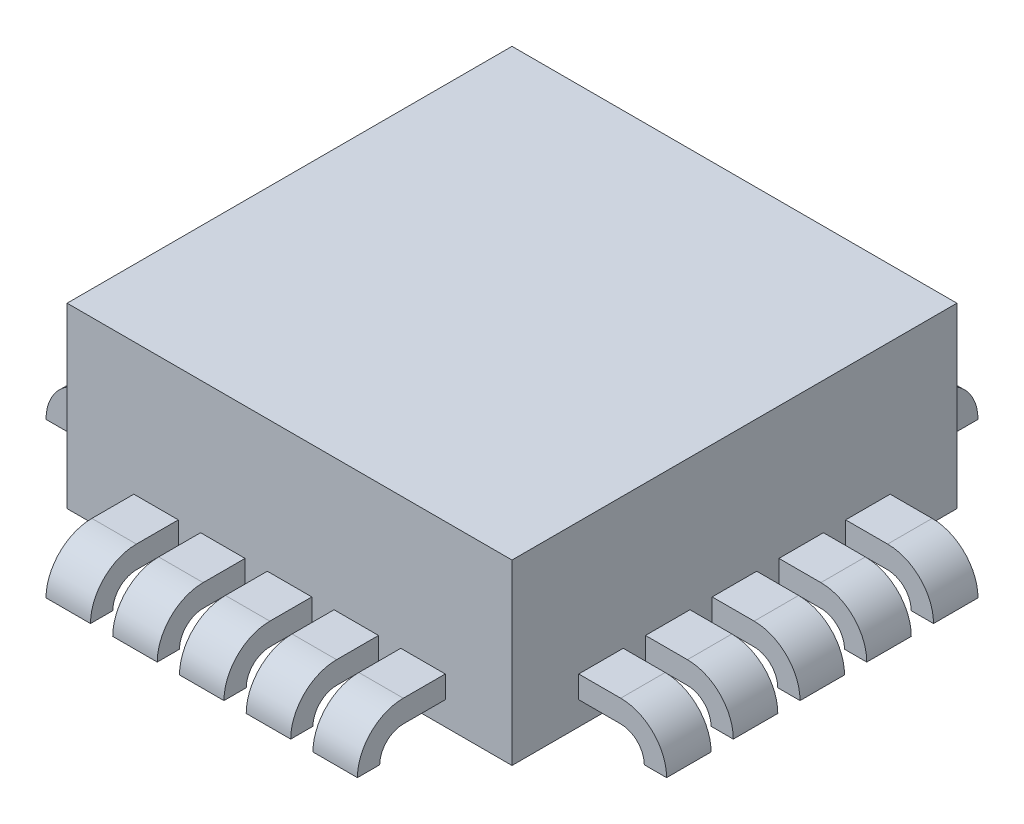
ISO-10303-21;
HEADER;
FILE_DESCRIPTION(('STEP AP214'),'2;1');
FILE_NAME('part.step','',(''),(''),'','','');
FILE_SCHEMA(('AUTOMOTIVE_DESIGN { 1 0 10303 214 1 1 1 1 }'));
ENDSEC;
DATA;
#1=APPLICATION_CONTEXT('core data for automotive mechanical design processes');
#2=APPLICATION_PROTOCOL_DEFINITION('international standard','automotive_design',2000,#1);
#3=PRODUCT_CONTEXT('',#1,'mechanical');
#4=PRODUCT('Part','Part','',(#3));
#5=PRODUCT_RELATED_PRODUCT_CATEGORY('part','',(#4));
#6=PRODUCT_DEFINITION_FORMATION('','',#4);
#7=PRODUCT_DEFINITION_CONTEXT('part definition',#1,'design');
#8=PRODUCT_DEFINITION('design','',#6,#7);
#9=PRODUCT_DEFINITION_SHAPE('','',#8);
#10=(LENGTH_UNIT() NAMED_UNIT(*) SI_UNIT(.MILLI.,.METRE.));
#11=(NAMED_UNIT(*) PLANE_ANGLE_UNIT() SI_UNIT($,.RADIAN.));
#12=(NAMED_UNIT(*) SI_UNIT($,.STERADIAN.) SOLID_ANGLE_UNIT());
#13=UNCERTAINTY_MEASURE_WITH_UNIT(LENGTH_MEASURE(1.E-05),#10,'distance_accuracy_value','');
#14=(GEOMETRIC_REPRESENTATION_CONTEXT(3) GLOBAL_UNCERTAINTY_ASSIGNED_CONTEXT((#13)) GLOBAL_UNIT_ASSIGNED_CONTEXT((#10,
#11,#12)) REPRESENTATION_CONTEXT('',''));
#15=CARTESIAN_POINT('',(0.,0.,0.));
#16=DIRECTION('',(0.,0.,1.));
#17=DIRECTION('',(1.,0.,0.));
#18=AXIS2_PLACEMENT_3D('',#15,#16,#17);
#19=CARTESIAN_POINT('',(0.3,8.61546986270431E-05,1.18857021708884));
#20=DIRECTION('',(1.,0.,0.));
#21=DIRECTION('',(0.,0.,-1.));
#22=AXIS2_PLACEMENT_3D('',#19,#20,#21);
#23=CYLINDRICAL_SURFACE('',#22,0.206319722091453);
#24=DIRECTION('',(1.,0.,0.));
#25=VECTOR('',#24,1.);
#26=CARTESIAN_POINT('',(0.3,0.20640587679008,1.18857021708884));
#27=LINE('',#26,#25);
#28=CARTESIAN_POINT('',(0.2,0.20640587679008,1.18857021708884));
#29=VERTEX_POINT('',#28);
#30=CARTESIAN_POINT('',(0.4,0.20640587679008,1.18857021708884));
#31=VERTEX_POINT('',#30);
#32=EDGE_CURVE('E769',#29,#31,#27,.T.);
#33=ORIENTED_EDGE('',*,*,#32,.F.);
#34=CARTESIAN_POINT('',(0.2,8.61546986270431E-05,1.18857021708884));
#35=DIRECTION('',(1.,0.,0.));
#36=DIRECTION('',(0.,0.,-1.));
#37=AXIS2_PLACEMENT_3D('',#34,#35,#36);
#38=CIRCLE('',#37,0.206319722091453);
#39=CARTESIAN_POINT('',(0.2,8.61454510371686E-05,1.39488993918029));
#40=VERTEX_POINT('',#39);
#41=EDGE_CURVE('E19',#29,#40,#38,.T.);
#42=ORIENTED_EDGE('',*,*,#41,.T.);
#43=DIRECTION('',(1.,0.,0.));
#44=VECTOR('',#43,1.);
#45=CARTESIAN_POINT('',(0.3,8.61454510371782E-05,1.39488993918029));
#46=LINE('',#45,#44);
#47=CARTESIAN_POINT('',(0.4,8.61454510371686E-05,1.39488993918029));
#48=VERTEX_POINT('',#47);
#49=EDGE_CURVE('E2067',#48,#40,#46,.F.);
#50=ORIENTED_EDGE('',*,*,#49,.F.);
#51=CARTESIAN_POINT('',(0.4,8.61546986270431E-05,1.18857021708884));
#52=DIRECTION('',(1.,0.,0.));
#53=DIRECTION('',(0.,0.,-1.));
#54=AXIS2_PLACEMENT_3D('',#51,#52,#53);
#55=CIRCLE('',#54,0.206319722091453);
#56=EDGE_CURVE('E773',#31,#48,#55,.T.);
#57=ORIENTED_EDGE('',*,*,#56,.F.);
#58=EDGE_LOOP('',(#33,#42,#50,#57));
#59=FACE_BOUND('',#58,.T.);
#60=ADVANCED_FACE('F15',(#59),#23,.T.);
#61=CARTESIAN_POINT('',(0.3,8.61454510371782E-05,1.39488993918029));
#62=DIRECTION('',(0.,-1.,0.));
#63=DIRECTION('',(0.,0.,-1.));
#64=AXIS2_PLACEMENT_3D('',#61,#62,#63);
#65=PLANE('',#64);
#66=ORIENTED_EDGE('',*,*,#49,.T.);
#67=DIRECTION('',(0.,0.,-1.));
#68=VECTOR('',#67,1.);
#69=CARTESIAN_POINT('',(0.2,8.6145451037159E-05,1.19023023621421));
#70=LINE('',#69,#68);
#71=CARTESIAN_POINT('',(0.2,8.61454510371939E-05,1.29468195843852));
#72=VERTEX_POINT('',#71);
#73=EDGE_CURVE('E785',#40,#72,#70,.T.);
#74=ORIENTED_EDGE('',*,*,#73,.T.);
#75=DIRECTION('',(1.,0.,0.));
#76=VECTOR('',#75,1.);
#77=CARTESIAN_POINT('',(0.3,8.61454510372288E-05,1.29468195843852));
#78=LINE('',#77,#76);
#79=CARTESIAN_POINT('',(0.4,8.61454510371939E-05,1.29468195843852));
#80=VERTEX_POINT('',#79);
#81=EDGE_CURVE('E2033',#72,#80,#78,.T.);
#82=ORIENTED_EDGE('',*,*,#81,.T.);
#83=DIRECTION('',(0.,0.,-1.));
#84=VECTOR('',#83,1.);
#85=CARTESIAN_POINT('',(0.4,8.6145451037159E-05,1.19023023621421));
#86=LINE('',#85,#84);
#87=EDGE_CURVE('E1108',#48,#80,#86,.T.);
#88=ORIENTED_EDGE('',*,*,#87,.F.);
#89=EDGE_LOOP('',(#66,#74,#82,#88));
#90=FACE_BOUND('',#89,.T.);
#91=ADVANCED_FACE('F2080',(#90),#65,.T.);
#92=CARTESIAN_POINT('',(0.3,8.61546986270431E-05,1.18857021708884));
#93=DIRECTION('',(1.,0.,0.));
#94=DIRECTION('',(0.,0.,-1.));
#95=AXIS2_PLACEMENT_3D('',#92,#93,#94);
#96=CYLINDRICAL_SURFACE('',#95,0.106111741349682);
#97=CARTESIAN_POINT('',(0.4,8.61546986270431E-05,1.18857021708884));
#98=DIRECTION('',(1.,0.,0.));
#99=DIRECTION('',(0.,0.,-1.));
#100=AXIS2_PLACEMENT_3D('',#97,#98,#99);
#101=CIRCLE('',#100,0.106111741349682);
#102=CARTESIAN_POINT('',(0.4,0.106197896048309,1.18857021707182));
#103=VERTEX_POINT('',#102);
#104=EDGE_CURVE('E1105',#80,#103,#101,.F.);
#105=ORIENTED_EDGE('',*,*,#104,.F.);
#106=ORIENTED_EDGE('',*,*,#81,.F.);
#107=CARTESIAN_POINT('',(0.2,8.61546986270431E-05,1.18857021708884));
#108=DIRECTION('',(1.,0.,0.));
#109=DIRECTION('',(0.,0.,-1.));
#110=AXIS2_PLACEMENT_3D('',#107,#108,#109);
#111=CIRCLE('',#110,0.106111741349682);
#112=CARTESIAN_POINT('',(0.2,0.106197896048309,1.18857021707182));
#113=VERTEX_POINT('',#112);
#114=EDGE_CURVE('E778',#72,#113,#111,.F.);
#115=ORIENTED_EDGE('',*,*,#114,.T.);
#116=DIRECTION('',(1.,0.,0.));
#117=VECTOR('',#116,1.);
#118=CARTESIAN_POINT('',(0.3,0.106197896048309,1.1885702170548));
#119=LINE('',#118,#117);
#120=EDGE_CURVE('E2043',#103,#113,#119,.F.);
#121=ORIENTED_EDGE('',*,*,#120,.F.);
#122=EDGE_LOOP('',(#105,#106,#115,#121));
#123=FACE_BOUND('',#122,.T.);
#124=ADVANCED_FACE('F2076',(#123),#96,.F.);
#125=CARTESIAN_POINT('',(-0.3,8.61546986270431E-05,1.18857021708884));
#126=DIRECTION('',(1.,0.,0.));
#127=DIRECTION('',(0.,0.,-1.));
#128=AXIS2_PLACEMENT_3D('',#125,#126,#127);
#129=CYLINDRICAL_SURFACE('',#128,0.206319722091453);
#130=DIRECTION('',(1.,0.,0.));
#131=VECTOR('',#130,1.);
#132=CARTESIAN_POINT('',(-0.3,0.20640587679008,1.18857021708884));
#133=LINE('',#132,#131);
#134=CARTESIAN_POINT('',(-0.4,0.20640587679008,1.18857021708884));
#135=VERTEX_POINT('',#134);
#136=CARTESIAN_POINT('',(-0.2,0.20640587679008,1.18857021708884));
#137=VERTEX_POINT('',#136);
#138=EDGE_CURVE('E1100',#135,#137,#133,.T.);
#139=ORIENTED_EDGE('',*,*,#138,.F.);
#140=CARTESIAN_POINT('',(-0.4,8.61546986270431E-05,1.18857021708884));
#141=DIRECTION('',(1.,0.,0.));
#142=DIRECTION('',(0.,0.,-1.));
#143=AXIS2_PLACEMENT_3D('',#140,#141,#142);
#144=CIRCLE('',#143,0.206319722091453);
#145=CARTESIAN_POINT('',(-0.4,8.61454510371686E-05,1.39488993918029));
#146=VERTEX_POINT('',#145);
#147=EDGE_CURVE('E1102',#135,#146,#144,.T.);
#148=ORIENTED_EDGE('',*,*,#147,.T.);
#149=DIRECTION('',(1.,0.,0.));
#150=VECTOR('',#149,1.);
#151=CARTESIAN_POINT('',(-0.3,8.61454510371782E-05,1.39488993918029));
#152=LINE('',#151,#150);
#153=CARTESIAN_POINT('',(-0.2,8.61454510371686E-05,1.39488993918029));
#154=VERTEX_POINT('',#153);
#155=EDGE_CURVE('E2030',#154,#146,#152,.F.);
#156=ORIENTED_EDGE('',*,*,#155,.F.);
#157=CARTESIAN_POINT('',(-0.2,8.61546986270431E-05,1.18857021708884));
#158=DIRECTION('',(1.,0.,0.));
#159=DIRECTION('',(0.,0.,-1.));
#160=AXIS2_PLACEMENT_3D('',#157,#158,#159);
#161=CIRCLE('',#160,0.206319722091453);
#162=EDGE_CURVE('E1094',#137,#154,#161,.T.);
#163=ORIENTED_EDGE('',*,*,#162,.F.);
#164=EDGE_LOOP('',(#139,#148,#156,#163));
#165=FACE_BOUND('',#164,.T.);
#166=ADVANCED_FACE('F2088',(#165),#129,.T.);
#167=CARTESIAN_POINT('',(-0.3,8.61454510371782E-05,1.39488993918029));
#168=DIRECTION('',(0.,-1.,0.));
#169=DIRECTION('',(0.,0.,-1.));
#170=AXIS2_PLACEMENT_3D('',#167,#168,#169);
#171=PLANE('',#170);
#172=ORIENTED_EDGE('',*,*,#155,.T.);
#173=DIRECTION('',(0.,0.,-1.));
#174=VECTOR('',#173,1.);
#175=CARTESIAN_POINT('',(-0.4,8.6145451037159E-05,1.19023023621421));
#176=LINE('',#175,#174);
#177=CARTESIAN_POINT('',(-0.4,8.61454510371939E-05,1.29468195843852));
#178=VERTEX_POINT('',#177);
#179=EDGE_CURVE('E1101',#146,#178,#176,.T.);
#180=ORIENTED_EDGE('',*,*,#179,.T.);
#181=DIRECTION('',(1.,0.,0.));
#182=VECTOR('',#181,1.);
#183=CARTESIAN_POINT('',(-0.3,8.61454510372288E-05,1.29468195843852));
#184=LINE('',#183,#182);
#185=CARTESIAN_POINT('',(-0.2,8.61454510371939E-05,1.29468195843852));
#186=VERTEX_POINT('',#185);
#187=EDGE_CURVE('E1992',#178,#186,#184,.T.);
#188=ORIENTED_EDGE('',*,*,#187,.T.);
#189=DIRECTION('',(0.,0.,-1.));
#190=VECTOR('',#189,1.);
#191=CARTESIAN_POINT('',(-0.2,8.6145451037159E-05,1.19023023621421));
#192=LINE('',#191,#190);
#193=EDGE_CURVE('E1093',#154,#186,#192,.T.);
#194=ORIENTED_EDGE('',*,*,#193,.F.);
#195=EDGE_LOOP('',(#172,#180,#188,#194));
#196=FACE_BOUND('',#195,.T.);
#197=ADVANCED_FACE('F3307',(#196),#171,.T.);
#198=CARTESIAN_POINT('',(-0.3,8.61546986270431E-05,1.18857021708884));
#199=DIRECTION('',(1.,0.,0.));
#200=DIRECTION('',(0.,0.,-1.));
#201=AXIS2_PLACEMENT_3D('',#198,#199,#200);
#202=CYLINDRICAL_SURFACE('',#201,0.106111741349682);
#203=CARTESIAN_POINT('',(-0.2,8.61546986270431E-05,1.18857021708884));
#204=DIRECTION('',(1.,0.,0.));
#205=DIRECTION('',(0.,0.,-1.));
#206=AXIS2_PLACEMENT_3D('',#203,#204,#205);
#207=CIRCLE('',#206,0.106111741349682);
#208=CARTESIAN_POINT('',(-0.2,0.106197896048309,1.18857021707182));
#209=VERTEX_POINT('',#208);
#210=EDGE_CURVE('E1090',#186,#209,#207,.F.);
#211=ORIENTED_EDGE('',*,*,#210,.F.);
#212=ORIENTED_EDGE('',*,*,#187,.F.);
#213=CARTESIAN_POINT('',(-0.4,8.61546986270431E-05,1.18857021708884));
#214=DIRECTION('',(1.,0.,0.));
#215=DIRECTION('',(0.,0.,-1.));
#216=AXIS2_PLACEMENT_3D('',#213,#214,#215);
#217=CIRCLE('',#216,0.106111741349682);
#218=CARTESIAN_POINT('',(-0.4,0.106197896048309,1.18857021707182));
#219=VERTEX_POINT('',#218);
#220=EDGE_CURVE('E1098',#178,#219,#217,.F.);
#221=ORIENTED_EDGE('',*,*,#220,.T.);
#222=DIRECTION('',(1.,0.,0.));
#223=VECTOR('',#222,1.);
#224=CARTESIAN_POINT('',(-0.3,0.106197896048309,1.1885702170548));
#225=LINE('',#224,#223);
#226=EDGE_CURVE('E2002',#209,#219,#225,.F.);
#227=ORIENTED_EDGE('',*,*,#226,.F.);
#228=EDGE_LOOP('',(#211,#212,#221,#227));
#229=FACE_BOUND('',#228,.T.);
#230=ADVANCED_FACE('F3299',(#229),#202,.F.);
#231=CARTESIAN_POINT('',(-0.6,8.61546986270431E-05,1.18857021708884));
#232=DIRECTION('',(1.,0.,0.));
#233=DIRECTION('',(0.,0.,-1.));
#234=AXIS2_PLACEMENT_3D('',#231,#232,#233);
#235=CYLINDRICAL_SURFACE('',#234,0.206319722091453);
#236=DIRECTION('',(1.,0.,0.));
#237=VECTOR('',#236,1.);
#238=CARTESIAN_POINT('',(-0.6,0.20640587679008,1.18857021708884));
#239=LINE('',#238,#237);
#240=CARTESIAN_POINT('',(-0.7,0.20640587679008,1.18857021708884));
#241=VERTEX_POINT('',#240);
#242=CARTESIAN_POINT('',(-0.5,0.20640587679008,1.18857021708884));
#243=VERTEX_POINT('',#242);
#244=EDGE_CURVE('E1085',#241,#243,#239,.T.);
#245=ORIENTED_EDGE('',*,*,#244,.F.);
#246=CARTESIAN_POINT('',(-0.7,8.61546986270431E-05,1.18857021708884));
#247=DIRECTION('',(1.,0.,0.));
#248=DIRECTION('',(0.,0.,-1.));
#249=AXIS2_PLACEMENT_3D('',#246,#247,#248);
#250=CIRCLE('',#249,0.206319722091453);
#251=CARTESIAN_POINT('',(-0.7,8.61454510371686E-05,1.39488993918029));
#252=VERTEX_POINT('',#251);
#253=EDGE_CURVE('E1087',#241,#252,#250,.T.);
#254=ORIENTED_EDGE('',*,*,#253,.T.);
#255=DIRECTION('',(1.,0.,0.));
#256=VECTOR('',#255,1.);
#257=CARTESIAN_POINT('',(-0.6,8.61454510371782E-05,1.39488993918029));
#258=LINE('',#257,#256);
#259=CARTESIAN_POINT('',(-0.5,8.61454510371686E-05,1.39488993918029));
#260=VERTEX_POINT('',#259);
#261=EDGE_CURVE('E1989',#260,#252,#258,.F.);
#262=ORIENTED_EDGE('',*,*,#261,.F.);
#263=CARTESIAN_POINT('',(-0.5,8.61546986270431E-05,1.18857021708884));
#264=DIRECTION('',(1.,0.,0.));
#265=DIRECTION('',(0.,0.,-1.));
#266=AXIS2_PLACEMENT_3D('',#263,#264,#265);
#267=CIRCLE('',#266,0.206319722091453);
#268=EDGE_CURVE('E1079',#243,#260,#267,.T.);
#269=ORIENTED_EDGE('',*,*,#268,.F.);
#270=EDGE_LOOP('',(#245,#254,#262,#269));
#271=FACE_BOUND('',#270,.T.);
#272=ADVANCED_FACE('F3291',(#271),#235,.T.);
#273=CARTESIAN_POINT('',(-0.6,8.61454510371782E-05,1.39488993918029));
#274=DIRECTION('',(0.,-1.,0.));
#275=DIRECTION('',(0.,0.,-1.));
#276=AXIS2_PLACEMENT_3D('',#273,#274,#275);
#277=PLANE('',#276);
#278=ORIENTED_EDGE('',*,*,#261,.T.);
#279=DIRECTION('',(0.,0.,-1.));
#280=VECTOR('',#279,1.);
#281=CARTESIAN_POINT('',(-0.7,8.6145451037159E-05,1.19023023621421));
#282=LINE('',#281,#280);
#283=CARTESIAN_POINT('',(-0.7,8.61454510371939E-05,1.29468195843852));
#284=VERTEX_POINT('',#283);
#285=EDGE_CURVE('E1086',#252,#284,#282,.T.);
#286=ORIENTED_EDGE('',*,*,#285,.T.);
#287=DIRECTION('',(1.,0.,0.));
#288=VECTOR('',#287,1.);
#289=CARTESIAN_POINT('',(-0.6,8.61454510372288E-05,1.29468195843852));
#290=LINE('',#289,#288);
#291=CARTESIAN_POINT('',(-0.5,8.61454510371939E-05,1.29468195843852));
#292=VERTEX_POINT('',#291);
#293=EDGE_CURVE('E1951',#284,#292,#290,.T.);
#294=ORIENTED_EDGE('',*,*,#293,.T.);
#295=DIRECTION('',(0.,0.,-1.));
#296=VECTOR('',#295,1.);
#297=CARTESIAN_POINT('',(-0.5,8.6145451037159E-05,1.19023023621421));
#298=LINE('',#297,#296);
#299=EDGE_CURVE('E1078',#260,#292,#298,.T.);
#300=ORIENTED_EDGE('',*,*,#299,.F.);
#301=EDGE_LOOP('',(#278,#286,#294,#300));
#302=FACE_BOUND('',#301,.T.);
#303=ADVANCED_FACE('F3283',(#302),#277,.T.);
#304=CARTESIAN_POINT('',(-0.6,8.61546986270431E-05,1.18857021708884));
#305=DIRECTION('',(1.,0.,0.));
#306=DIRECTION('',(0.,0.,-1.));
#307=AXIS2_PLACEMENT_3D('',#304,#305,#306);
#308=CYLINDRICAL_SURFACE('',#307,0.106111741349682);
#309=CARTESIAN_POINT('',(-0.5,8.61546986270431E-05,1.18857021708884));
#310=DIRECTION('',(1.,0.,0.));
#311=DIRECTION('',(0.,0.,-1.));
#312=AXIS2_PLACEMENT_3D('',#309,#310,#311);
#313=CIRCLE('',#312,0.106111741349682);
#314=CARTESIAN_POINT('',(-0.5,0.106197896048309,1.18857021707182));
#315=VERTEX_POINT('',#314);
#316=EDGE_CURVE('E1075',#292,#315,#313,.F.);
#317=ORIENTED_EDGE('',*,*,#316,.F.);
#318=ORIENTED_EDGE('',*,*,#293,.F.);
#319=CARTESIAN_POINT('',(-0.7,8.61546986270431E-05,1.18857021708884));
#320=DIRECTION('',(1.,0.,0.));
#321=DIRECTION('',(0.,0.,-1.));
#322=AXIS2_PLACEMENT_3D('',#319,#320,#321);
#323=CIRCLE('',#322,0.106111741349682);
#324=CARTESIAN_POINT('',(-0.7,0.106197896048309,1.18857021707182));
#325=VERTEX_POINT('',#324);
#326=EDGE_CURVE('E1083',#284,#325,#323,.F.);
#327=ORIENTED_EDGE('',*,*,#326,.T.);
#328=DIRECTION('',(1.,0.,0.));
#329=VECTOR('',#328,1.);
#330=CARTESIAN_POINT('',(-0.6,0.106197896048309,1.1885702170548));
#331=LINE('',#330,#329);
#332=EDGE_CURVE('E1961',#315,#325,#331,.F.);
#333=ORIENTED_EDGE('',*,*,#332,.F.);
#334=EDGE_LOOP('',(#317,#318,#327,#333));
#335=FACE_BOUND('',#334,.T.);
#336=ADVANCED_FACE('F3275',(#335),#308,.F.);
#337=CARTESIAN_POINT('',(0.6,8.61546986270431E-05,1.18857021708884));
#338=DIRECTION('',(1.,0.,0.));
#339=DIRECTION('',(0.,0.,-1.));
#340=AXIS2_PLACEMENT_3D('',#337,#338,#339);
#341=CYLINDRICAL_SURFACE('',#340,0.206319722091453);
#342=DIRECTION('',(1.,0.,0.));
#343=VECTOR('',#342,1.);
#344=CARTESIAN_POINT('',(0.6,0.20640587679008,1.18857021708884));
#345=LINE('',#344,#343);
#346=CARTESIAN_POINT('',(0.5,0.20640587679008,1.18857021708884));
#347=VERTEX_POINT('',#346);
#348=CARTESIAN_POINT('',(0.7,0.20640587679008,1.18857021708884));
#349=VERTEX_POINT('',#348);
#350=EDGE_CURVE('E1070',#347,#349,#345,.T.);
#351=ORIENTED_EDGE('',*,*,#350,.F.);
#352=CARTESIAN_POINT('',(0.5,8.61546986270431E-05,1.18857021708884));
#353=DIRECTION('',(1.,0.,0.));
#354=DIRECTION('',(0.,0.,-1.));
#355=AXIS2_PLACEMENT_3D('',#352,#353,#354);
#356=CIRCLE('',#355,0.206319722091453);
#357=CARTESIAN_POINT('',(0.5,8.61454510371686E-05,1.39488993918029));
#358=VERTEX_POINT('',#357);
#359=EDGE_CURVE('E1072',#347,#358,#356,.T.);
#360=ORIENTED_EDGE('',*,*,#359,.T.);
#361=DIRECTION('',(1.,0.,0.));
#362=VECTOR('',#361,1.);
#363=CARTESIAN_POINT('',(0.6,8.61454510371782E-05,1.39488993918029));
#364=LINE('',#363,#362);
#365=CARTESIAN_POINT('',(0.7,8.61454510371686E-05,1.39488993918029));
#366=VERTEX_POINT('',#365);
#367=EDGE_CURVE('E1948',#366,#358,#364,.F.);
#368=ORIENTED_EDGE('',*,*,#367,.F.);
#369=CARTESIAN_POINT('',(0.7,8.61546986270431E-05,1.18857021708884));
#370=DIRECTION('',(1.,0.,0.));
#371=DIRECTION('',(0.,0.,-1.));
#372=AXIS2_PLACEMENT_3D('',#369,#370,#371);
#373=CIRCLE('',#372,0.206319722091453);
#374=EDGE_CURVE('E1064',#349,#366,#373,.T.);
#375=ORIENTED_EDGE('',*,*,#374,.F.);
#376=EDGE_LOOP('',(#351,#360,#368,#375));
#377=FACE_BOUND('',#376,.T.);
#378=ADVANCED_FACE('F3267',(#377),#341,.T.);
#379=CARTESIAN_POINT('',(0.6,8.61454510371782E-05,1.39488993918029));
#380=DIRECTION('',(0.,-1.,0.));
#381=DIRECTION('',(0.,0.,-1.));
#382=AXIS2_PLACEMENT_3D('',#379,#380,#381);
#383=PLANE('',#382);
#384=ORIENTED_EDGE('',*,*,#367,.T.);
#385=DIRECTION('',(0.,0.,-1.));
#386=VECTOR('',#385,1.);
#387=CARTESIAN_POINT('',(0.5,8.6145451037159E-05,1.19023023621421));
#388=LINE('',#387,#386);
#389=CARTESIAN_POINT('',(0.5,8.61454510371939E-05,1.29468195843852));
#390=VERTEX_POINT('',#389);
#391=EDGE_CURVE('E1071',#358,#390,#388,.T.);
#392=ORIENTED_EDGE('',*,*,#391,.T.);
#393=DIRECTION('',(1.,0.,0.));
#394=VECTOR('',#393,1.);
#395=CARTESIAN_POINT('',(0.6,8.61454510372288E-05,1.29468195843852));
#396=LINE('',#395,#394);
#397=CARTESIAN_POINT('',(0.7,8.61454510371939E-05,1.29468195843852));
#398=VERTEX_POINT('',#397);
#399=EDGE_CURVE('E1910',#390,#398,#396,.T.);
#400=ORIENTED_EDGE('',*,*,#399,.T.);
#401=DIRECTION('',(0.,0.,-1.));
#402=VECTOR('',#401,1.);
#403=CARTESIAN_POINT('',(0.7,8.6145451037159E-05,1.19023023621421));
#404=LINE('',#403,#402);
#405=EDGE_CURVE('E1063',#366,#398,#404,.T.);
#406=ORIENTED_EDGE('',*,*,#405,.F.);
#407=EDGE_LOOP('',(#384,#392,#400,#406));
#408=FACE_BOUND('',#407,.T.);
#409=ADVANCED_FACE('F3259',(#408),#383,.T.);
#410=CARTESIAN_POINT('',(0.6,8.61546986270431E-05,1.18857021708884));
#411=DIRECTION('',(1.,0.,0.));
#412=DIRECTION('',(0.,0.,-1.));
#413=AXIS2_PLACEMENT_3D('',#410,#411,#412);
#414=CYLINDRICAL_SURFACE('',#413,0.106111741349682);
#415=CARTESIAN_POINT('',(0.7,8.61546986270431E-05,1.18857021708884));
#416=DIRECTION('',(1.,0.,0.));
#417=DIRECTION('',(0.,0.,-1.));
#418=AXIS2_PLACEMENT_3D('',#415,#416,#417);
#419=CIRCLE('',#418,0.106111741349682);
#420=CARTESIAN_POINT('',(0.7,0.106197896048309,1.18857021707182));
#421=VERTEX_POINT('',#420);
#422=EDGE_CURVE('E1060',#398,#421,#419,.F.);
#423=ORIENTED_EDGE('',*,*,#422,.F.);
#424=ORIENTED_EDGE('',*,*,#399,.F.);
#425=CARTESIAN_POINT('',(0.5,8.61546986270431E-05,1.18857021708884));
#426=DIRECTION('',(1.,0.,0.));
#427=DIRECTION('',(0.,0.,-1.));
#428=AXIS2_PLACEMENT_3D('',#425,#426,#427);
#429=CIRCLE('',#428,0.106111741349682);
#430=CARTESIAN_POINT('',(0.5,0.106197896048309,1.18857021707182));
#431=VERTEX_POINT('',#430);
#432=EDGE_CURVE('E1068',#390,#431,#429,.F.);
#433=ORIENTED_EDGE('',*,*,#432,.T.);
#434=DIRECTION('',(1.,0.,0.));
#435=VECTOR('',#434,1.);
#436=CARTESIAN_POINT('',(0.6,0.106197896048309,1.1885702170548));
#437=LINE('',#436,#435);
#438=EDGE_CURVE('E1920',#421,#431,#437,.F.);
#439=ORIENTED_EDGE('',*,*,#438,.F.);
#440=EDGE_LOOP('',(#423,#424,#433,#439));
#441=FACE_BOUND('',#440,.T.);
#442=ADVANCED_FACE('F3251',(#441),#414,.F.);
#443=CARTESIAN_POINT('',(0.,8.61546986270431E-05,1.18857021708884));
#444=DIRECTION('',(1.,0.,0.));
#445=DIRECTION('',(0.,0.,-1.));
#446=AXIS2_PLACEMENT_3D('',#443,#444,#445);
#447=CYLINDRICAL_SURFACE('',#446,0.206319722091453);
#448=DIRECTION('',(1.,0.,0.));
#449=VECTOR('',#448,1.);
#450=CARTESIAN_POINT('',(0.,0.20640587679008,1.18857021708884));
#451=LINE('',#450,#449);
#452=CARTESIAN_POINT('',(-0.1,0.20640587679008,1.18857021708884));
#453=VERTEX_POINT('',#452);
#454=CARTESIAN_POINT('',(0.1,0.20640587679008,1.18857021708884));
#455=VERTEX_POINT('',#454);
#456=EDGE_CURVE('E1055',#453,#455,#451,.T.);
#457=ORIENTED_EDGE('',*,*,#456,.F.);
#458=CARTESIAN_POINT('',(-0.1,8.61546986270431E-05,1.18857021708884));
#459=DIRECTION('',(1.,0.,0.));
#460=DIRECTION('',(0.,0.,-1.));
#461=AXIS2_PLACEMENT_3D('',#458,#459,#460);
#462=CIRCLE('',#461,0.206319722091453);
#463=CARTESIAN_POINT('',(-0.1,8.61454510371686E-05,1.39488993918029));
#464=VERTEX_POINT('',#463);
#465=EDGE_CURVE('E1057',#453,#464,#462,.T.);
#466=ORIENTED_EDGE('',*,*,#465,.T.);
#467=DIRECTION('',(1.,0.,0.));
#468=VECTOR('',#467,1.);
#469=CARTESIAN_POINT('',(0.,8.61454510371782E-05,1.39488993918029));
#470=LINE('',#469,#468);
#471=CARTESIAN_POINT('',(0.1,8.61454510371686E-05,1.39488993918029));
#472=VERTEX_POINT('',#471);
#473=EDGE_CURVE('E1907',#472,#464,#470,.F.);
#474=ORIENTED_EDGE('',*,*,#473,.F.);
#475=CARTESIAN_POINT('',(0.1,8.61546986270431E-05,1.18857021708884));
#476=DIRECTION('',(1.,0.,0.));
#477=DIRECTION('',(0.,0.,-1.));
#478=AXIS2_PLACEMENT_3D('',#475,#476,#477);
#479=CIRCLE('',#478,0.206319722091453);
#480=EDGE_CURVE('E1049',#455,#472,#479,.T.);
#481=ORIENTED_EDGE('',*,*,#480,.F.);
#482=EDGE_LOOP('',(#457,#466,#474,#481));
#483=FACE_BOUND('',#482,.T.);
#484=ADVANCED_FACE('F3243',(#483),#447,.T.);
#485=CARTESIAN_POINT('',(0.,8.61454510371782E-05,1.39488993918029));
#486=DIRECTION('',(0.,-1.,0.));
#487=DIRECTION('',(0.,0.,-1.));
#488=AXIS2_PLACEMENT_3D('',#485,#486,#487);
#489=PLANE('',#488);
#490=ORIENTED_EDGE('',*,*,#473,.T.);
#491=DIRECTION('',(0.,0.,-1.));
#492=VECTOR('',#491,1.);
#493=CARTESIAN_POINT('',(-0.1,8.6145451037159E-05,1.19023023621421));
#494=LINE('',#493,#492);
#495=CARTESIAN_POINT('',(-0.1,8.61454510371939E-05,1.29468195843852));
#496=VERTEX_POINT('',#495);
#497=EDGE_CURVE('E1056',#464,#496,#494,.T.);
#498=ORIENTED_EDGE('',*,*,#497,.T.);
#499=DIRECTION('',(1.,0.,0.));
#500=VECTOR('',#499,1.);
#501=CARTESIAN_POINT('',(0.,8.61454510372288E-05,1.29468195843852));
#502=LINE('',#501,#500);
#503=CARTESIAN_POINT('',(0.1,8.61454510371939E-05,1.29468195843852));
#504=VERTEX_POINT('',#503);
#505=EDGE_CURVE('E1874',#496,#504,#502,.T.);
#506=ORIENTED_EDGE('',*,*,#505,.T.);
#507=DIRECTION('',(0.,0.,-1.));
#508=VECTOR('',#507,1.);
#509=CARTESIAN_POINT('',(0.1,8.6145451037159E-05,1.19023023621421));
#510=LINE('',#509,#508);
#511=EDGE_CURVE('E1048',#472,#504,#510,.T.);
#512=ORIENTED_EDGE('',*,*,#511,.F.);
#513=EDGE_LOOP('',(#490,#498,#506,#512));
#514=FACE_BOUND('',#513,.T.);
#515=ADVANCED_FACE('F3235',(#514),#489,.T.);
#516=CARTESIAN_POINT('',(0.,8.61546986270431E-05,1.18857021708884));
#517=DIRECTION('',(1.,0.,0.));
#518=DIRECTION('',(0.,0.,-1.));
#519=AXIS2_PLACEMENT_3D('',#516,#517,#518);
#520=CYLINDRICAL_SURFACE('',#519,0.106111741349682);
#521=CARTESIAN_POINT('',(0.1,8.61546986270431E-05,1.18857021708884));
#522=DIRECTION('',(1.,0.,0.));
#523=DIRECTION('',(0.,0.,-1.));
#524=AXIS2_PLACEMENT_3D('',#521,#522,#523);
#525=CIRCLE('',#524,0.106111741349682);
#526=CARTESIAN_POINT('',(0.1,0.106197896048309,1.18857021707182));
#527=VERTEX_POINT('',#526);
#528=EDGE_CURVE('E1045',#504,#527,#525,.F.);
#529=ORIENTED_EDGE('',*,*,#528,.F.);
#530=ORIENTED_EDGE('',*,*,#505,.F.);
#531=CARTESIAN_POINT('',(-0.1,8.61546986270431E-05,1.18857021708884));
#532=DIRECTION('',(1.,0.,0.));
#533=DIRECTION('',(0.,0.,-1.));
#534=AXIS2_PLACEMENT_3D('',#531,#532,#533);
#535=CIRCLE('',#534,0.106111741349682);
#536=CARTESIAN_POINT('',(-0.1,0.106197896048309,1.18857021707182));
#537=VERTEX_POINT('',#536);
#538=EDGE_CURVE('E1053',#496,#537,#535,.F.);
#539=ORIENTED_EDGE('',*,*,#538,.T.);
#540=DIRECTION('',(1.,0.,0.));
#541=VECTOR('',#540,1.);
#542=CARTESIAN_POINT('',(0.,0.106197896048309,1.1885702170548));
#543=LINE('',#542,#541);
#544=EDGE_CURVE('E1879',#527,#537,#543,.F.);
#545=ORIENTED_EDGE('',*,*,#544,.F.);
#546=EDGE_LOOP('',(#529,#530,#539,#545));
#547=FACE_BOUND('',#546,.T.);
#548=ADVANCED_FACE('F3227',(#547),#520,.F.);
#549=CARTESIAN_POINT('',(1.39488993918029,8.61454510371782E-05,0.3));
#550=DIRECTION('',(0.,1.,0.));
#551=DIRECTION('',(-1.,0.,0.));
#552=AXIS2_PLACEMENT_3D('',#549,#550,#551);
#553=PLANE('',#552);
#554=DIRECTION('',(-1.,0.,0.));
#555=VECTOR('',#554,1.);
#556=CARTESIAN_POINT('',(1.19023023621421,8.6145451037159E-05,0.2));
#557=LINE('',#556,#555);
#558=CARTESIAN_POINT('',(1.39488993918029,8.61454510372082E-05,0.2));
#559=VERTEX_POINT('',#558);
#560=CARTESIAN_POINT('',(1.29468195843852,8.61454510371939E-05,0.2));
#561=VERTEX_POINT('',#560);
#562=EDGE_CURVE('E1040',#559,#561,#557,.T.);
#563=ORIENTED_EDGE('',*,*,#562,.F.);
#564=DIRECTION('',(0.,0.,-1.));
#565=VECTOR('',#564,1.);
#566=CARTESIAN_POINT('',(1.39488993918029,8.61454510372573E-05,0.3));
#567=LINE('',#566,#565);
#568=CARTESIAN_POINT('',(1.39488993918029,8.61454510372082E-05,0.4));
#569=VERTEX_POINT('',#568);
#570=EDGE_CURVE('E1838',#569,#559,#567,.T.);
#571=ORIENTED_EDGE('',*,*,#570,.F.);
#572=DIRECTION('',(-1.,0.,0.));
#573=VECTOR('',#572,1.);
#574=CARTESIAN_POINT('',(1.19023023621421,8.6145451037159E-05,0.4));
#575=LINE('',#574,#573);
#576=CARTESIAN_POINT('',(1.29468195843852,8.61454510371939E-05,0.4));
#577=VERTEX_POINT('',#576);
#578=EDGE_CURVE('E1031',#569,#577,#575,.T.);
#579=ORIENTED_EDGE('',*,*,#578,.T.);
#580=DIRECTION('',(0.,0.,-1.));
#581=VECTOR('',#580,1.);
#582=CARTESIAN_POINT('',(1.29468195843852,8.61454510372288E-05,0.3));
#583=LINE('',#582,#581);
#584=EDGE_CURVE('E1872',#577,#561,#583,.T.);
#585=ORIENTED_EDGE('',*,*,#584,.T.);
#586=EDGE_LOOP('',(#563,#571,#579,#585));
#587=FACE_BOUND('',#586,.T.);
#588=ADVANCED_FACE('F3219',(#587),#553,.F.);
#589=CARTESIAN_POINT('',(1.18857021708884,8.61546986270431E-05,0.3));
#590=DIRECTION('',(0.,0.,-1.));
#591=DIRECTION('',(-1.,0.,0.));
#592=AXIS2_PLACEMENT_3D('',#589,#590,#591);
#593=CYLINDRICAL_SURFACE('',#592,0.106111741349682);
#594=CARTESIAN_POINT('',(1.18857021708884,8.61546986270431E-05,0.2));
#595=DIRECTION('',(0.,0.,-1.));
#596=DIRECTION('',(-1.,0.,0.));
#597=AXIS2_PLACEMENT_3D('',#594,#595,#596);
#598=CIRCLE('',#597,0.106111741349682);
#599=CARTESIAN_POINT('',(1.18857021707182,0.106197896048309,0.2));
#600=VERTEX_POINT('',#599);
#601=EDGE_CURVE('E1036',#561,#600,#598,.F.);
#602=ORIENTED_EDGE('',*,*,#601,.F.);
#603=ORIENTED_EDGE('',*,*,#584,.F.);
#604=CARTESIAN_POINT('',(1.18857021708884,8.61546986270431E-05,0.4));
#605=DIRECTION('',(0.,0.,-1.));
#606=DIRECTION('',(-1.,0.,0.));
#607=AXIS2_PLACEMENT_3D('',#604,#605,#606);
#608=CIRCLE('',#607,0.106111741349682);
#609=CARTESIAN_POINT('',(1.18857021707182,0.106197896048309,0.4));
#610=VERTEX_POINT('',#609);
#611=EDGE_CURVE('E1028',#577,#610,#608,.F.);
#612=ORIENTED_EDGE('',*,*,#611,.T.);
#613=DIRECTION('',(0.,0.,1.));
#614=VECTOR('',#613,1.);
#615=CARTESIAN_POINT('',(1.1885702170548,0.106197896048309,0.3));
#616=LINE('',#615,#614);
#617=EDGE_CURVE('E1039',#610,#600,#616,.F.);
#618=ORIENTED_EDGE('',*,*,#617,.T.);
#619=EDGE_LOOP('',(#602,#603,#612,#618));
#620=FACE_BOUND('',#619,.T.);
#621=ADVANCED_FACE('F3211',(#620),#593,.F.);
#622=CARTESIAN_POINT('',(1.18857021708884,8.61546986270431E-05,0.3));
#623=DIRECTION('',(0.,0.,-1.));
#624=DIRECTION('',(-1.,0.,0.));
#625=AXIS2_PLACEMENT_3D('',#622,#623,#624);
#626=CYLINDRICAL_SURFACE('',#625,0.206319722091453);
#627=DIRECTION('',(0.,0.,-1.));
#628=VECTOR('',#627,1.);
#629=CARTESIAN_POINT('',(1.18857021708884,0.20640587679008,0.3));
#630=LINE('',#629,#628);
#631=CARTESIAN_POINT('',(1.18857021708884,0.20640587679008,0.2));
#632=VERTEX_POINT('',#631);
#633=CARTESIAN_POINT('',(1.18857021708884,0.20640587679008,0.4));
#634=VERTEX_POINT('',#633);
#635=EDGE_CURVE('E1027',#632,#634,#630,.F.);
#636=ORIENTED_EDGE('',*,*,#635,.T.);
#637=CARTESIAN_POINT('',(1.18857021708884,8.61546986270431E-05,0.4));
#638=DIRECTION('',(0.,0.,-1.));
#639=DIRECTION('',(-1.,0.,0.));
#640=AXIS2_PLACEMENT_3D('',#637,#638,#639);
#641=CIRCLE('',#640,0.206319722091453);
#642=EDGE_CURVE('E1032',#634,#569,#641,.T.);
#643=ORIENTED_EDGE('',*,*,#642,.T.);
#644=ORIENTED_EDGE('',*,*,#570,.T.);
#645=CARTESIAN_POINT('',(1.18857021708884,8.61546986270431E-05,0.2));
#646=DIRECTION('',(0.,0.,-1.));
#647=DIRECTION('',(-1.,0.,0.));
#648=AXIS2_PLACEMENT_3D('',#645,#646,#647);
#649=CIRCLE('',#648,0.206319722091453);
#650=EDGE_CURVE('E1041',#632,#559,#649,.T.);
#651=ORIENTED_EDGE('',*,*,#650,.F.);
#652=EDGE_LOOP('',(#636,#643,#644,#651));
#653=FACE_BOUND('',#652,.T.);
#654=ADVANCED_FACE('F3203',(#653),#626,.T.);
#655=CARTESIAN_POINT('',(1.39488993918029,8.61454510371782E-05,-0.3));
#656=DIRECTION('',(0.,1.,0.));
#657=DIRECTION('',(-1.,0.,0.));
#658=AXIS2_PLACEMENT_3D('',#655,#656,#657);
#659=PLANE('',#658);
#660=DIRECTION('',(-1.,0.,0.));
#661=VECTOR('',#660,1.);
#662=CARTESIAN_POINT('',(1.19023023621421,8.6145451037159E-05,-0.4));
#663=LINE('',#662,#661);
#664=CARTESIAN_POINT('',(1.39488993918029,8.61454510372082E-05,-0.4));
#665=VERTEX_POINT('',#664);
#666=CARTESIAN_POINT('',(1.29468195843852,8.61454510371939E-05,-0.4));
#667=VERTEX_POINT('',#666);
#668=EDGE_CURVE('E1023',#665,#667,#663,.T.);
#669=ORIENTED_EDGE('',*,*,#668,.F.);
#670=DIRECTION('',(0.,0.,-1.));
#671=VECTOR('',#670,1.);
#672=CARTESIAN_POINT('',(1.39488993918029,8.61454510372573E-05,-0.3));
#673=LINE('',#672,#671);
#674=CARTESIAN_POINT('',(1.39488993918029,8.61454510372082E-05,-0.2));
#675=VERTEX_POINT('',#674);
#676=EDGE_CURVE('E1800',#675,#665,#673,.T.);
#677=ORIENTED_EDGE('',*,*,#676,.F.);
#678=DIRECTION('',(-1.,0.,0.));
#679=VECTOR('',#678,1.);
#680=CARTESIAN_POINT('',(1.19023023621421,8.6145451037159E-05,-0.2));
#681=LINE('',#680,#679);
#682=CARTESIAN_POINT('',(1.29468195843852,8.61454510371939E-05,-0.2));
#683=VERTEX_POINT('',#682);
#684=EDGE_CURVE('E1014',#675,#683,#681,.T.);
#685=ORIENTED_EDGE('',*,*,#684,.T.);
#686=DIRECTION('',(0.,0.,-1.));
#687=VECTOR('',#686,1.);
#688=CARTESIAN_POINT('',(1.29468195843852,8.61454510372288E-05,-0.3));
#689=LINE('',#688,#687);
#690=EDGE_CURVE('E1836',#683,#667,#689,.T.);
#691=ORIENTED_EDGE('',*,*,#690,.T.);
#692=EDGE_LOOP('',(#669,#677,#685,#691));
#693=FACE_BOUND('',#692,.T.);
#694=ADVANCED_FACE('F3195',(#693),#659,.F.);
#695=CARTESIAN_POINT('',(1.18857021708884,8.61546986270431E-05,-0.3));
#696=DIRECTION('',(0.,0.,-1.));
#697=DIRECTION('',(-1.,0.,0.));
#698=AXIS2_PLACEMENT_3D('',#695,#696,#697);
#699=CYLINDRICAL_SURFACE('',#698,0.106111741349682);
#700=CARTESIAN_POINT('',(1.18857021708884,8.61546986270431E-05,-0.4));
#701=DIRECTION('',(0.,0.,-1.));
#702=DIRECTION('',(-1.,0.,0.));
#703=AXIS2_PLACEMENT_3D('',#700,#701,#702);
#704=CIRCLE('',#703,0.106111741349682);
#705=CARTESIAN_POINT('',(1.18857021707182,0.106197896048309,-0.4));
#706=VERTEX_POINT('',#705);
#707=EDGE_CURVE('E1019',#667,#706,#704,.F.);
#708=ORIENTED_EDGE('',*,*,#707,.F.);
#709=ORIENTED_EDGE('',*,*,#690,.F.);
#710=CARTESIAN_POINT('',(1.18857021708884,8.61546986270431E-05,-0.2));
#711=DIRECTION('',(0.,0.,-1.));
#712=DIRECTION('',(-1.,0.,0.));
#713=AXIS2_PLACEMENT_3D('',#710,#711,#712);
#714=CIRCLE('',#713,0.106111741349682);
#715=CARTESIAN_POINT('',(1.18857021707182,0.106197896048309,-0.2));
#716=VERTEX_POINT('',#715);
#717=EDGE_CURVE('E1011',#683,#716,#714,.F.);
#718=ORIENTED_EDGE('',*,*,#717,.T.);
#719=DIRECTION('',(0.,0.,1.));
#720=VECTOR('',#719,1.);
#721=CARTESIAN_POINT('',(1.1885702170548,0.106197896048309,-0.3));
#722=LINE('',#721,#720);
#723=EDGE_CURVE('E1022',#716,#706,#722,.F.);
#724=ORIENTED_EDGE('',*,*,#723,.T.);
#725=EDGE_LOOP('',(#708,#709,#718,#724));
#726=FACE_BOUND('',#725,.T.);
#727=ADVANCED_FACE('F3187',(#726),#699,.F.);
#728=CARTESIAN_POINT('',(1.18857021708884,8.61546986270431E-05,-0.3));
#729=DIRECTION('',(0.,0.,-1.));
#730=DIRECTION('',(-1.,0.,0.));
#731=AXIS2_PLACEMENT_3D('',#728,#729,#730);
#732=CYLINDRICAL_SURFACE('',#731,0.206319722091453);
#733=DIRECTION('',(0.,0.,-1.));
#734=VECTOR('',#733,1.);
#735=CARTESIAN_POINT('',(1.18857021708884,0.20640587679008,-0.3));
#736=LINE('',#735,#734);
#737=CARTESIAN_POINT('',(1.18857021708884,0.20640587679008,-0.4));
#738=VERTEX_POINT('',#737);
#739=CARTESIAN_POINT('',(1.18857021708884,0.20640587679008,-0.2));
#740=VERTEX_POINT('',#739);
#741=EDGE_CURVE('E1010',#738,#740,#736,.F.);
#742=ORIENTED_EDGE('',*,*,#741,.T.);
#743=CARTESIAN_POINT('',(1.18857021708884,8.61546986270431E-05,-0.2));
#744=DIRECTION('',(0.,0.,-1.));
#745=DIRECTION('',(-1.,0.,0.));
#746=AXIS2_PLACEMENT_3D('',#743,#744,#745);
#747=CIRCLE('',#746,0.206319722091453);
#748=EDGE_CURVE('E1015',#740,#675,#747,.T.);
#749=ORIENTED_EDGE('',*,*,#748,.T.);
#750=ORIENTED_EDGE('',*,*,#676,.T.);
#751=CARTESIAN_POINT('',(1.18857021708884,8.61546986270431E-05,-0.4));
#752=DIRECTION('',(0.,0.,-1.));
#753=DIRECTION('',(-1.,0.,0.));
#754=AXIS2_PLACEMENT_3D('',#751,#752,#753);
#755=CIRCLE('',#754,0.206319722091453);
#756=EDGE_CURVE('E1024',#738,#665,#755,.T.);
#757=ORIENTED_EDGE('',*,*,#756,.F.);
#758=EDGE_LOOP('',(#742,#749,#750,#757));
#759=FACE_BOUND('',#758,.T.);
#760=ADVANCED_FACE('F3179',(#759),#732,.T.);
#761=CARTESIAN_POINT('',(1.39488993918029,8.61454510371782E-05,-0.6));
#762=DIRECTION('',(0.,1.,0.));
#763=DIRECTION('',(-1.,0.,0.));
#764=AXIS2_PLACEMENT_3D('',#761,#762,#763);
#765=PLANE('',#764);
#766=DIRECTION('',(-1.,0.,0.));
#767=VECTOR('',#766,1.);
#768=CARTESIAN_POINT('',(1.19023023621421,8.6145451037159E-05,-0.7));
#769=LINE('',#768,#767);
#770=CARTESIAN_POINT('',(1.39488993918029,8.61454510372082E-05,-0.7));
#771=VERTEX_POINT('',#770);
#772=CARTESIAN_POINT('',(1.29468195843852,8.61454510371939E-05,-0.7));
#773=VERTEX_POINT('',#772);
#774=EDGE_CURVE('E1006',#771,#773,#769,.T.);
#775=ORIENTED_EDGE('',*,*,#774,.F.);
#776=DIRECTION('',(0.,0.,-1.));
#777=VECTOR('',#776,1.);
#778=CARTESIAN_POINT('',(1.39488993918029,8.61454510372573E-05,-0.6));
#779=LINE('',#778,#777);
#780=CARTESIAN_POINT('',(1.39488993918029,8.61454510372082E-05,-0.5));
#781=VERTEX_POINT('',#780);
#782=EDGE_CURVE('E1762',#781,#771,#779,.T.);
#783=ORIENTED_EDGE('',*,*,#782,.F.);
#784=DIRECTION('',(-1.,0.,0.));
#785=VECTOR('',#784,1.);
#786=CARTESIAN_POINT('',(1.19023023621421,8.6145451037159E-05,-0.5));
#787=LINE('',#786,#785);
#788=CARTESIAN_POINT('',(1.29468195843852,8.61454510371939E-05,-0.5));
#789=VERTEX_POINT('',#788);
#790=EDGE_CURVE('E997',#781,#789,#787,.T.);
#791=ORIENTED_EDGE('',*,*,#790,.T.);
#792=DIRECTION('',(0.,0.,-1.));
#793=VECTOR('',#792,1.);
#794=CARTESIAN_POINT('',(1.29468195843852,8.61454510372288E-05,-0.6));
#795=LINE('',#794,#793);
#796=EDGE_CURVE('E1798',#789,#773,#795,.T.);
#797=ORIENTED_EDGE('',*,*,#796,.T.);
#798=EDGE_LOOP('',(#775,#783,#791,#797));
#799=FACE_BOUND('',#798,.T.);
#800=ADVANCED_FACE('F3171',(#799),#765,.F.);
#801=CARTESIAN_POINT('',(1.18857021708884,8.61546986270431E-05,-0.6));
#802=DIRECTION('',(0.,0.,-1.));
#803=DIRECTION('',(-1.,0.,0.));
#804=AXIS2_PLACEMENT_3D('',#801,#802,#803);
#805=CYLINDRICAL_SURFACE('',#804,0.106111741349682);
#806=CARTESIAN_POINT('',(1.18857021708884,8.61546986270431E-05,-0.7));
#807=DIRECTION('',(0.,0.,-1.));
#808=DIRECTION('',(-1.,0.,0.));
#809=AXIS2_PLACEMENT_3D('',#806,#807,#808);
#810=CIRCLE('',#809,0.106111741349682);
#811=CARTESIAN_POINT('',(1.18857021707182,0.106197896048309,-0.7));
#812=VERTEX_POINT('',#811);
#813=EDGE_CURVE('E1002',#773,#812,#810,.F.);
#814=ORIENTED_EDGE('',*,*,#813,.F.);
#815=ORIENTED_EDGE('',*,*,#796,.F.);
#816=CARTESIAN_POINT('',(1.18857021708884,8.61546986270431E-05,-0.5));
#817=DIRECTION('',(0.,0.,-1.));
#818=DIRECTION('',(-1.,0.,0.));
#819=AXIS2_PLACEMENT_3D('',#816,#817,#818);
#820=CIRCLE('',#819,0.106111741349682);
#821=CARTESIAN_POINT('',(1.18857021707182,0.106197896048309,-0.5));
#822=VERTEX_POINT('',#821);
#823=EDGE_CURVE('E994',#789,#822,#820,.F.);
#824=ORIENTED_EDGE('',*,*,#823,.T.);
#825=DIRECTION('',(0.,0.,1.));
#826=VECTOR('',#825,1.);
#827=CARTESIAN_POINT('',(1.1885702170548,0.106197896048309,-0.6));
#828=LINE('',#827,#826);
#829=EDGE_CURVE('E1005',#822,#812,#828,.F.);
#830=ORIENTED_EDGE('',*,*,#829,.T.);
#831=EDGE_LOOP('',(#814,#815,#824,#830));
#832=FACE_BOUND('',#831,.T.);
#833=ADVANCED_FACE('F3163',(#832),#805,.F.);
#834=CARTESIAN_POINT('',(1.18857021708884,8.61546986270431E-05,-0.6));
#835=DIRECTION('',(0.,0.,-1.));
#836=DIRECTION('',(-1.,0.,0.));
#837=AXIS2_PLACEMENT_3D('',#834,#835,#836);
#838=CYLINDRICAL_SURFACE('',#837,0.206319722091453);
#839=DIRECTION('',(0.,0.,-1.));
#840=VECTOR('',#839,1.);
#841=CARTESIAN_POINT('',(1.18857021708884,0.20640587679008,-0.6));
#842=LINE('',#841,#840);
#843=CARTESIAN_POINT('',(1.18857021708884,0.20640587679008,-0.7));
#844=VERTEX_POINT('',#843);
#845=CARTESIAN_POINT('',(1.18857021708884,0.20640587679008,-0.5));
#846=VERTEX_POINT('',#845);
#847=EDGE_CURVE('E993',#844,#846,#842,.F.);
#848=ORIENTED_EDGE('',*,*,#847,.T.);
#849=CARTESIAN_POINT('',(1.18857021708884,8.61546986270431E-05,-0.5));
#850=DIRECTION('',(0.,0.,-1.));
#851=DIRECTION('',(-1.,0.,0.));
#852=AXIS2_PLACEMENT_3D('',#849,#850,#851);
#853=CIRCLE('',#852,0.206319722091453);
#854=EDGE_CURVE('E998',#846,#781,#853,.T.);
#855=ORIENTED_EDGE('',*,*,#854,.T.);
#856=ORIENTED_EDGE('',*,*,#782,.T.);
#857=CARTESIAN_POINT('',(1.18857021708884,8.61546986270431E-05,-0.7));
#858=DIRECTION('',(0.,0.,-1.));
#859=DIRECTION('',(-1.,0.,0.));
#860=AXIS2_PLACEMENT_3D('',#857,#858,#859);
#861=CIRCLE('',#860,0.206319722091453);
#862=EDGE_CURVE('E1007',#844,#771,#861,.T.);
#863=ORIENTED_EDGE('',*,*,#862,.F.);
#864=EDGE_LOOP('',(#848,#855,#856,#863));
#865=FACE_BOUND('',#864,.T.);
#866=ADVANCED_FACE('F3155',(#865),#838,.T.);
#867=CARTESIAN_POINT('',(1.39488993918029,8.61454510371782E-05,0.6));
#868=DIRECTION('',(0.,1.,0.));
#869=DIRECTION('',(-1.,0.,0.));
#870=AXIS2_PLACEMENT_3D('',#867,#868,#869);
#871=PLANE('',#870);
#872=DIRECTION('',(-1.,0.,0.));
#873=VECTOR('',#872,1.);
#874=CARTESIAN_POINT('',(1.19023023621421,8.6145451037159E-05,0.5));
#875=LINE('',#874,#873);
#876=CARTESIAN_POINT('',(1.39488993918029,8.61454510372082E-05,0.5));
#877=VERTEX_POINT('',#876);
#878=CARTESIAN_POINT('',(1.29468195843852,8.61454510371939E-05,0.5));
#879=VERTEX_POINT('',#878);
#880=EDGE_CURVE('E989',#877,#879,#875,.T.);
#881=ORIENTED_EDGE('',*,*,#880,.F.);
#882=DIRECTION('',(0.,0.,-1.));
#883=VECTOR('',#882,1.);
#884=CARTESIAN_POINT('',(1.39488993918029,8.61454510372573E-05,0.6));
#885=LINE('',#884,#883);
#886=CARTESIAN_POINT('',(1.39488993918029,8.61454510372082E-05,0.7));
#887=VERTEX_POINT('',#886);
#888=EDGE_CURVE('E1724',#887,#877,#885,.T.);
#889=ORIENTED_EDGE('',*,*,#888,.F.);
#890=DIRECTION('',(-1.,0.,0.));
#891=VECTOR('',#890,1.);
#892=CARTESIAN_POINT('',(1.19023023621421,8.6145451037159E-05,0.7));
#893=LINE('',#892,#891);
#894=CARTESIAN_POINT('',(1.29468195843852,8.61454510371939E-05,0.7));
#895=VERTEX_POINT('',#894);
#896=EDGE_CURVE('E980',#887,#895,#893,.T.);
#897=ORIENTED_EDGE('',*,*,#896,.T.);
#898=DIRECTION('',(0.,0.,-1.));
#899=VECTOR('',#898,1.);
#900=CARTESIAN_POINT('',(1.29468195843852,8.61454510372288E-05,0.6));
#901=LINE('',#900,#899);
#902=EDGE_CURVE('E1760',#895,#879,#901,.T.);
#903=ORIENTED_EDGE('',*,*,#902,.T.);
#904=EDGE_LOOP('',(#881,#889,#897,#903));
#905=FACE_BOUND('',#904,.T.);
#906=ADVANCED_FACE('F3147',(#905),#871,.F.);
#907=CARTESIAN_POINT('',(1.18857021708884,8.61546986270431E-05,0.6));
#908=DIRECTION('',(0.,0.,-1.));
#909=DIRECTION('',(-1.,0.,0.));
#910=AXIS2_PLACEMENT_3D('',#907,#908,#909);
#911=CYLINDRICAL_SURFACE('',#910,0.106111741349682);
#912=CARTESIAN_POINT('',(1.18857021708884,8.61546986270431E-05,0.5));
#913=DIRECTION('',(0.,0.,-1.));
#914=DIRECTION('',(-1.,0.,0.));
#915=AXIS2_PLACEMENT_3D('',#912,#913,#914);
#916=CIRCLE('',#915,0.106111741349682);
#917=CARTESIAN_POINT('',(1.18857021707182,0.106197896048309,0.5));
#918=VERTEX_POINT('',#917);
#919=EDGE_CURVE('E985',#879,#918,#916,.F.);
#920=ORIENTED_EDGE('',*,*,#919,.F.);
#921=ORIENTED_EDGE('',*,*,#902,.F.);
#922=CARTESIAN_POINT('',(1.18857021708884,8.61546986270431E-05,0.7));
#923=DIRECTION('',(0.,0.,-1.));
#924=DIRECTION('',(-1.,0.,0.));
#925=AXIS2_PLACEMENT_3D('',#922,#923,#924);
#926=CIRCLE('',#925,0.106111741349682);
#927=CARTESIAN_POINT('',(1.18857021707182,0.106197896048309,0.7));
#928=VERTEX_POINT('',#927);
#929=EDGE_CURVE('E977',#895,#928,#926,.F.);
#930=ORIENTED_EDGE('',*,*,#929,.T.);
#931=DIRECTION('',(0.,0.,1.));
#932=VECTOR('',#931,1.);
#933=CARTESIAN_POINT('',(1.1885702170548,0.106197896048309,0.6));
#934=LINE('',#933,#932);
#935=EDGE_CURVE('E988',#928,#918,#934,.F.);
#936=ORIENTED_EDGE('',*,*,#935,.T.);
#937=EDGE_LOOP('',(#920,#921,#930,#936));
#938=FACE_BOUND('',#937,.T.);
#939=ADVANCED_FACE('F3139',(#938),#911,.F.);
#940=CARTESIAN_POINT('',(1.18857021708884,8.61546986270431E-05,0.6));
#941=DIRECTION('',(0.,0.,-1.));
#942=DIRECTION('',(-1.,0.,0.));
#943=AXIS2_PLACEMENT_3D('',#940,#941,#942);
#944=CYLINDRICAL_SURFACE('',#943,0.206319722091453);
#945=DIRECTION('',(0.,0.,-1.));
#946=VECTOR('',#945,1.);
#947=CARTESIAN_POINT('',(1.18857021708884,0.20640587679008,0.6));
#948=LINE('',#947,#946);
#949=CARTESIAN_POINT('',(1.18857021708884,0.20640587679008,0.5));
#950=VERTEX_POINT('',#949);
#951=CARTESIAN_POINT('',(1.18857021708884,0.20640587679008,0.7));
#952=VERTEX_POINT('',#951);
#953=EDGE_CURVE('E976',#950,#952,#948,.F.);
#954=ORIENTED_EDGE('',*,*,#953,.T.);
#955=CARTESIAN_POINT('',(1.18857021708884,8.61546986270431E-05,0.7));
#956=DIRECTION('',(0.,0.,-1.));
#957=DIRECTION('',(-1.,0.,0.));
#958=AXIS2_PLACEMENT_3D('',#955,#956,#957);
#959=CIRCLE('',#958,0.206319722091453);
#960=EDGE_CURVE('E981',#952,#887,#959,.T.);
#961=ORIENTED_EDGE('',*,*,#960,.T.);
#962=ORIENTED_EDGE('',*,*,#888,.T.);
#963=CARTESIAN_POINT('',(1.18857021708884,8.61546986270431E-05,0.5));
#964=DIRECTION('',(0.,0.,-1.));
#965=DIRECTION('',(-1.,0.,0.));
#966=AXIS2_PLACEMENT_3D('',#963,#964,#965);
#967=CIRCLE('',#966,0.206319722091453);
#968=EDGE_CURVE('E990',#950,#877,#967,.T.);
#969=ORIENTED_EDGE('',*,*,#968,.F.);
#970=EDGE_LOOP('',(#954,#961,#962,#969));
#971=FACE_BOUND('',#970,.T.);
#972=ADVANCED_FACE('F3131',(#971),#944,.T.);
#973=CARTESIAN_POINT('',(1.39488993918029,8.61454510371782E-05,0.));
#974=DIRECTION('',(0.,1.,0.));
#975=DIRECTION('',(-1.,0.,0.));
#976=AXIS2_PLACEMENT_3D('',#973,#974,#975);
#977=PLANE('',#976);
#978=DIRECTION('',(-1.,0.,0.));
#979=VECTOR('',#978,1.);
#980=CARTESIAN_POINT('',(1.19023023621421,8.6145451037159E-05,-0.100000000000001));
#981=LINE('',#980,#979);
#982=CARTESIAN_POINT('',(1.39488993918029,8.61454510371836E-05,-0.100000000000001));
#983=VERTEX_POINT('',#982);
#984=CARTESIAN_POINT('',(1.29468195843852,8.61454510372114E-05,-0.100000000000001));
#985=VERTEX_POINT('',#984);
#986=EDGE_CURVE('E972',#983,#985,#981,.T.);
#987=ORIENTED_EDGE('',*,*,#986,.F.);
#988=DIRECTION('',(0.,0.,-1.));
#989=VECTOR('',#988,1.);
#990=CARTESIAN_POINT('',(1.39488993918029,8.61454510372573E-05,0.));
#991=LINE('',#990,#989);
#992=CARTESIAN_POINT('',(1.39488993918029,8.61454510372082E-05,0.0999999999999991));
#993=VERTEX_POINT('',#992);
#994=EDGE_CURVE('E1686',#993,#983,#991,.T.);
#995=ORIENTED_EDGE('',*,*,#994,.F.);
#996=DIRECTION('',(-1.,0.,0.));
#997=VECTOR('',#996,1.);
#998=CARTESIAN_POINT('',(1.19023023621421,8.6145451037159E-05,0.0999999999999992));
#999=LINE('',#998,#997);
#1000=CARTESIAN_POINT('',(1.29468195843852,8.61454510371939E-05,0.0999999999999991));
#1001=VERTEX_POINT('',#1000);
#1002=EDGE_CURVE('E963',#993,#1001,#999,.T.);
#1003=ORIENTED_EDGE('',*,*,#1002,.T.);
#1004=DIRECTION('',(0.,0.,-1.));
#1005=VECTOR('',#1004,1.);
#1006=CARTESIAN_POINT('',(1.29468195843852,8.61454510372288E-05,0.));
#1007=LINE('',#1006,#1005);
#1008=EDGE_CURVE('E1722',#1001,#985,#1007,.T.);
#1009=ORIENTED_EDGE('',*,*,#1008,.T.);
#1010=EDGE_LOOP('',(#987,#995,#1003,#1009));
#1011=FACE_BOUND('',#1010,.T.);
#1012=ADVANCED_FACE('F3123',(#1011),#977,.F.);
#1013=CARTESIAN_POINT('',(1.18857021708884,8.61546986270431E-05,0.));
#1014=DIRECTION('',(0.,0.,-1.));
#1015=DIRECTION('',(-1.,0.,0.));
#1016=AXIS2_PLACEMENT_3D('',#1013,#1014,#1015);
#1017=CYLINDRICAL_SURFACE('',#1016,0.106111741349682);
#1018=CARTESIAN_POINT('',(1.18857021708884,8.61546986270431E-05,-0.100000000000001));
#1019=DIRECTION('',(0.,0.,-1.));
#1020=DIRECTION('',(-1.,0.,0.));
#1021=AXIS2_PLACEMENT_3D('',#1018,#1019,#1020);
#1022=CIRCLE('',#1021,0.106111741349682);
#1023=CARTESIAN_POINT('',(1.18857021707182,0.106197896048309,-0.100000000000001));
#1024=VERTEX_POINT('',#1023);
#1025=EDGE_CURVE('E968',#985,#1024,#1022,.F.);
#1026=ORIENTED_EDGE('',*,*,#1025,.F.);
#1027=ORIENTED_EDGE('',*,*,#1008,.F.);
#1028=CARTESIAN_POINT('',(1.18857021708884,8.61546986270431E-05,0.0999999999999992));
#1029=DIRECTION('',(0.,0.,-1.));
#1030=DIRECTION('',(-1.,0.,0.));
#1031=AXIS2_PLACEMENT_3D('',#1028,#1029,#1030);
#1032=CIRCLE('',#1031,0.106111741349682);
#1033=CARTESIAN_POINT('',(1.18857021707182,0.106197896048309,0.0999999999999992));
#1034=VERTEX_POINT('',#1033);
#1035=EDGE_CURVE('E960',#1001,#1034,#1032,.F.);
#1036=ORIENTED_EDGE('',*,*,#1035,.T.);
#1037=DIRECTION('',(0.,0.,1.));
#1038=VECTOR('',#1037,1.);
#1039=CARTESIAN_POINT('',(1.1885702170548,0.106197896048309,0.));
#1040=LINE('',#1039,#1038);
#1041=EDGE_CURVE('E971',#1034,#1024,#1040,.F.);
#1042=ORIENTED_EDGE('',*,*,#1041,.T.);
#1043=EDGE_LOOP('',(#1026,#1027,#1036,#1042));
#1044=FACE_BOUND('',#1043,.T.);
#1045=ADVANCED_FACE('F3115',(#1044),#1017,.F.);
#1046=CARTESIAN_POINT('',(1.18857021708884,8.61546986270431E-05,0.));
#1047=DIRECTION('',(0.,0.,-1.));
#1048=DIRECTION('',(-1.,0.,0.));
#1049=AXIS2_PLACEMENT_3D('',#1046,#1047,#1048);
#1050=CYLINDRICAL_SURFACE('',#1049,0.206319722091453);
#1051=DIRECTION('',(0.,0.,-1.));
#1052=VECTOR('',#1051,1.);
#1053=CARTESIAN_POINT('',(1.18857021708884,0.20640587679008,0.));
#1054=LINE('',#1053,#1052);
#1055=CARTESIAN_POINT('',(1.18857021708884,0.20640587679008,-0.100000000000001));
#1056=VERTEX_POINT('',#1055);
#1057=CARTESIAN_POINT('',(1.18857021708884,0.20640587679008,0.0999999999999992));
#1058=VERTEX_POINT('',#1057);
#1059=EDGE_CURVE('E959',#1056,#1058,#1054,.F.);
#1060=ORIENTED_EDGE('',*,*,#1059,.T.);
#1061=CARTESIAN_POINT('',(1.18857021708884,8.61546986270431E-05,0.0999999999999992));
#1062=DIRECTION('',(0.,0.,-1.));
#1063=DIRECTION('',(-1.,0.,0.));
#1064=AXIS2_PLACEMENT_3D('',#1061,#1062,#1063);
#1065=CIRCLE('',#1064,0.206319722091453);
#1066=EDGE_CURVE('E964',#1058,#993,#1065,.T.);
#1067=ORIENTED_EDGE('',*,*,#1066,.T.);
#1068=ORIENTED_EDGE('',*,*,#994,.T.);
#1069=CARTESIAN_POINT('',(1.18857021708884,8.61546986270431E-05,-0.100000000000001));
#1070=DIRECTION('',(0.,0.,-1.));
#1071=DIRECTION('',(-1.,0.,0.));
#1072=AXIS2_PLACEMENT_3D('',#1069,#1070,#1071);
#1073=CIRCLE('',#1072,0.206319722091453);
#1074=EDGE_CURVE('E973',#1056,#983,#1073,.T.);
#1075=ORIENTED_EDGE('',*,*,#1074,.F.);
#1076=EDGE_LOOP('',(#1060,#1067,#1068,#1075));
#1077=FACE_BOUND('',#1076,.T.);
#1078=ADVANCED_FACE('F3109',(#1077),#1050,.T.);
#1079=CARTESIAN_POINT('',(0.3,8.61454510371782E-05,-1.39488993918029));
#1080=DIRECTION('',(0.,1.,0.));
#1081=DIRECTION('',(0.,0.,1.));
#1082=AXIS2_PLACEMENT_3D('',#1079,#1080,#1081);
#1083=PLANE('',#1082);
#1084=DIRECTION('',(0.,0.,1.));
#1085=VECTOR('',#1084,1.);
#1086=CARTESIAN_POINT('',(0.2,8.6145451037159E-05,-1.19023023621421));
#1087=LINE('',#1086,#1085);
#1088=CARTESIAN_POINT('',(0.2,8.61454510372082E-05,-1.39488993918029));
#1089=VERTEX_POINT('',#1088);
#1090=CARTESIAN_POINT('',(0.2,8.61454510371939E-05,-1.29468195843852));
#1091=VERTEX_POINT('',#1090);
#1092=EDGE_CURVE('E955',#1089,#1091,#1087,.T.);
#1093=ORIENTED_EDGE('',*,*,#1092,.F.);
#1094=DIRECTION('',(-1.,0.,0.));
#1095=VECTOR('',#1094,1.);
#1096=CARTESIAN_POINT('',(0.3,8.61454510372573E-05,-1.39488993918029));
#1097=LINE('',#1096,#1095);
#1098=CARTESIAN_POINT('',(0.4,8.61454510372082E-05,-1.39488993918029));
#1099=VERTEX_POINT('',#1098);
#1100=EDGE_CURVE('E1650',#1099,#1089,#1097,.T.);
#1101=ORIENTED_EDGE('',*,*,#1100,.F.);
#1102=DIRECTION('',(0.,0.,1.));
#1103=VECTOR('',#1102,1.);
#1104=CARTESIAN_POINT('',(0.4,8.6145451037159E-05,-1.19023023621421));
#1105=LINE('',#1104,#1103);
#1106=CARTESIAN_POINT('',(0.4,8.61454510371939E-05,-1.29468195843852));
#1107=VERTEX_POINT('',#1106);
#1108=EDGE_CURVE('E946',#1099,#1107,#1105,.T.);
#1109=ORIENTED_EDGE('',*,*,#1108,.T.);
#1110=DIRECTION('',(-1.,0.,0.));
#1111=VECTOR('',#1110,1.);
#1112=CARTESIAN_POINT('',(0.3,8.61454510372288E-05,-1.29468195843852));
#1113=LINE('',#1112,#1111);
#1114=EDGE_CURVE('E1684',#1107,#1091,#1113,.T.);
#1115=ORIENTED_EDGE('',*,*,#1114,.T.);
#1116=EDGE_LOOP('',(#1093,#1101,#1109,#1115));
#1117=FACE_BOUND('',#1116,.T.);
#1118=ADVANCED_FACE('F2165',(#1117),#1083,.F.);
#1119=CARTESIAN_POINT('',(0.3,8.61546986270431E-05,-1.18857021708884));
#1120=DIRECTION('',(-1.,0.,0.));
#1121=DIRECTION('',(0.,0.,1.));
#1122=AXIS2_PLACEMENT_3D('',#1119,#1120,#1121);
#1123=CYLINDRICAL_SURFACE('',#1122,0.106111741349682);
#1124=CARTESIAN_POINT('',(0.2,8.61546986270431E-05,-1.18857021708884));
#1125=DIRECTION('',(-1.,0.,0.));
#1126=DIRECTION('',(0.,0.,1.));
#1127=AXIS2_PLACEMENT_3D('',#1124,#1125,#1126);
#1128=CIRCLE('',#1127,0.106111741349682);
#1129=CARTESIAN_POINT('',(0.2,0.106197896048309,-1.18857021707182));
#1130=VERTEX_POINT('',#1129);
#1131=EDGE_CURVE('E951',#1091,#1130,#1128,.F.);
#1132=ORIENTED_EDGE('',*,*,#1131,.F.);
#1133=ORIENTED_EDGE('',*,*,#1114,.F.);
#1134=CARTESIAN_POINT('',(0.4,8.61546986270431E-05,-1.18857021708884));
#1135=DIRECTION('',(-1.,0.,0.));
#1136=DIRECTION('',(0.,0.,1.));
#1137=AXIS2_PLACEMENT_3D('',#1134,#1135,#1136);
#1138=CIRCLE('',#1137,0.106111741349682);
#1139=CARTESIAN_POINT('',(0.4,0.106197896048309,-1.18857021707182));
#1140=VERTEX_POINT('',#1139);
#1141=EDGE_CURVE('E943',#1107,#1140,#1138,.F.);
#1142=ORIENTED_EDGE('',*,*,#1141,.T.);
#1143=DIRECTION('',(1.,0.,0.));
#1144=VECTOR('',#1143,1.);
#1145=CARTESIAN_POINT('',(0.3,0.106197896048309,-1.1885702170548));
#1146=LINE('',#1145,#1144);
#1147=EDGE_CURVE('E954',#1140,#1130,#1146,.F.);
#1148=ORIENTED_EDGE('',*,*,#1147,.T.);
#1149=EDGE_LOOP('',(#1132,#1133,#1142,#1148));
#1150=FACE_BOUND('',#1149,.T.);
#1151=ADVANCED_FACE('F2161',(#1150),#1123,.F.);
#1152=CARTESIAN_POINT('',(0.3,8.61546986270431E-05,-1.18857021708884));
#1153=DIRECTION('',(-1.,0.,0.));
#1154=DIRECTION('',(0.,0.,1.));
#1155=AXIS2_PLACEMENT_3D('',#1152,#1153,#1154);
#1156=CYLINDRICAL_SURFACE('',#1155,0.206319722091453);
#1157=DIRECTION('',(1.,0.,0.));
#1158=VECTOR('',#1157,1.);
#1159=CARTESIAN_POINT('',(0.3,0.20640587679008,-1.18857021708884));
#1160=LINE('',#1159,#1158);
#1161=CARTESIAN_POINT('',(0.2,0.20640587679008,-1.18857021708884));
#1162=VERTEX_POINT('',#1161);
#1163=CARTESIAN_POINT('',(0.4,0.20640587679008,-1.18857021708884));
#1164=VERTEX_POINT('',#1163);
#1165=EDGE_CURVE('E942',#1162,#1164,#1160,.T.);
#1166=ORIENTED_EDGE('',*,*,#1165,.T.);
#1167=CARTESIAN_POINT('',(0.4,8.61546986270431E-05,-1.18857021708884));
#1168=DIRECTION('',(-1.,0.,0.));
#1169=DIRECTION('',(0.,0.,1.));
#1170=AXIS2_PLACEMENT_3D('',#1167,#1168,#1169);
#1171=CIRCLE('',#1170,0.206319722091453);
#1172=EDGE_CURVE('E947',#1164,#1099,#1171,.T.);
#1173=ORIENTED_EDGE('',*,*,#1172,.T.);
#1174=ORIENTED_EDGE('',*,*,#1100,.T.);
#1175=CARTESIAN_POINT('',(0.2,8.61546986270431E-05,-1.18857021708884));
#1176=DIRECTION('',(-1.,0.,0.));
#1177=DIRECTION('',(0.,0.,1.));
#1178=AXIS2_PLACEMENT_3D('',#1175,#1176,#1177);
#1179=CIRCLE('',#1178,0.206319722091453);
#1180=EDGE_CURVE('E956',#1162,#1089,#1179,.T.);
#1181=ORIENTED_EDGE('',*,*,#1180,.F.);
#1182=EDGE_LOOP('',(#1166,#1173,#1174,#1181));
#1183=FACE_BOUND('',#1182,.T.);
#1184=ADVANCED_FACE('F2167',(#1183),#1156,.T.);
#1185=CARTESIAN_POINT('',(-0.3,8.61454510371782E-05,-1.39488993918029));
#1186=DIRECTION('',(0.,1.,0.));
#1187=DIRECTION('',(0.,0.,1.));
#1188=AXIS2_PLACEMENT_3D('',#1185,#1186,#1187);
#1189=PLANE('',#1188);
#1190=DIRECTION('',(0.,0.,1.));
#1191=VECTOR('',#1190,1.);
#1192=CARTESIAN_POINT('',(-0.4,8.6145451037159E-05,-1.19023023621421));
#1193=LINE('',#1192,#1191);
#1194=CARTESIAN_POINT('',(-0.4,8.61454510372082E-05,-1.39488993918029));
#1195=VERTEX_POINT('',#1194);
#1196=CARTESIAN_POINT('',(-0.4,8.61454510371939E-05,-1.29468195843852));
#1197=VERTEX_POINT('',#1196);
#1198=EDGE_CURVE('E938',#1195,#1197,#1193,.T.);
#1199=ORIENTED_EDGE('',*,*,#1198,.F.);
#1200=DIRECTION('',(-1.,0.,0.));
#1201=VECTOR('',#1200,1.);
#1202=CARTESIAN_POINT('',(-0.3,8.61454510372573E-05,-1.39488993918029));
#1203=LINE('',#1202,#1201);
#1204=CARTESIAN_POINT('',(-0.2,8.61454510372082E-05,-1.39488993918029));
#1205=VERTEX_POINT('',#1204);
#1206=EDGE_CURVE('E1612',#1205,#1195,#1203,.T.);
#1207=ORIENTED_EDGE('',*,*,#1206,.F.);
#1208=DIRECTION('',(0.,0.,1.));
#1209=VECTOR('',#1208,1.);
#1210=CARTESIAN_POINT('',(-0.2,8.6145451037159E-05,-1.19023023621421));
#1211=LINE('',#1210,#1209);
#1212=CARTESIAN_POINT('',(-0.2,8.61454510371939E-05,-1.29468195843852));
#1213=VERTEX_POINT('',#1212);
#1214=EDGE_CURVE('E929',#1205,#1213,#1211,.T.);
#1215=ORIENTED_EDGE('',*,*,#1214,.T.);
#1216=DIRECTION('',(-1.,0.,0.));
#1217=VECTOR('',#1216,1.);
#1218=CARTESIAN_POINT('',(-0.3,8.61454510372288E-05,-1.29468195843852));
#1219=LINE('',#1218,#1217);
#1220=EDGE_CURVE('E1648',#1213,#1197,#1219,.T.);
#1221=ORIENTED_EDGE('',*,*,#1220,.T.);
#1222=EDGE_LOOP('',(#1199,#1207,#1215,#1221));
#1223=FACE_BOUND('',#1222,.T.);
#1224=ADVANCED_FACE('F2169',(#1223),#1189,.F.);
#1225=CARTESIAN_POINT('',(-0.3,8.61546986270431E-05,-1.18857021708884));
#1226=DIRECTION('',(-1.,0.,0.));
#1227=DIRECTION('',(0.,0.,1.));
#1228=AXIS2_PLACEMENT_3D('',#1225,#1226,#1227);
#1229=CYLINDRICAL_SURFACE('',#1228,0.106111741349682);
#1230=CARTESIAN_POINT('',(-0.4,8.61546986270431E-05,-1.18857021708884));
#1231=DIRECTION('',(-1.,0.,0.));
#1232=DIRECTION('',(0.,0.,1.));
#1233=AXIS2_PLACEMENT_3D('',#1230,#1231,#1232);
#1234=CIRCLE('',#1233,0.106111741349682);
#1235=CARTESIAN_POINT('',(-0.4,0.106197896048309,-1.18857021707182));
#1236=VERTEX_POINT('',#1235);
#1237=EDGE_CURVE('E934',#1197,#1236,#1234,.F.);
#1238=ORIENTED_EDGE('',*,*,#1237,.F.);
#1239=ORIENTED_EDGE('',*,*,#1220,.F.);
#1240=CARTESIAN_POINT('',(-0.2,8.61546986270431E-05,-1.18857021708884));
#1241=DIRECTION('',(-1.,0.,0.));
#1242=DIRECTION('',(0.,0.,1.));
#1243=AXIS2_PLACEMENT_3D('',#1240,#1241,#1242);
#1244=CIRCLE('',#1243,0.106111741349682);
#1245=CARTESIAN_POINT('',(-0.2,0.106197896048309,-1.18857021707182));
#1246=VERTEX_POINT('',#1245);
#1247=EDGE_CURVE('E926',#1213,#1246,#1244,.F.);
#1248=ORIENTED_EDGE('',*,*,#1247,.T.);
#1249=DIRECTION('',(1.,0.,0.));
#1250=VECTOR('',#1249,1.);
#1251=CARTESIAN_POINT('',(-0.3,0.106197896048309,-1.1885702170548));
#1252=LINE('',#1251,#1250);
#1253=EDGE_CURVE('E937',#1246,#1236,#1252,.F.);
#1254=ORIENTED_EDGE('',*,*,#1253,.T.);
#1255=EDGE_LOOP('',(#1238,#1239,#1248,#1254));
#1256=FACE_BOUND('',#1255,.T.);
#1257=ADVANCED_FACE('F2175',(#1256),#1229,.F.);
#1258=CARTESIAN_POINT('',(-0.3,8.61546986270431E-05,-1.18857021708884));
#1259=DIRECTION('',(-1.,0.,0.));
#1260=DIRECTION('',(0.,0.,1.));
#1261=AXIS2_PLACEMENT_3D('',#1258,#1259,#1260);
#1262=CYLINDRICAL_SURFACE('',#1261,0.206319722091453);
#1263=DIRECTION('',(1.,0.,0.));
#1264=VECTOR('',#1263,1.);
#1265=CARTESIAN_POINT('',(-0.3,0.20640587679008,-1.18857021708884));
#1266=LINE('',#1265,#1264);
#1267=CARTESIAN_POINT('',(-0.4,0.20640587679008,-1.18857021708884));
#1268=VERTEX_POINT('',#1267);
#1269=CARTESIAN_POINT('',(-0.2,0.20640587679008,-1.18857021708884));
#1270=VERTEX_POINT('',#1269);
#1271=EDGE_CURVE('E925',#1268,#1270,#1266,.T.);
#1272=ORIENTED_EDGE('',*,*,#1271,.T.);
#1273=CARTESIAN_POINT('',(-0.2,8.61546986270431E-05,-1.18857021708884));
#1274=DIRECTION('',(-1.,0.,0.));
#1275=DIRECTION('',(0.,0.,1.));
#1276=AXIS2_PLACEMENT_3D('',#1273,#1274,#1275);
#1277=CIRCLE('',#1276,0.206319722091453);
#1278=EDGE_CURVE('E930',#1270,#1205,#1277,.T.);
#1279=ORIENTED_EDGE('',*,*,#1278,.T.);
#1280=ORIENTED_EDGE('',*,*,#1206,.T.);
#1281=CARTESIAN_POINT('',(-0.4,8.61546986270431E-05,-1.18857021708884));
#1282=DIRECTION('',(-1.,0.,0.));
#1283=DIRECTION('',(0.,0.,1.));
#1284=AXIS2_PLACEMENT_3D('',#1281,#1282,#1283);
#1285=CIRCLE('',#1284,0.206319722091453);
#1286=EDGE_CURVE('E939',#1268,#1195,#1285,.T.);
#1287=ORIENTED_EDGE('',*,*,#1286,.F.);
#1288=EDGE_LOOP('',(#1272,#1279,#1280,#1287));
#1289=FACE_BOUND('',#1288,.T.);
#1290=ADVANCED_FACE('F2183',(#1289),#1262,.T.);
#1291=CARTESIAN_POINT('',(-0.6,8.61454510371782E-05,-1.39488993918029));
#1292=DIRECTION('',(0.,1.,0.));
#1293=DIRECTION('',(0.,0.,1.));
#1294=AXIS2_PLACEMENT_3D('',#1291,#1292,#1293);
#1295=PLANE('',#1294);
#1296=DIRECTION('',(0.,0.,1.));
#1297=VECTOR('',#1296,1.);
#1298=CARTESIAN_POINT('',(-0.7,8.6145451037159E-05,-1.19023023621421));
#1299=LINE('',#1298,#1297);
#1300=CARTESIAN_POINT('',(-0.7,8.61454510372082E-05,-1.39488993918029));
#1301=VERTEX_POINT('',#1300);
#1302=CARTESIAN_POINT('',(-0.7,8.61454510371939E-05,-1.29468195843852));
#1303=VERTEX_POINT('',#1302);
#1304=EDGE_CURVE('E921',#1301,#1303,#1299,.T.);
#1305=ORIENTED_EDGE('',*,*,#1304,.F.);
#1306=DIRECTION('',(-1.,0.,0.));
#1307=VECTOR('',#1306,1.);
#1308=CARTESIAN_POINT('',(-0.6,8.61454510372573E-05,-1.39488993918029));
#1309=LINE('',#1308,#1307);
#1310=CARTESIAN_POINT('',(-0.5,8.61454510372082E-05,-1.39488993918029));
#1311=VERTEX_POINT('',#1310);
#1312=EDGE_CURVE('E1574',#1311,#1301,#1309,.T.);
#1313=ORIENTED_EDGE('',*,*,#1312,.F.);
#1314=DIRECTION('',(0.,0.,1.));
#1315=VECTOR('',#1314,1.);
#1316=CARTESIAN_POINT('',(-0.5,8.6145451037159E-05,-1.19023023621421));
#1317=LINE('',#1316,#1315);
#1318=CARTESIAN_POINT('',(-0.5,8.61454510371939E-05,-1.29468195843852));
#1319=VERTEX_POINT('',#1318);
#1320=EDGE_CURVE('E912',#1311,#1319,#1317,.T.);
#1321=ORIENTED_EDGE('',*,*,#1320,.T.);
#1322=DIRECTION('',(-1.,0.,0.));
#1323=VECTOR('',#1322,1.);
#1324=CARTESIAN_POINT('',(-0.6,8.61454510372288E-05,-1.29468195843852));
#1325=LINE('',#1324,#1323);
#1326=EDGE_CURVE('E1610',#1319,#1303,#1325,.T.);
#1327=ORIENTED_EDGE('',*,*,#1326,.T.);
#1328=EDGE_LOOP('',(#1305,#1313,#1321,#1327));
#1329=FACE_BOUND('',#1328,.T.);
#1330=ADVANCED_FACE('F2187',(#1329),#1295,.F.);
#1331=CARTESIAN_POINT('',(-0.6,8.61546986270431E-05,-1.18857021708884));
#1332=DIRECTION('',(-1.,0.,0.));
#1333=DIRECTION('',(0.,0.,1.));
#1334=AXIS2_PLACEMENT_3D('',#1331,#1332,#1333);
#1335=CYLINDRICAL_SURFACE('',#1334,0.106111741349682);
#1336=CARTESIAN_POINT('',(-0.7,8.61546986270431E-05,-1.18857021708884));
#1337=DIRECTION('',(-1.,0.,0.));
#1338=DIRECTION('',(0.,0.,1.));
#1339=AXIS2_PLACEMENT_3D('',#1336,#1337,#1338);
#1340=CIRCLE('',#1339,0.106111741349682);
#1341=CARTESIAN_POINT('',(-0.7,0.106197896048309,-1.18857021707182));
#1342=VERTEX_POINT('',#1341);
#1343=EDGE_CURVE('E917',#1303,#1342,#1340,.F.);
#1344=ORIENTED_EDGE('',*,*,#1343,.F.);
#1345=ORIENTED_EDGE('',*,*,#1326,.F.);
#1346=CARTESIAN_POINT('',(-0.5,8.61546986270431E-05,-1.18857021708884));
#1347=DIRECTION('',(-1.,0.,0.));
#1348=DIRECTION('',(0.,0.,1.));
#1349=AXIS2_PLACEMENT_3D('',#1346,#1347,#1348);
#1350=CIRCLE('',#1349,0.106111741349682);
#1351=CARTESIAN_POINT('',(-0.5,0.106197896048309,-1.18857021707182));
#1352=VERTEX_POINT('',#1351);
#1353=EDGE_CURVE('E909',#1319,#1352,#1350,.F.);
#1354=ORIENTED_EDGE('',*,*,#1353,.T.);
#1355=DIRECTION('',(1.,0.,0.));
#1356=VECTOR('',#1355,1.);
#1357=CARTESIAN_POINT('',(-0.6,0.106197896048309,-1.1885702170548));
#1358=LINE('',#1357,#1356);
#1359=EDGE_CURVE('E920',#1352,#1342,#1358,.F.);
#1360=ORIENTED_EDGE('',*,*,#1359,.T.);
#1361=EDGE_LOOP('',(#1344,#1345,#1354,#1360));
#1362=FACE_BOUND('',#1361,.T.);
#1363=ADVANCED_FACE('F2191',(#1362),#1335,.F.);
#1364=CARTESIAN_POINT('',(-0.6,8.61546986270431E-05,-1.18857021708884));
#1365=DIRECTION('',(-1.,0.,0.));
#1366=DIRECTION('',(0.,0.,1.));
#1367=AXIS2_PLACEMENT_3D('',#1364,#1365,#1366);
#1368=CYLINDRICAL_SURFACE('',#1367,0.206319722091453);
#1369=DIRECTION('',(1.,0.,0.));
#1370=VECTOR('',#1369,1.);
#1371=CARTESIAN_POINT('',(-0.6,0.20640587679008,-1.18857021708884));
#1372=LINE('',#1371,#1370);
#1373=CARTESIAN_POINT('',(-0.7,0.20640587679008,-1.18857021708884));
#1374=VERTEX_POINT('',#1373);
#1375=CARTESIAN_POINT('',(-0.5,0.20640587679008,-1.18857021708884));
#1376=VERTEX_POINT('',#1375);
#1377=EDGE_CURVE('E908',#1374,#1376,#1372,.T.);
#1378=ORIENTED_EDGE('',*,*,#1377,.T.);
#1379=CARTESIAN_POINT('',(-0.5,8.61546986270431E-05,-1.18857021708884));
#1380=DIRECTION('',(-1.,0.,0.));
#1381=DIRECTION('',(0.,0.,1.));
#1382=AXIS2_PLACEMENT_3D('',#1379,#1380,#1381);
#1383=CIRCLE('',#1382,0.206319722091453);
#1384=EDGE_CURVE('E913',#1376,#1311,#1383,.T.);
#1385=ORIENTED_EDGE('',*,*,#1384,.T.);
#1386=ORIENTED_EDGE('',*,*,#1312,.T.);
#1387=CARTESIAN_POINT('',(-0.7,8.61546986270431E-05,-1.18857021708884));
#1388=DIRECTION('',(-1.,0.,0.));
#1389=DIRECTION('',(0.,0.,1.));
#1390=AXIS2_PLACEMENT_3D('',#1387,#1388,#1389);
#1391=CIRCLE('',#1390,0.206319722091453);
#1392=EDGE_CURVE('E922',#1374,#1301,#1391,.T.);
#1393=ORIENTED_EDGE('',*,*,#1392,.F.);
#1394=EDGE_LOOP('',(#1378,#1385,#1386,#1393));
#1395=FACE_BOUND('',#1394,.T.);
#1396=ADVANCED_FACE('F2195',(#1395),#1368,.T.);
#1397=CARTESIAN_POINT('',(0.6,8.61454510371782E-05,-1.39488993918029));
#1398=DIRECTION('',(0.,1.,0.));
#1399=DIRECTION('',(0.,0.,1.));
#1400=AXIS2_PLACEMENT_3D('',#1397,#1398,#1399);
#1401=PLANE('',#1400);
#1402=DIRECTION('',(0.,0.,1.));
#1403=VECTOR('',#1402,1.);
#1404=CARTESIAN_POINT('',(0.5,8.6145451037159E-05,-1.19023023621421));
#1405=LINE('',#1404,#1403);
#1406=CARTESIAN_POINT('',(0.5,8.61454510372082E-05,-1.39488993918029));
#1407=VERTEX_POINT('',#1406);
#1408=CARTESIAN_POINT('',(0.5,8.61454510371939E-05,-1.29468195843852));
#1409=VERTEX_POINT('',#1408);
#1410=EDGE_CURVE('E904',#1407,#1409,#1405,.T.);
#1411=ORIENTED_EDGE('',*,*,#1410,.F.);
#1412=DIRECTION('',(-1.,0.,0.));
#1413=VECTOR('',#1412,1.);
#1414=CARTESIAN_POINT('',(0.6,8.61454510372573E-05,-1.39488993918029));
#1415=LINE('',#1414,#1413);
#1416=CARTESIAN_POINT('',(0.7,8.61454510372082E-05,-1.39488993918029));
#1417=VERTEX_POINT('',#1416);
#1418=EDGE_CURVE('E1536',#1417,#1407,#1415,.T.);
#1419=ORIENTED_EDGE('',*,*,#1418,.F.);
#1420=DIRECTION('',(0.,0.,1.));
#1421=VECTOR('',#1420,1.);
#1422=CARTESIAN_POINT('',(0.7,8.6145451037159E-05,-1.19023023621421));
#1423=LINE('',#1422,#1421);
#1424=CARTESIAN_POINT('',(0.7,8.61454510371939E-05,-1.29468195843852));
#1425=VERTEX_POINT('',#1424);
#1426=EDGE_CURVE('E895',#1417,#1425,#1423,.T.);
#1427=ORIENTED_EDGE('',*,*,#1426,.T.);
#1428=DIRECTION('',(-1.,0.,0.));
#1429=VECTOR('',#1428,1.);
#1430=CARTESIAN_POINT('',(0.6,8.61454510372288E-05,-1.29468195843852));
#1431=LINE('',#1430,#1429);
#1432=EDGE_CURVE('E1572',#1425,#1409,#1431,.T.);
#1433=ORIENTED_EDGE('',*,*,#1432,.T.);
#1434=EDGE_LOOP('',(#1411,#1419,#1427,#1433));
#1435=FACE_BOUND('',#1434,.T.);
#1436=ADVANCED_FACE('F2199',(#1435),#1401,.F.);
#1437=CARTESIAN_POINT('',(0.6,8.61546986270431E-05,-1.18857021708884));
#1438=DIRECTION('',(-1.,0.,0.));
#1439=DIRECTION('',(0.,0.,1.));
#1440=AXIS2_PLACEMENT_3D('',#1437,#1438,#1439);
#1441=CYLINDRICAL_SURFACE('',#1440,0.106111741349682);
#1442=CARTESIAN_POINT('',(0.5,8.61546986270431E-05,-1.18857021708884));
#1443=DIRECTION('',(-1.,0.,0.));
#1444=DIRECTION('',(0.,0.,1.));
#1445=AXIS2_PLACEMENT_3D('',#1442,#1443,#1444);
#1446=CIRCLE('',#1445,0.106111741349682);
#1447=CARTESIAN_POINT('',(0.5,0.106197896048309,-1.18857021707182));
#1448=VERTEX_POINT('',#1447);
#1449=EDGE_CURVE('E900',#1409,#1448,#1446,.F.);
#1450=ORIENTED_EDGE('',*,*,#1449,.F.);
#1451=ORIENTED_EDGE('',*,*,#1432,.F.);
#1452=CARTESIAN_POINT('',(0.7,8.61546986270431E-05,-1.18857021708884));
#1453=DIRECTION('',(-1.,0.,0.));
#1454=DIRECTION('',(0.,0.,1.));
#1455=AXIS2_PLACEMENT_3D('',#1452,#1453,#1454);
#1456=CIRCLE('',#1455,0.106111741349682);
#1457=CARTESIAN_POINT('',(0.7,0.106197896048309,-1.18857021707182));
#1458=VERTEX_POINT('',#1457);
#1459=EDGE_CURVE('E892',#1425,#1458,#1456,.F.);
#1460=ORIENTED_EDGE('',*,*,#1459,.T.);
#1461=DIRECTION('',(1.,0.,0.));
#1462=VECTOR('',#1461,1.);
#1463=CARTESIAN_POINT('',(0.6,0.106197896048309,-1.1885702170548));
#1464=LINE('',#1463,#1462);
#1465=EDGE_CURVE('E903',#1458,#1448,#1464,.F.);
#1466=ORIENTED_EDGE('',*,*,#1465,.T.);
#1467=EDGE_LOOP('',(#1450,#1451,#1460,#1466));
#1468=FACE_BOUND('',#1467,.T.);
#1469=ADVANCED_FACE('F2203',(#1468),#1441,.F.);
#1470=CARTESIAN_POINT('',(0.6,8.61546986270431E-05,-1.18857021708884));
#1471=DIRECTION('',(-1.,0.,0.));
#1472=DIRECTION('',(0.,0.,1.));
#1473=AXIS2_PLACEMENT_3D('',#1470,#1471,#1472);
#1474=CYLINDRICAL_SURFACE('',#1473,0.206319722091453);
#1475=DIRECTION('',(1.,0.,0.));
#1476=VECTOR('',#1475,1.);
#1477=CARTESIAN_POINT('',(0.6,0.20640587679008,-1.18857021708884));
#1478=LINE('',#1477,#1476);
#1479=CARTESIAN_POINT('',(0.5,0.20640587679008,-1.18857021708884));
#1480=VERTEX_POINT('',#1479);
#1481=CARTESIAN_POINT('',(0.7,0.20640587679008,-1.18857021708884));
#1482=VERTEX_POINT('',#1481);
#1483=EDGE_CURVE('E891',#1480,#1482,#1478,.T.);
#1484=ORIENTED_EDGE('',*,*,#1483,.T.);
#1485=CARTESIAN_POINT('',(0.7,8.61546986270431E-05,-1.18857021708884));
#1486=DIRECTION('',(-1.,0.,0.));
#1487=DIRECTION('',(0.,0.,1.));
#1488=AXIS2_PLACEMENT_3D('',#1485,#1486,#1487);
#1489=CIRCLE('',#1488,0.206319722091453);
#1490=EDGE_CURVE('E896',#1482,#1417,#1489,.T.);
#1491=ORIENTED_EDGE('',*,*,#1490,.T.);
#1492=ORIENTED_EDGE('',*,*,#1418,.T.);
#1493=CARTESIAN_POINT('',(0.5,8.61546986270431E-05,-1.18857021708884));
#1494=DIRECTION('',(-1.,0.,0.));
#1495=DIRECTION('',(0.,0.,1.));
#1496=AXIS2_PLACEMENT_3D('',#1493,#1494,#1495);
#1497=CIRCLE('',#1496,0.206319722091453);
#1498=EDGE_CURVE('E905',#1480,#1407,#1497,.T.);
#1499=ORIENTED_EDGE('',*,*,#1498,.F.);
#1500=EDGE_LOOP('',(#1484,#1491,#1492,#1499));
#1501=FACE_BOUND('',#1500,.T.);
#1502=ADVANCED_FACE('F2207',(#1501),#1474,.T.);
#1503=CARTESIAN_POINT('',(0.,8.61454510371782E-05,-1.39488993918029));
#1504=DIRECTION('',(0.,1.,0.));
#1505=DIRECTION('',(0.,0.,1.));
#1506=AXIS2_PLACEMENT_3D('',#1503,#1504,#1505);
#1507=PLANE('',#1506);
#1508=DIRECTION('',(0.,0.,1.));
#1509=VECTOR('',#1508,1.);
#1510=CARTESIAN_POINT('',(-0.1,8.6145451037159E-05,-1.19023023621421));
#1511=LINE('',#1510,#1509);
#1512=CARTESIAN_POINT('',(-0.1,8.61454510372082E-05,-1.39488993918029));
#1513=VERTEX_POINT('',#1512);
#1514=CARTESIAN_POINT('',(-0.1,8.61454510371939E-05,-1.29468195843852));
#1515=VERTEX_POINT('',#1514);
#1516=EDGE_CURVE('E887',#1513,#1515,#1511,.T.);
#1517=ORIENTED_EDGE('',*,*,#1516,.F.);
#1518=DIRECTION('',(-1.,0.,0.));
#1519=VECTOR('',#1518,1.);
#1520=CARTESIAN_POINT('',(0.,8.61454510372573E-05,-1.39488993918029));
#1521=LINE('',#1520,#1519);
#1522=CARTESIAN_POINT('',(0.1,8.61454510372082E-05,-1.39488993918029));
#1523=VERTEX_POINT('',#1522);
#1524=EDGE_CURVE('E1493',#1523,#1513,#1521,.T.);
#1525=ORIENTED_EDGE('',*,*,#1524,.F.);
#1526=DIRECTION('',(0.,0.,1.));
#1527=VECTOR('',#1526,1.);
#1528=CARTESIAN_POINT('',(0.1,8.6145451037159E-05,-1.19023023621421));
#1529=LINE('',#1528,#1527);
#1530=CARTESIAN_POINT('',(0.1,8.61454510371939E-05,-1.29468195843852));
#1531=VERTEX_POINT('',#1530);
#1532=EDGE_CURVE('E878',#1523,#1531,#1529,.T.);
#1533=ORIENTED_EDGE('',*,*,#1532,.T.);
#1534=DIRECTION('',(-1.,0.,0.));
#1535=VECTOR('',#1534,1.);
#1536=CARTESIAN_POINT('',(0.,8.61454510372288E-05,-1.29468195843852));
#1537=LINE('',#1536,#1535);
#1538=EDGE_CURVE('E1534',#1531,#1515,#1537,.T.);
#1539=ORIENTED_EDGE('',*,*,#1538,.T.);
#1540=EDGE_LOOP('',(#1517,#1525,#1533,#1539));
#1541=FACE_BOUND('',#1540,.T.);
#1542=ADVANCED_FACE('F2211',(#1541),#1507,.F.);
#1543=CARTESIAN_POINT('',(0.,8.61546986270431E-05,-1.18857021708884));
#1544=DIRECTION('',(-1.,0.,0.));
#1545=DIRECTION('',(0.,0.,1.));
#1546=AXIS2_PLACEMENT_3D('',#1543,#1544,#1545);
#1547=CYLINDRICAL_SURFACE('',#1546,0.106111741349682);
#1548=CARTESIAN_POINT('',(-0.1,8.61546986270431E-05,-1.18857021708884));
#1549=DIRECTION('',(-1.,0.,0.));
#1550=DIRECTION('',(0.,0.,1.));
#1551=AXIS2_PLACEMENT_3D('',#1548,#1549,#1550);
#1552=CIRCLE('',#1551,0.106111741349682);
#1553=CARTESIAN_POINT('',(-0.1,0.106197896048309,-1.18857021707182));
#1554=VERTEX_POINT('',#1553);
#1555=EDGE_CURVE('E883',#1515,#1554,#1552,.F.);
#1556=ORIENTED_EDGE('',*,*,#1555,.F.);
#1557=ORIENTED_EDGE('',*,*,#1538,.F.);
#1558=CARTESIAN_POINT('',(0.1,8.61546986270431E-05,-1.18857021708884));
#1559=DIRECTION('',(-1.,0.,0.));
#1560=DIRECTION('',(0.,0.,1.));
#1561=AXIS2_PLACEMENT_3D('',#1558,#1559,#1560);
#1562=CIRCLE('',#1561,0.106111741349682);
#1563=CARTESIAN_POINT('',(0.1,0.106197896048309,-1.18857021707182));
#1564=VERTEX_POINT('',#1563);
#1565=EDGE_CURVE('E875',#1531,#1564,#1562,.F.);
#1566=ORIENTED_EDGE('',*,*,#1565,.T.);
#1567=DIRECTION('',(1.,0.,0.));
#1568=VECTOR('',#1567,1.);
#1569=CARTESIAN_POINT('',(0.,0.106197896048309,-1.1885702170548));
#1570=LINE('',#1569,#1568);
#1571=EDGE_CURVE('E886',#1564,#1554,#1570,.F.);
#1572=ORIENTED_EDGE('',*,*,#1571,.T.);
#1573=EDGE_LOOP('',(#1556,#1557,#1566,#1572));
#1574=FACE_BOUND('',#1573,.T.);
#1575=ADVANCED_FACE('F2215',(#1574),#1547,.F.);
#1576=CARTESIAN_POINT('',(0.,8.61546986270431E-05,-1.18857021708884));
#1577=DIRECTION('',(-1.,0.,0.));
#1578=DIRECTION('',(0.,0.,1.));
#1579=AXIS2_PLACEMENT_3D('',#1576,#1577,#1578);
#1580=CYLINDRICAL_SURFACE('',#1579,0.206319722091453);
#1581=DIRECTION('',(1.,0.,0.));
#1582=VECTOR('',#1581,1.);
#1583=CARTESIAN_POINT('',(0.,0.20640587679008,-1.18857021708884));
#1584=LINE('',#1583,#1582);
#1585=CARTESIAN_POINT('',(-0.1,0.20640587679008,-1.18857021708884));
#1586=VERTEX_POINT('',#1585);
#1587=CARTESIAN_POINT('',(0.1,0.20640587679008,-1.18857021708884));
#1588=VERTEX_POINT('',#1587);
#1589=EDGE_CURVE('E874',#1586,#1588,#1584,.T.);
#1590=ORIENTED_EDGE('',*,*,#1589,.T.);
#1591=CARTESIAN_POINT('',(0.1,8.61546986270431E-05,-1.18857021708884));
#1592=DIRECTION('',(-1.,0.,0.));
#1593=DIRECTION('',(0.,0.,1.));
#1594=AXIS2_PLACEMENT_3D('',#1591,#1592,#1593);
#1595=CIRCLE('',#1594,0.206319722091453);
#1596=EDGE_CURVE('E879',#1588,#1523,#1595,.T.);
#1597=ORIENTED_EDGE('',*,*,#1596,.T.);
#1598=ORIENTED_EDGE('',*,*,#1524,.T.);
#1599=CARTESIAN_POINT('',(-0.1,8.61546986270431E-05,-1.18857021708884));
#1600=DIRECTION('',(-1.,0.,0.));
#1601=DIRECTION('',(0.,0.,1.));
#1602=AXIS2_PLACEMENT_3D('',#1599,#1600,#1601);
#1603=CIRCLE('',#1602,0.206319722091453);
#1604=EDGE_CURVE('E888',#1586,#1513,#1603,.T.);
#1605=ORIENTED_EDGE('',*,*,#1604,.F.);
#1606=EDGE_LOOP('',(#1590,#1597,#1598,#1605));
#1607=FACE_BOUND('',#1606,.T.);
#1608=ADVANCED_FACE('F2219',(#1607),#1580,.T.);
#1609=CARTESIAN_POINT('',(-1.18857021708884,8.61546986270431E-05,0.3));
#1610=DIRECTION('',(0.,0.,1.));
#1611=DIRECTION('',(1.,0.,0.));
#1612=AXIS2_PLACEMENT_3D('',#1609,#1610,#1611);
#1613=CYLINDRICAL_SURFACE('',#1612,0.206319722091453);
#1614=DIRECTION('',(0.,0.,1.));
#1615=VECTOR('',#1614,1.);
#1616=CARTESIAN_POINT('',(-1.18857021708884,0.20640587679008,0.3));
#1617=LINE('',#1616,#1615);
#1618=CARTESIAN_POINT('',(-1.18857021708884,0.20640587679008,0.2));
#1619=VERTEX_POINT('',#1618);
#1620=CARTESIAN_POINT('',(-1.18857021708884,0.20640587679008,0.4));
#1621=VERTEX_POINT('',#1620);
#1622=EDGE_CURVE('E870',#1619,#1621,#1617,.T.);
#1623=ORIENTED_EDGE('',*,*,#1622,.F.);
#1624=CARTESIAN_POINT('',(-1.18857021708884,8.61546986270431E-05,0.2));
#1625=DIRECTION('',(0.,0.,1.));
#1626=DIRECTION('',(1.,0.,0.));
#1627=AXIS2_PLACEMENT_3D('',#1624,#1625,#1626);
#1628=CIRCLE('',#1627,0.206319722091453);
#1629=CARTESIAN_POINT('',(-1.39488993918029,8.61454510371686E-05,0.2));
#1630=VERTEX_POINT('',#1629);
#1631=EDGE_CURVE('E872',#1619,#1630,#1628,.T.);
#1632=ORIENTED_EDGE('',*,*,#1631,.T.);
#1633=DIRECTION('',(0.,0.,1.));
#1634=VECTOR('',#1633,1.);
#1635=CARTESIAN_POINT('',(-1.39488993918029,8.61454510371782E-05,0.3));
#1636=LINE('',#1635,#1634);
#1637=CARTESIAN_POINT('',(-1.39488993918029,8.61454510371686E-05,0.4));
#1638=VERTEX_POINT('',#1637);
#1639=EDGE_CURVE('E1490',#1638,#1630,#1636,.F.);
#1640=ORIENTED_EDGE('',*,*,#1639,.F.);
#1641=CARTESIAN_POINT('',(-1.18857021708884,8.61546986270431E-05,0.4));
#1642=DIRECTION('',(0.,0.,1.));
#1643=DIRECTION('',(1.,0.,0.));
#1644=AXIS2_PLACEMENT_3D('',#1641,#1642,#1643);
#1645=CIRCLE('',#1644,0.206319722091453);
#1646=EDGE_CURVE('E864',#1621,#1638,#1645,.T.);
#1647=ORIENTED_EDGE('',*,*,#1646,.F.);
#1648=EDGE_LOOP('',(#1623,#1632,#1640,#1647));
#1649=FACE_BOUND('',#1648,.T.);
#1650=ADVANCED_FACE('F2223',(#1649),#1613,.T.);
#1651=CARTESIAN_POINT('',(-1.39488993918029,8.61454510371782E-05,0.3));
#1652=DIRECTION('',(0.,-1.,0.));
#1653=DIRECTION('',(1.,0.,0.));
#1654=AXIS2_PLACEMENT_3D('',#1651,#1652,#1653);
#1655=PLANE('',#1654);
#1656=ORIENTED_EDGE('',*,*,#1639,.T.);
#1657=DIRECTION('',(1.,0.,0.));
#1658=VECTOR('',#1657,1.);
#1659=CARTESIAN_POINT('',(-1.19023023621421,8.6145451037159E-05,0.2));
#1660=LINE('',#1659,#1658);
#1661=CARTESIAN_POINT('',(-1.29468195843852,8.61454510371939E-05,0.2));
#1662=VERTEX_POINT('',#1661);
#1663=EDGE_CURVE('E871',#1630,#1662,#1660,.T.);
#1664=ORIENTED_EDGE('',*,*,#1663,.T.);
#1665=DIRECTION('',(0.,0.,1.));
#1666=VECTOR('',#1665,1.);
#1667=CARTESIAN_POINT('',(-1.29468195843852,8.61454510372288E-05,0.3));
#1668=LINE('',#1667,#1666);
#1669=CARTESIAN_POINT('',(-1.29468195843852,8.61454510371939E-05,0.4));
#1670=VERTEX_POINT('',#1669);
#1671=EDGE_CURVE('E1454',#1662,#1670,#1668,.T.);
#1672=ORIENTED_EDGE('',*,*,#1671,.T.);
#1673=DIRECTION('',(1.,0.,0.));
#1674=VECTOR('',#1673,1.);
#1675=CARTESIAN_POINT('',(-1.19023023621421,8.6145451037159E-05,0.4));
#1676=LINE('',#1675,#1674);
#1677=EDGE_CURVE('E863',#1638,#1670,#1676,.T.);
#1678=ORIENTED_EDGE('',*,*,#1677,.F.);
#1679=EDGE_LOOP('',(#1656,#1664,#1672,#1678));
#1680=FACE_BOUND('',#1679,.T.);
#1681=ADVANCED_FACE('F2227',(#1680),#1655,.T.);
#1682=CARTESIAN_POINT('',(-1.18857021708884,8.61546986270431E-05,0.3));
#1683=DIRECTION('',(0.,0.,1.));
#1684=DIRECTION('',(1.,0.,0.));
#1685=AXIS2_PLACEMENT_3D('',#1682,#1683,#1684);
#1686=CYLINDRICAL_SURFACE('',#1685,0.106111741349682);
#1687=CARTESIAN_POINT('',(-1.18857021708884,8.61546986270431E-05,0.4));
#1688=DIRECTION('',(0.,0.,1.));
#1689=DIRECTION('',(1.,0.,0.));
#1690=AXIS2_PLACEMENT_3D('',#1687,#1688,#1689);
#1691=CIRCLE('',#1690,0.106111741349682);
#1692=CARTESIAN_POINT('',(-1.18857021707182,0.106197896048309,0.4));
#1693=VERTEX_POINT('',#1692);
#1694=EDGE_CURVE('E860',#1670,#1693,#1691,.F.);
#1695=ORIENTED_EDGE('',*,*,#1694,.F.);
#1696=ORIENTED_EDGE('',*,*,#1671,.F.);
#1697=CARTESIAN_POINT('',(-1.18857021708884,8.61546986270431E-05,0.2));
#1698=DIRECTION('',(0.,0.,1.));
#1699=DIRECTION('',(1.,0.,0.));
#1700=AXIS2_PLACEMENT_3D('',#1697,#1698,#1699);
#1701=CIRCLE('',#1700,0.106111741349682);
#1702=CARTESIAN_POINT('',(-1.18857021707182,0.106197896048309,0.2));
#1703=VERTEX_POINT('',#1702);
#1704=EDGE_CURVE('E868',#1662,#1703,#1701,.F.);
#1705=ORIENTED_EDGE('',*,*,#1704,.T.);
#1706=DIRECTION('',(0.,0.,-1.));
#1707=VECTOR('',#1706,1.);
#1708=CARTESIAN_POINT('',(-1.1885702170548,0.106197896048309,0.3));
#1709=LINE('',#1708,#1707);
#1710=EDGE_CURVE('E1464',#1693,#1703,#1709,.T.);
#1711=ORIENTED_EDGE('',*,*,#1710,.F.);
#1712=EDGE_LOOP('',(#1695,#1696,#1705,#1711));
#1713=FACE_BOUND('',#1712,.T.);
#1714=ADVANCED_FACE('F2231',(#1713),#1686,.F.);
#1715=CARTESIAN_POINT('',(-1.18857021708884,8.61546986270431E-05,-0.3));
#1716=DIRECTION('',(0.,0.,1.));
#1717=DIRECTION('',(1.,0.,0.));
#1718=AXIS2_PLACEMENT_3D('',#1715,#1716,#1717);
#1719=CYLINDRICAL_SURFACE('',#1718,0.206319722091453);
#1720=DIRECTION('',(0.,0.,1.));
#1721=VECTOR('',#1720,1.);
#1722=CARTESIAN_POINT('',(-1.18857021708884,0.20640587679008,-0.3));
#1723=LINE('',#1722,#1721);
#1724=CARTESIAN_POINT('',(-1.18857021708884,0.20640587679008,-0.4));
#1725=VERTEX_POINT('',#1724);
#1726=CARTESIAN_POINT('',(-1.18857021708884,0.20640587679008,-0.2));
#1727=VERTEX_POINT('',#1726);
#1728=EDGE_CURVE('E855',#1725,#1727,#1723,.T.);
#1729=ORIENTED_EDGE('',*,*,#1728,.F.);
#1730=CARTESIAN_POINT('',(-1.18857021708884,8.61546986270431E-05,-0.4));
#1731=DIRECTION('',(0.,0.,1.));
#1732=DIRECTION('',(1.,0.,0.));
#1733=AXIS2_PLACEMENT_3D('',#1730,#1731,#1732);
#1734=CIRCLE('',#1733,0.206319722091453);
#1735=CARTESIAN_POINT('',(-1.39488993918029,8.61454510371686E-05,-0.4));
#1736=VERTEX_POINT('',#1735);
#1737=EDGE_CURVE('E857',#1725,#1736,#1734,.T.);
#1738=ORIENTED_EDGE('',*,*,#1737,.T.);
#1739=DIRECTION('',(0.,0.,1.));
#1740=VECTOR('',#1739,1.);
#1741=CARTESIAN_POINT('',(-1.39488993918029,8.61454510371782E-05,-0.3));
#1742=LINE('',#1741,#1740);
#1743=CARTESIAN_POINT('',(-1.39488993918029,8.61454510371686E-05,-0.2));
#1744=VERTEX_POINT('',#1743);
#1745=EDGE_CURVE('E1451',#1744,#1736,#1742,.F.);
#1746=ORIENTED_EDGE('',*,*,#1745,.F.);
#1747=CARTESIAN_POINT('',(-1.18857021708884,8.61546986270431E-05,-0.2));
#1748=DIRECTION('',(0.,0.,1.));
#1749=DIRECTION('',(1.,0.,0.));
#1750=AXIS2_PLACEMENT_3D('',#1747,#1748,#1749);
#1751=CIRCLE('',#1750,0.206319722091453);
#1752=EDGE_CURVE('E849',#1727,#1744,#1751,.T.);
#1753=ORIENTED_EDGE('',*,*,#1752,.F.);
#1754=EDGE_LOOP('',(#1729,#1738,#1746,#1753));
#1755=FACE_BOUND('',#1754,.T.);
#1756=ADVANCED_FACE('F2235',(#1755),#1719,.T.);
#1757=CARTESIAN_POINT('',(-1.39488993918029,8.61454510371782E-05,-0.3));
#1758=DIRECTION('',(0.,-1.,0.));
#1759=DIRECTION('',(1.,0.,0.));
#1760=AXIS2_PLACEMENT_3D('',#1757,#1758,#1759);
#1761=PLANE('',#1760);
#1762=ORIENTED_EDGE('',*,*,#1745,.T.);
#1763=DIRECTION('',(1.,0.,0.));
#1764=VECTOR('',#1763,1.);
#1765=CARTESIAN_POINT('',(-1.19023023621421,8.6145451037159E-05,-0.4));
#1766=LINE('',#1765,#1764);
#1767=CARTESIAN_POINT('',(-1.29468195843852,8.61454510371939E-05,-0.4));
#1768=VERTEX_POINT('',#1767);
#1769=EDGE_CURVE('E856',#1736,#1768,#1766,.T.);
#1770=ORIENTED_EDGE('',*,*,#1769,.T.);
#1771=DIRECTION('',(0.,0.,1.));
#1772=VECTOR('',#1771,1.);
#1773=CARTESIAN_POINT('',(-1.29468195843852,8.61454510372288E-05,-0.3));
#1774=LINE('',#1773,#1772);
#1775=CARTESIAN_POINT('',(-1.29468195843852,8.61454510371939E-05,-0.2));
#1776=VERTEX_POINT('',#1775);
#1777=EDGE_CURVE('E1413',#1768,#1776,#1774,.T.);
#1778=ORIENTED_EDGE('',*,*,#1777,.T.);
#1779=DIRECTION('',(1.,0.,0.));
#1780=VECTOR('',#1779,1.);
#1781=CARTESIAN_POINT('',(-1.19023023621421,8.6145451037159E-05,-0.2));
#1782=LINE('',#1781,#1780);
#1783=EDGE_CURVE('E848',#1744,#1776,#1782,.T.);
#1784=ORIENTED_EDGE('',*,*,#1783,.F.);
#1785=EDGE_LOOP('',(#1762,#1770,#1778,#1784));
#1786=FACE_BOUND('',#1785,.T.);
#1787=ADVANCED_FACE('F2239',(#1786),#1761,.T.);
#1788=CARTESIAN_POINT('',(-1.18857021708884,8.61546986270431E-05,-0.3));
#1789=DIRECTION('',(0.,0.,1.));
#1790=DIRECTION('',(1.,0.,0.));
#1791=AXIS2_PLACEMENT_3D('',#1788,#1789,#1790);
#1792=CYLINDRICAL_SURFACE('',#1791,0.106111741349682);
#1793=CARTESIAN_POINT('',(-1.18857021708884,8.61546986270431E-05,-0.2));
#1794=DIRECTION('',(0.,0.,1.));
#1795=DIRECTION('',(1.,0.,0.));
#1796=AXIS2_PLACEMENT_3D('',#1793,#1794,#1795);
#1797=CIRCLE('',#1796,0.106111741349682);
#1798=CARTESIAN_POINT('',(-1.18857021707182,0.106197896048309,-0.2));
#1799=VERTEX_POINT('',#1798);
#1800=EDGE_CURVE('E845',#1776,#1799,#1797,.F.);
#1801=ORIENTED_EDGE('',*,*,#1800,.F.);
#1802=ORIENTED_EDGE('',*,*,#1777,.F.);
#1803=CARTESIAN_POINT('',(-1.18857021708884,8.61546986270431E-05,-0.4));
#1804=DIRECTION('',(0.,0.,1.));
#1805=DIRECTION('',(1.,0.,0.));
#1806=AXIS2_PLACEMENT_3D('',#1803,#1804,#1805);
#1807=CIRCLE('',#1806,0.106111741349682);
#1808=CARTESIAN_POINT('',(-1.18857021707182,0.106197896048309,-0.4));
#1809=VERTEX_POINT('',#1808);
#1810=EDGE_CURVE('E853',#1768,#1809,#1807,.F.);
#1811=ORIENTED_EDGE('',*,*,#1810,.T.);
#1812=DIRECTION('',(0.,0.,-1.));
#1813=VECTOR('',#1812,1.);
#1814=CARTESIAN_POINT('',(-1.1885702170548,0.106197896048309,-0.3));
#1815=LINE('',#1814,#1813);
#1816=EDGE_CURVE('E1423',#1799,#1809,#1815,.T.);
#1817=ORIENTED_EDGE('',*,*,#1816,.F.);
#1818=EDGE_LOOP('',(#1801,#1802,#1811,#1817));
#1819=FACE_BOUND('',#1818,.T.);
#1820=ADVANCED_FACE('F2243',(#1819),#1792,.F.);
#1821=CARTESIAN_POINT('',(-1.18857021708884,8.61546986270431E-05,-0.6));
#1822=DIRECTION('',(0.,0.,1.));
#1823=DIRECTION('',(1.,0.,0.));
#1824=AXIS2_PLACEMENT_3D('',#1821,#1822,#1823);
#1825=CYLINDRICAL_SURFACE('',#1824,0.206319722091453);
#1826=DIRECTION('',(0.,0.,1.));
#1827=VECTOR('',#1826,1.);
#1828=CARTESIAN_POINT('',(-1.18857021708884,0.20640587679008,-0.6));
#1829=LINE('',#1828,#1827);
#1830=CARTESIAN_POINT('',(-1.18857021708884,0.20640587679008,-0.7));
#1831=VERTEX_POINT('',#1830);
#1832=CARTESIAN_POINT('',(-1.18857021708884,0.20640587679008,-0.5));
#1833=VERTEX_POINT('',#1832);
#1834=EDGE_CURVE('E840',#1831,#1833,#1829,.T.);
#1835=ORIENTED_EDGE('',*,*,#1834,.F.);
#1836=CARTESIAN_POINT('',(-1.18857021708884,8.61546986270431E-05,-0.7));
#1837=DIRECTION('',(0.,0.,1.));
#1838=DIRECTION('',(1.,0.,0.));
#1839=AXIS2_PLACEMENT_3D('',#1836,#1837,#1838);
#1840=CIRCLE('',#1839,0.206319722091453);
#1841=CARTESIAN_POINT('',(-1.39488993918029,8.61454510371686E-05,-0.7));
#1842=VERTEX_POINT('',#1841);
#1843=EDGE_CURVE('E842',#1831,#1842,#1840,.T.);
#1844=ORIENTED_EDGE('',*,*,#1843,.T.);
#1845=DIRECTION('',(0.,0.,1.));
#1846=VECTOR('',#1845,1.);
#1847=CARTESIAN_POINT('',(-1.39488993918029,8.61454510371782E-05,-0.6));
#1848=LINE('',#1847,#1846);
#1849=CARTESIAN_POINT('',(-1.39488993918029,8.61454510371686E-05,-0.5));
#1850=VERTEX_POINT('',#1849);
#1851=EDGE_CURVE('E1410',#1850,#1842,#1848,.F.);
#1852=ORIENTED_EDGE('',*,*,#1851,.F.);
#1853=CARTESIAN_POINT('',(-1.18857021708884,8.61546986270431E-05,-0.5));
#1854=DIRECTION('',(0.,0.,1.));
#1855=DIRECTION('',(1.,0.,0.));
#1856=AXIS2_PLACEMENT_3D('',#1853,#1854,#1855);
#1857=CIRCLE('',#1856,0.206319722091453);
#1858=EDGE_CURVE('E834',#1833,#1850,#1857,.T.);
#1859=ORIENTED_EDGE('',*,*,#1858,.F.);
#1860=EDGE_LOOP('',(#1835,#1844,#1852,#1859));
#1861=FACE_BOUND('',#1860,.T.);
#1862=ADVANCED_FACE('F2247',(#1861),#1825,.T.);
#1863=CARTESIAN_POINT('',(-1.39488993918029,8.61454510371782E-05,-0.6));
#1864=DIRECTION('',(0.,-1.,0.));
#1865=DIRECTION('',(1.,0.,0.));
#1866=AXIS2_PLACEMENT_3D('',#1863,#1864,#1865);
#1867=PLANE('',#1866);
#1868=ORIENTED_EDGE('',*,*,#1851,.T.);
#1869=DIRECTION('',(1.,0.,0.));
#1870=VECTOR('',#1869,1.);
#1871=CARTESIAN_POINT('',(-1.19023023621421,8.6145451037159E-05,-0.7));
#1872=LINE('',#1871,#1870);
#1873=CARTESIAN_POINT('',(-1.29468195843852,8.61454510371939E-05,-0.7));
#1874=VERTEX_POINT('',#1873);
#1875=EDGE_CURVE('E841',#1842,#1874,#1872,.T.);
#1876=ORIENTED_EDGE('',*,*,#1875,.T.);
#1877=DIRECTION('',(0.,0.,1.));
#1878=VECTOR('',#1877,1.);
#1879=CARTESIAN_POINT('',(-1.29468195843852,8.61454510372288E-05,-0.6));
#1880=LINE('',#1879,#1878);
#1881=CARTESIAN_POINT('',(-1.29468195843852,8.61454510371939E-05,-0.5));
#1882=VERTEX_POINT('',#1881);
#1883=EDGE_CURVE('E1372',#1874,#1882,#1880,.T.);
#1884=ORIENTED_EDGE('',*,*,#1883,.T.);
#1885=DIRECTION('',(1.,0.,0.));
#1886=VECTOR('',#1885,1.);
#1887=CARTESIAN_POINT('',(-1.19023023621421,8.6145451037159E-05,-0.5));
#1888=LINE('',#1887,#1886);
#1889=EDGE_CURVE('E833',#1850,#1882,#1888,.T.);
#1890=ORIENTED_EDGE('',*,*,#1889,.F.);
#1891=EDGE_LOOP('',(#1868,#1876,#1884,#1890));
#1892=FACE_BOUND('',#1891,.T.);
#1893=ADVANCED_FACE('F2251',(#1892),#1867,.T.);
#1894=CARTESIAN_POINT('',(-1.18857021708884,8.61546986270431E-05,-0.6));
#1895=DIRECTION('',(0.,0.,1.));
#1896=DIRECTION('',(1.,0.,0.));
#1897=AXIS2_PLACEMENT_3D('',#1894,#1895,#1896);
#1898=CYLINDRICAL_SURFACE('',#1897,0.106111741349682);
#1899=CARTESIAN_POINT('',(-1.18857021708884,8.61546986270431E-05,-0.5));
#1900=DIRECTION('',(0.,0.,1.));
#1901=DIRECTION('',(1.,0.,0.));
#1902=AXIS2_PLACEMENT_3D('',#1899,#1900,#1901);
#1903=CIRCLE('',#1902,0.106111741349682);
#1904=CARTESIAN_POINT('',(-1.18857021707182,0.106197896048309,-0.5));
#1905=VERTEX_POINT('',#1904);
#1906=EDGE_CURVE('E830',#1882,#1905,#1903,.F.);
#1907=ORIENTED_EDGE('',*,*,#1906,.F.);
#1908=ORIENTED_EDGE('',*,*,#1883,.F.);
#1909=CARTESIAN_POINT('',(-1.18857021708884,8.61546986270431E-05,-0.7));
#1910=DIRECTION('',(0.,0.,1.));
#1911=DIRECTION('',(1.,0.,0.));
#1912=AXIS2_PLACEMENT_3D('',#1909,#1910,#1911);
#1913=CIRCLE('',#1912,0.106111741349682);
#1914=CARTESIAN_POINT('',(-1.18857021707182,0.106197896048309,-0.7));
#1915=VERTEX_POINT('',#1914);
#1916=EDGE_CURVE('E838',#1874,#1915,#1913,.F.);
#1917=ORIENTED_EDGE('',*,*,#1916,.T.);
#1918=DIRECTION('',(0.,0.,-1.));
#1919=VECTOR('',#1918,1.);
#1920=CARTESIAN_POINT('',(-1.1885702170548,0.106197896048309,-0.6));
#1921=LINE('',#1920,#1919);
#1922=EDGE_CURVE('E1382',#1905,#1915,#1921,.T.);
#1923=ORIENTED_EDGE('',*,*,#1922,.F.);
#1924=EDGE_LOOP('',(#1907,#1908,#1917,#1923));
#1925=FACE_BOUND('',#1924,.T.);
#1926=ADVANCED_FACE('F2255',(#1925),#1898,.F.);
#1927=CARTESIAN_POINT('',(-1.18857021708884,8.61546986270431E-05,0.6));
#1928=DIRECTION('',(0.,0.,1.));
#1929=DIRECTION('',(1.,0.,0.));
#1930=AXIS2_PLACEMENT_3D('',#1927,#1928,#1929);
#1931=CYLINDRICAL_SURFACE('',#1930,0.206319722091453);
#1932=DIRECTION('',(0.,0.,1.));
#1933=VECTOR('',#1932,1.);
#1934=CARTESIAN_POINT('',(-1.18857021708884,0.20640587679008,0.6));
#1935=LINE('',#1934,#1933);
#1936=CARTESIAN_POINT('',(-1.18857021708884,0.20640587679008,0.5));
#1937=VERTEX_POINT('',#1936);
#1938=CARTESIAN_POINT('',(-1.18857021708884,0.20640587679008,0.7));
#1939=VERTEX_POINT('',#1938);
#1940=EDGE_CURVE('E825',#1937,#1939,#1935,.T.);
#1941=ORIENTED_EDGE('',*,*,#1940,.F.);
#1942=CARTESIAN_POINT('',(-1.18857021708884,8.61546986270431E-05,0.5));
#1943=DIRECTION('',(0.,0.,1.));
#1944=DIRECTION('',(1.,0.,0.));
#1945=AXIS2_PLACEMENT_3D('',#1942,#1943,#1944);
#1946=CIRCLE('',#1945,0.206319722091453);
#1947=CARTESIAN_POINT('',(-1.39488993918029,8.61454510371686E-05,0.5));
#1948=VERTEX_POINT('',#1947);
#1949=EDGE_CURVE('E827',#1937,#1948,#1946,.T.);
#1950=ORIENTED_EDGE('',*,*,#1949,.T.);
#1951=DIRECTION('',(0.,0.,1.));
#1952=VECTOR('',#1951,1.);
#1953=CARTESIAN_POINT('',(-1.39488993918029,8.61454510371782E-05,0.6));
#1954=LINE('',#1953,#1952);
#1955=CARTESIAN_POINT('',(-1.39488993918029,8.61454510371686E-05,0.7));
#1956=VERTEX_POINT('',#1955);
#1957=EDGE_CURVE('E1369',#1956,#1948,#1954,.F.);
#1958=ORIENTED_EDGE('',*,*,#1957,.F.);
#1959=CARTESIAN_POINT('',(-1.18857021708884,8.61546986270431E-05,0.7));
#1960=DIRECTION('',(0.,0.,1.));
#1961=DIRECTION('',(1.,0.,0.));
#1962=AXIS2_PLACEMENT_3D('',#1959,#1960,#1961);
#1963=CIRCLE('',#1962,0.206319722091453);
#1964=EDGE_CURVE('E819',#1939,#1956,#1963,.T.);
#1965=ORIENTED_EDGE('',*,*,#1964,.F.);
#1966=EDGE_LOOP('',(#1941,#1950,#1958,#1965));
#1967=FACE_BOUND('',#1966,.T.);
#1968=ADVANCED_FACE('F2259',(#1967),#1931,.T.);
#1969=CARTESIAN_POINT('',(-1.39488993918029,8.61454510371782E-05,0.6));
#1970=DIRECTION('',(0.,-1.,0.));
#1971=DIRECTION('',(1.,0.,0.));
#1972=AXIS2_PLACEMENT_3D('',#1969,#1970,#1971);
#1973=PLANE('',#1972);
#1974=ORIENTED_EDGE('',*,*,#1957,.T.);
#1975=DIRECTION('',(1.,0.,0.));
#1976=VECTOR('',#1975,1.);
#1977=CARTESIAN_POINT('',(-1.19023023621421,8.6145451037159E-05,0.5));
#1978=LINE('',#1977,#1976);
#1979=CARTESIAN_POINT('',(-1.29468195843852,8.61454510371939E-05,0.5));
#1980=VERTEX_POINT('',#1979);
#1981=EDGE_CURVE('E826',#1948,#1980,#1978,.T.);
#1982=ORIENTED_EDGE('',*,*,#1981,.T.);
#1983=DIRECTION('',(0.,0.,1.));
#1984=VECTOR('',#1983,1.);
#1985=CARTESIAN_POINT('',(-1.29468195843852,8.61454510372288E-05,0.6));
#1986=LINE('',#1985,#1984);
#1987=CARTESIAN_POINT('',(-1.29468195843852,8.61454510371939E-05,0.7));
#1988=VERTEX_POINT('',#1987);
#1989=EDGE_CURVE('E1331',#1980,#1988,#1986,.T.);
#1990=ORIENTED_EDGE('',*,*,#1989,.T.);
#1991=DIRECTION('',(1.,0.,0.));
#1992=VECTOR('',#1991,1.);
#1993=CARTESIAN_POINT('',(-1.19023023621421,8.6145451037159E-05,0.7));
#1994=LINE('',#1993,#1992);
#1995=EDGE_CURVE('E818',#1956,#1988,#1994,.T.);
#1996=ORIENTED_EDGE('',*,*,#1995,.F.);
#1997=EDGE_LOOP('',(#1974,#1982,#1990,#1996));
#1998=FACE_BOUND('',#1997,.T.);
#1999=ADVANCED_FACE('F2263',(#1998),#1973,.T.);
#2000=CARTESIAN_POINT('',(-1.18857021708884,8.61546986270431E-05,0.6));
#2001=DIRECTION('',(0.,0.,1.));
#2002=DIRECTION('',(1.,0.,0.));
#2003=AXIS2_PLACEMENT_3D('',#2000,#2001,#2002);
#2004=CYLINDRICAL_SURFACE('',#2003,0.106111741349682);
#2005=CARTESIAN_POINT('',(-1.18857021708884,8.61546986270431E-05,0.7));
#2006=DIRECTION('',(0.,0.,1.));
#2007=DIRECTION('',(1.,0.,0.));
#2008=AXIS2_PLACEMENT_3D('',#2005,#2006,#2007);
#2009=CIRCLE('',#2008,0.106111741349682);
#2010=CARTESIAN_POINT('',(-1.18857021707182,0.106197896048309,0.7));
#2011=VERTEX_POINT('',#2010);
#2012=EDGE_CURVE('E815',#1988,#2011,#2009,.F.);
#2013=ORIENTED_EDGE('',*,*,#2012,.F.);
#2014=ORIENTED_EDGE('',*,*,#1989,.F.);
#2015=CARTESIAN_POINT('',(-1.18857021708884,8.61546986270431E-05,0.5));
#2016=DIRECTION('',(0.,0.,1.));
#2017=DIRECTION('',(1.,0.,0.));
#2018=AXIS2_PLACEMENT_3D('',#2015,#2016,#2017);
#2019=CIRCLE('',#2018,0.106111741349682);
#2020=CARTESIAN_POINT('',(-1.18857021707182,0.106197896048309,0.5));
#2021=VERTEX_POINT('',#2020);
#2022=EDGE_CURVE('E823',#1980,#2021,#2019,.F.);
#2023=ORIENTED_EDGE('',*,*,#2022,.T.);
#2024=DIRECTION('',(0.,0.,-1.));
#2025=VECTOR('',#2024,1.);
#2026=CARTESIAN_POINT('',(-1.1885702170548,0.106197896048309,0.6));
#2027=LINE('',#2026,#2025);
#2028=EDGE_CURVE('E1341',#2011,#2021,#2027,.T.);
#2029=ORIENTED_EDGE('',*,*,#2028,.F.);
#2030=EDGE_LOOP('',(#2013,#2014,#2023,#2029));
#2031=FACE_BOUND('',#2030,.T.);
#2032=ADVANCED_FACE('F2267',(#2031),#2004,.F.);
#2033=CARTESIAN_POINT('',(-1.18857021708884,8.61546986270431E-05,0.));
#2034=DIRECTION('',(0.,0.,1.));
#2035=DIRECTION('',(1.,0.,0.));
#2036=AXIS2_PLACEMENT_3D('',#2033,#2034,#2035);
#2037=CYLINDRICAL_SURFACE('',#2036,0.206319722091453);
#2038=DIRECTION('',(0.,0.,1.));
#2039=VECTOR('',#2038,1.);
#2040=CARTESIAN_POINT('',(-1.18857021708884,0.20640587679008,0.));
#2041=LINE('',#2040,#2039);
#2042=CARTESIAN_POINT('',(-1.18857021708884,0.20640587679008,-0.100000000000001));
#2043=VERTEX_POINT('',#2042);
#2044=CARTESIAN_POINT('',(-1.18857021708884,0.20640587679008,0.0999999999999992));
#2045=VERTEX_POINT('',#2044);
#2046=EDGE_CURVE('E810',#2043,#2045,#2041,.T.);
#2047=ORIENTED_EDGE('',*,*,#2046,.F.);
#2048=CARTESIAN_POINT('',(-1.18857021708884,8.61546986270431E-05,-0.100000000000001));
#2049=DIRECTION('',(0.,0.,1.));
#2050=DIRECTION('',(1.,0.,0.));
#2051=AXIS2_PLACEMENT_3D('',#2048,#2049,#2050);
#2052=CIRCLE('',#2051,0.206319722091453);
#2053=CARTESIAN_POINT('',(-1.39488993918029,8.61454510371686E-05,-0.100000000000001));
#2054=VERTEX_POINT('',#2053);
#2055=EDGE_CURVE('E812',#2043,#2054,#2052,.T.);
#2056=ORIENTED_EDGE('',*,*,#2055,.T.);
#2057=DIRECTION('',(0.,0.,1.));
#2058=VECTOR('',#2057,1.);
#2059=CARTESIAN_POINT('',(-1.39488993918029,8.61454510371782E-05,0.));
#2060=LINE('',#2059,#2058);
#2061=CARTESIAN_POINT('',(-1.39488993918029,8.61454510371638E-05,0.0999999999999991));
#2062=VERTEX_POINT('',#2061);
#2063=EDGE_CURVE('E1328',#2062,#2054,#2060,.F.);
#2064=ORIENTED_EDGE('',*,*,#2063,.F.);
#2065=CARTESIAN_POINT('',(-1.18857021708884,8.61546986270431E-05,0.0999999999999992));
#2066=DIRECTION('',(0.,0.,1.));
#2067=DIRECTION('',(1.,0.,0.));
#2068=AXIS2_PLACEMENT_3D('',#2065,#2066,#2067);
#2069=CIRCLE('',#2068,0.206319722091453);
#2070=EDGE_CURVE('E804',#2045,#2062,#2069,.T.);
#2071=ORIENTED_EDGE('',*,*,#2070,.F.);
#2072=EDGE_LOOP('',(#2047,#2056,#2064,#2071));
#2073=FACE_BOUND('',#2072,.T.);
#2074=ADVANCED_FACE('F2271',(#2073),#2037,.T.);
#2075=CARTESIAN_POINT('',(-1.39488993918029,8.61454510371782E-05,0.));
#2076=DIRECTION('',(0.,-1.,0.));
#2077=DIRECTION('',(1.,0.,0.));
#2078=AXIS2_PLACEMENT_3D('',#2075,#2076,#2077);
#2079=PLANE('',#2078);
#2080=ORIENTED_EDGE('',*,*,#2063,.T.);
#2081=DIRECTION('',(1.,0.,0.));
#2082=VECTOR('',#2081,1.);
#2083=CARTESIAN_POINT('',(-1.19023023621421,8.6145451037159E-05,-0.100000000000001));
#2084=LINE('',#2083,#2082);
#2085=CARTESIAN_POINT('',(-1.29468195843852,8.61454510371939E-05,-0.100000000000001));
#2086=VERTEX_POINT('',#2085);
#2087=EDGE_CURVE('E811',#2054,#2086,#2084,.T.);
#2088=ORIENTED_EDGE('',*,*,#2087,.T.);
#2089=DIRECTION('',(0.,0.,1.));
#2090=VECTOR('',#2089,1.);
#2091=CARTESIAN_POINT('',(-1.29468195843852,8.61454510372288E-05,0.));
#2092=LINE('',#2091,#2090);
#2093=CARTESIAN_POINT('',(-1.29468195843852,8.61454510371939E-05,0.0999999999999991));
#2094=VERTEX_POINT('',#2093);
#2095=EDGE_CURVE('E786',#2086,#2094,#2092,.T.);
#2096=ORIENTED_EDGE('',*,*,#2095,.T.);
#2097=DIRECTION('',(1.,0.,0.));
#2098=VECTOR('',#2097,1.);
#2099=CARTESIAN_POINT('',(-1.19023023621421,8.6145451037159E-05,0.0999999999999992));
#2100=LINE('',#2099,#2098);
#2101=EDGE_CURVE('E803',#2062,#2094,#2100,.T.);
#2102=ORIENTED_EDGE('',*,*,#2101,.F.);
#2103=EDGE_LOOP('',(#2080,#2088,#2096,#2102));
#2104=FACE_BOUND('',#2103,.T.);
#2105=ADVANCED_FACE('F2275',(#2104),#2079,.T.);
#2106=CARTESIAN_POINT('',(-1.18857021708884,8.61546986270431E-05,0.));
#2107=DIRECTION('',(0.,0.,1.));
#2108=DIRECTION('',(1.,0.,0.));
#2109=AXIS2_PLACEMENT_3D('',#2106,#2107,#2108);
#2110=CYLINDRICAL_SURFACE('',#2109,0.106111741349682);
#2111=CARTESIAN_POINT('',(-1.18857021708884,8.61546986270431E-05,0.0999999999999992));
#2112=DIRECTION('',(0.,0.,1.));
#2113=DIRECTION('',(1.,0.,0.));
#2114=AXIS2_PLACEMENT_3D('',#2111,#2112,#2113);
#2115=CIRCLE('',#2114,0.106111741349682);
#2116=CARTESIAN_POINT('',(-1.18857021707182,0.106197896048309,0.0999999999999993));
#2117=VERTEX_POINT('',#2116);
#2118=EDGE_CURVE('E800',#2094,#2117,#2115,.F.);
#2119=ORIENTED_EDGE('',*,*,#2118,.F.);
#2120=ORIENTED_EDGE('',*,*,#2095,.F.);
#2121=CARTESIAN_POINT('',(-1.18857021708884,8.61546986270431E-05,-0.100000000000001));
#2122=DIRECTION('',(0.,0.,1.));
#2123=DIRECTION('',(1.,0.,0.));
#2124=AXIS2_PLACEMENT_3D('',#2121,#2122,#2123);
#2125=CIRCLE('',#2124,0.106111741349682);
#2126=CARTESIAN_POINT('',(-1.18857021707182,0.106197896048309,-0.100000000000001));
#2127=VERTEX_POINT('',#2126);
#2128=EDGE_CURVE('E808',#2086,#2127,#2125,.F.);
#2129=ORIENTED_EDGE('',*,*,#2128,.T.);
#2130=DIRECTION('',(0.,0.,-1.));
#2131=VECTOR('',#2130,1.);
#2132=CARTESIAN_POINT('',(-1.1885702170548,0.106197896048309,0.));
#2133=LINE('',#2132,#2131);
#2134=EDGE_CURVE('E1300',#2117,#2127,#2133,.T.);
#2135=ORIENTED_EDGE('',*,*,#2134,.F.);
#2136=EDGE_LOOP('',(#2119,#2120,#2129,#2135));
#2137=FACE_BOUND('',#2136,.T.);
#2138=ADVANCED_FACE('F2279',(#2137),#2110,.F.);
#2139=CARTESIAN_POINT('',(0.2,0.121634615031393,1.19023023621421));
#2140=DIRECTION('',(1.,0.,0.));
#2141=DIRECTION('',(0.,0.,-1.));
#2142=AXIS2_PLACEMENT_3D('',#2139,#2140,#2141);
#2143=PLANE('',#2142);
#2144=DIRECTION('',(0.,1.,0.));
#2145=VECTOR('',#2144,1.);
#2146=CARTESIAN_POINT('',(0.2,0.,1.));
#2147=LINE('',#2146,#2145);
#2148=CARTESIAN_POINT('',(0.2,0.106197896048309,1.));
#2149=VERTEX_POINT('',#2148);
#2150=CARTESIAN_POINT('',(0.2,0.20640587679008,1.));
#2151=VERTEX_POINT('',#2150);
#2152=EDGE_CURVE('E1265',#2149,#2151,#2147,.T.);
#2153=ORIENTED_EDGE('',*,*,#2152,.F.);
#2154=DIRECTION('',(0.,0.,-1.));
#2155=VECTOR('',#2154,1.);
#2156=CARTESIAN_POINT('',(0.2,0.106197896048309,1.1885702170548));
#2157=LINE('',#2156,#2155);
#2158=EDGE_CURVE('E1104',#113,#2149,#2157,.T.);
#2159=ORIENTED_EDGE('',*,*,#2158,.F.);
#2160=ORIENTED_EDGE('',*,*,#114,.F.);
#2161=ORIENTED_EDGE('',*,*,#73,.F.);
#2162=ORIENTED_EDGE('',*,*,#41,.F.);
#2163=DIRECTION('',(0.,0.,1.));
#2164=VECTOR('',#2163,1.);
#2165=CARTESIAN_POINT('',(0.2,0.20640587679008,1.));
#2166=LINE('',#2165,#2164);
#2167=EDGE_CURVE('E777',#2151,#29,#2166,.T.);
#2168=ORIENTED_EDGE('',*,*,#2167,.F.);
#2169=EDGE_LOOP('',(#2153,#2159,#2160,#2161,#2162,#2168));
#2170=FACE_BOUND('',#2169,.T.);
#2171=ADVANCED_FACE('F782',(#2170),#2143,.F.);
#2172=CARTESIAN_POINT('',(0.3,0.20640587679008,1.));
#2173=DIRECTION('',(0.,1.,0.));
#2174=DIRECTION('',(0.,0.,1.));
#2175=AXIS2_PLACEMENT_3D('',#2172,#2173,#2174);
#2176=PLANE('',#2175);
#2177=DIRECTION('',(1.,0.,0.));
#2178=VECTOR('',#2177,1.);
#2179=CARTESIAN_POINT('',(-1.,0.20640587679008,1.));
#2180=LINE('',#2179,#2178);
#2181=CARTESIAN_POINT('',(0.4,0.20640587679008,1.));
#2182=VERTEX_POINT('',#2181);
#2183=EDGE_CURVE('E789',#2151,#2182,#2180,.T.);
#2184=ORIENTED_EDGE('',*,*,#2183,.F.);
#2185=ORIENTED_EDGE('',*,*,#2167,.T.);
#2186=ORIENTED_EDGE('',*,*,#32,.T.);
#2187=DIRECTION('',(0.,0.,-1.));
#2188=VECTOR('',#2187,1.);
#2189=CARTESIAN_POINT('',(0.4,0.20640587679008,1.19023023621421));
#2190=LINE('',#2189,#2188);
#2191=EDGE_CURVE('E791',#2182,#31,#2190,.F.);
#2192=ORIENTED_EDGE('',*,*,#2191,.F.);
#2193=EDGE_LOOP('',(#2184,#2185,#2186,#2192));
#2194=FACE_BOUND('',#2193,.T.);
#2195=ADVANCED_FACE('F787',(#2194),#2176,.T.);
#2196=CARTESIAN_POINT('',(0.4,0.121634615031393,1.19023023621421));
#2197=DIRECTION('',(1.,0.,0.));
#2198=DIRECTION('',(0.,0.,-1.));
#2199=AXIS2_PLACEMENT_3D('',#2196,#2197,#2198);
#2200=PLANE('',#2199);
#2201=DIRECTION('',(0.,0.,-1.));
#2202=VECTOR('',#2201,1.);
#2203=CARTESIAN_POINT('',(0.4,0.106197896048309,1.1885702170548));
#2204=LINE('',#2203,#2202);
#2205=CARTESIAN_POINT('',(0.4,0.106197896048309,1.));
#2206=VERTEX_POINT('',#2205);
#2207=EDGE_CURVE('E1107',#2206,#103,#2204,.F.);
#2208=ORIENTED_EDGE('',*,*,#2207,.F.);
#2209=DIRECTION('',(0.,1.,0.));
#2210=VECTOR('',#2209,1.);
#2211=CARTESIAN_POINT('',(0.4,0.,1.));
#2212=LINE('',#2211,#2210);
#2213=EDGE_CURVE('E2055',#2182,#2206,#2212,.F.);
#2214=ORIENTED_EDGE('',*,*,#2213,.F.);
#2215=ORIENTED_EDGE('',*,*,#2191,.T.);
#2216=ORIENTED_EDGE('',*,*,#56,.T.);
#2217=ORIENTED_EDGE('',*,*,#87,.T.);
#2218=ORIENTED_EDGE('',*,*,#104,.T.);
#2219=EDGE_LOOP('',(#2208,#2214,#2215,#2216,#2217,#2218));
#2220=FACE_BOUND('',#2219,.T.);
#2221=ADVANCED_FACE('F2079',(#2220),#2200,.T.);
#2222=CARTESIAN_POINT('',(0.3,0.106197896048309,1.1885702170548));
#2223=DIRECTION('',(0.,-1.,0.));
#2224=DIRECTION('',(0.,0.,-1.));
#2225=AXIS2_PLACEMENT_3D('',#2222,#2223,#2224);
#2226=PLANE('',#2225);
#2227=ORIENTED_EDGE('',*,*,#120,.T.);
#2228=ORIENTED_EDGE('',*,*,#2158,.T.);
#2229=DIRECTION('',(1.,0.,0.));
#2230=VECTOR('',#2229,1.);
#2231=CARTESIAN_POINT('',(-1.,0.106197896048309,1.));
#2232=LINE('',#2231,#2230);
#2233=EDGE_CURVE('E2013',#2206,#2149,#2232,.F.);
#2234=ORIENTED_EDGE('',*,*,#2233,.F.);
#2235=ORIENTED_EDGE('',*,*,#2207,.T.);
#2236=EDGE_LOOP('',(#2227,#2228,#2234,#2235));
#2237=FACE_BOUND('',#2236,.T.);
#2238=ADVANCED_FACE('F2074',(#2237),#2226,.T.);
#2239=CARTESIAN_POINT('',(-0.4,0.121634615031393,1.19023023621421));
#2240=DIRECTION('',(1.,0.,0.));
#2241=DIRECTION('',(0.,0.,-1.));
#2242=AXIS2_PLACEMENT_3D('',#2239,#2240,#2241);
#2243=PLANE('',#2242);
#2244=DIRECTION('',(0.,1.,0.));
#2245=VECTOR('',#2244,1.);
#2246=CARTESIAN_POINT('',(-0.4,0.,1.));
#2247=LINE('',#2246,#2245);
#2248=CARTESIAN_POINT('',(-0.4,0.106197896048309,1.));
#2249=VERTEX_POINT('',#2248);
#2250=CARTESIAN_POINT('',(-0.4,0.20640587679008,1.));
#2251=VERTEX_POINT('',#2250);
#2252=EDGE_CURVE('E2009',#2249,#2251,#2247,.T.);
#2253=ORIENTED_EDGE('',*,*,#2252,.F.);
#2254=DIRECTION('',(0.,0.,-1.));
#2255=VECTOR('',#2254,1.);
#2256=CARTESIAN_POINT('',(-0.4,0.106197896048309,1.1885702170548));
#2257=LINE('',#2256,#2255);
#2258=EDGE_CURVE('E1089',#219,#2249,#2257,.T.);
#2259=ORIENTED_EDGE('',*,*,#2258,.F.);
#2260=ORIENTED_EDGE('',*,*,#220,.F.);
#2261=ORIENTED_EDGE('',*,*,#179,.F.);
#2262=ORIENTED_EDGE('',*,*,#147,.F.);
#2263=DIRECTION('',(0.,0.,1.));
#2264=VECTOR('',#2263,1.);
#2265=CARTESIAN_POINT('',(-0.4,0.20640587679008,1.));
#2266=LINE('',#2265,#2264);
#2267=EDGE_CURVE('E1125',#2251,#135,#2266,.T.);
#2268=ORIENTED_EDGE('',*,*,#2267,.F.);
#2269=EDGE_LOOP('',(#2253,#2259,#2260,#2261,#2262,#2268));
#2270=FACE_BOUND('',#2269,.T.);
#2271=ADVANCED_FACE('F2292',(#2270),#2243,.F.);
#2272=CARTESIAN_POINT('',(-0.3,0.20640587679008,1.));
#2273=DIRECTION('',(0.,1.,0.));
#2274=DIRECTION('',(0.,0.,1.));
#2275=AXIS2_PLACEMENT_3D('',#2272,#2273,#2274);
#2276=PLANE('',#2275);
#2277=DIRECTION('',(1.,0.,0.));
#2278=VECTOR('',#2277,1.);
#2279=CARTESIAN_POINT('',(-1.,0.20640587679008,1.));
#2280=LINE('',#2279,#2278);
#2281=CARTESIAN_POINT('',(-0.2,0.20640587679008,1.));
#2282=VERTEX_POINT('',#2281);
#2283=EDGE_CURVE('E2012',#2251,#2282,#2280,.T.);
#2284=ORIENTED_EDGE('',*,*,#2283,.F.);
#2285=ORIENTED_EDGE('',*,*,#2267,.T.);
#2286=ORIENTED_EDGE('',*,*,#138,.T.);
#2287=DIRECTION('',(0.,0.,-1.));
#2288=VECTOR('',#2287,1.);
#2289=CARTESIAN_POINT('',(-0.2,0.20640587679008,1.19023023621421));
#2290=LINE('',#2289,#2288);
#2291=EDGE_CURVE('E1097',#2282,#137,#2290,.F.);
#2292=ORIENTED_EDGE('',*,*,#2291,.F.);
#2293=EDGE_LOOP('',(#2284,#2285,#2286,#2292));
#2294=FACE_BOUND('',#2293,.T.);
#2295=ADVANCED_FACE('F2295',(#2294),#2276,.T.);
#2296=CARTESIAN_POINT('',(-0.2,0.121634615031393,1.19023023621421));
#2297=DIRECTION('',(1.,0.,0.));
#2298=DIRECTION('',(0.,0.,-1.));
#2299=AXIS2_PLACEMENT_3D('',#2296,#2297,#2298);
#2300=PLANE('',#2299);
#2301=DIRECTION('',(0.,0.,-1.));
#2302=VECTOR('',#2301,1.);
#2303=CARTESIAN_POINT('',(-0.2,0.106197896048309,1.1885702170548));
#2304=LINE('',#2303,#2302);
#2305=CARTESIAN_POINT('',(-0.2,0.106197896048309,1.));
#2306=VERTEX_POINT('',#2305);
#2307=EDGE_CURVE('E1092',#2306,#209,#2304,.F.);
#2308=ORIENTED_EDGE('',*,*,#2307,.F.);
#2309=DIRECTION('',(0.,1.,0.));
#2310=VECTOR('',#2309,1.);
#2311=CARTESIAN_POINT('',(-0.2,0.,1.));
#2312=LINE('',#2311,#2310);
#2313=EDGE_CURVE('E2018',#2282,#2306,#2312,.F.);
#2314=ORIENTED_EDGE('',*,*,#2313,.F.);
#2315=ORIENTED_EDGE('',*,*,#2291,.T.);
#2316=ORIENTED_EDGE('',*,*,#162,.T.);
#2317=ORIENTED_EDGE('',*,*,#193,.T.);
#2318=ORIENTED_EDGE('',*,*,#210,.T.);
#2319=EDGE_LOOP('',(#2308,#2314,#2315,#2316,#2317,#2318));
#2320=FACE_BOUND('',#2319,.T.);
#2321=ADVANCED_FACE('F2299',(#2320),#2300,.T.);
#2322=CARTESIAN_POINT('',(-0.3,0.106197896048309,1.1885702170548));
#2323=DIRECTION('',(0.,-1.,0.));
#2324=DIRECTION('',(0.,0.,-1.));
#2325=AXIS2_PLACEMENT_3D('',#2322,#2323,#2324);
#2326=PLANE('',#2325);
#2327=ORIENTED_EDGE('',*,*,#226,.T.);
#2328=ORIENTED_EDGE('',*,*,#2258,.T.);
#2329=DIRECTION('',(1.,0.,0.));
#2330=VECTOR('',#2329,1.);
#2331=CARTESIAN_POINT('',(-1.,0.106197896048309,1.));
#2332=LINE('',#2331,#2330);
#2333=EDGE_CURVE('E1972',#2306,#2249,#2332,.F.);
#2334=ORIENTED_EDGE('',*,*,#2333,.F.);
#2335=ORIENTED_EDGE('',*,*,#2307,.T.);
#2336=EDGE_LOOP('',(#2327,#2328,#2334,#2335));
#2337=FACE_BOUND('',#2336,.T.);
#2338=ADVANCED_FACE('F2303',(#2337),#2326,.T.);
#2339=CARTESIAN_POINT('',(-0.7,0.121634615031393,1.19023023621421));
#2340=DIRECTION('',(1.,0.,0.));
#2341=DIRECTION('',(0.,0.,-1.));
#2342=AXIS2_PLACEMENT_3D('',#2339,#2340,#2341);
#2343=PLANE('',#2342);
#2344=DIRECTION('',(0.,1.,0.));
#2345=VECTOR('',#2344,1.);
#2346=CARTESIAN_POINT('',(-0.7,0.,1.));
#2347=LINE('',#2346,#2345);
#2348=CARTESIAN_POINT('',(-0.7,0.106197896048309,1.));
#2349=VERTEX_POINT('',#2348);
#2350=CARTESIAN_POINT('',(-0.7,0.20640587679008,1.));
#2351=VERTEX_POINT('',#2350);
#2352=EDGE_CURVE('E1968',#2349,#2351,#2347,.T.);
#2353=ORIENTED_EDGE('',*,*,#2352,.F.);
#2354=DIRECTION('',(0.,0.,-1.));
#2355=VECTOR('',#2354,1.);
#2356=CARTESIAN_POINT('',(-0.7,0.106197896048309,1.1885702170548));
#2357=LINE('',#2356,#2355);
#2358=EDGE_CURVE('E1074',#325,#2349,#2357,.T.);
#2359=ORIENTED_EDGE('',*,*,#2358,.F.);
#2360=ORIENTED_EDGE('',*,*,#326,.F.);
#2361=ORIENTED_EDGE('',*,*,#285,.F.);
#2362=ORIENTED_EDGE('',*,*,#253,.F.);
#2363=DIRECTION('',(0.,0.,1.));
#2364=VECTOR('',#2363,1.);
#2365=CARTESIAN_POINT('',(-0.7,0.20640587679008,1.));
#2366=LINE('',#2365,#2364);
#2367=EDGE_CURVE('E1133',#2351,#241,#2366,.T.);
#2368=ORIENTED_EDGE('',*,*,#2367,.F.);
#2369=EDGE_LOOP('',(#2353,#2359,#2360,#2361,#2362,#2368));
#2370=FACE_BOUND('',#2369,.T.);
#2371=ADVANCED_FACE('F2307',(#2370),#2343,.F.);
#2372=CARTESIAN_POINT('',(-0.6,0.20640587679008,1.));
#2373=DIRECTION('',(0.,1.,0.));
#2374=DIRECTION('',(0.,0.,1.));
#2375=AXIS2_PLACEMENT_3D('',#2372,#2373,#2374);
#2376=PLANE('',#2375);
#2377=DIRECTION('',(1.,0.,0.));
#2378=VECTOR('',#2377,1.);
#2379=CARTESIAN_POINT('',(-1.,0.20640587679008,1.));
#2380=LINE('',#2379,#2378);
#2381=CARTESIAN_POINT('',(-0.5,0.20640587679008,1.));
#2382=VERTEX_POINT('',#2381);
#2383=EDGE_CURVE('E1971',#2351,#2382,#2380,.T.);
#2384=ORIENTED_EDGE('',*,*,#2383,.F.);
#2385=ORIENTED_EDGE('',*,*,#2367,.T.);
#2386=ORIENTED_EDGE('',*,*,#244,.T.);
#2387=DIRECTION('',(0.,0.,-1.));
#2388=VECTOR('',#2387,1.);
#2389=CARTESIAN_POINT('',(-0.5,0.20640587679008,1.19023023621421));
#2390=LINE('',#2389,#2388);
#2391=EDGE_CURVE('E1082',#2382,#243,#2390,.F.);
#2392=ORIENTED_EDGE('',*,*,#2391,.F.);
#2393=EDGE_LOOP('',(#2384,#2385,#2386,#2392));
#2394=FACE_BOUND('',#2393,.T.);
#2395=ADVANCED_FACE('F2311',(#2394),#2376,.T.);
#2396=CARTESIAN_POINT('',(-0.5,0.121634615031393,1.19023023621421));
#2397=DIRECTION('',(1.,0.,0.));
#2398=DIRECTION('',(0.,0.,-1.));
#2399=AXIS2_PLACEMENT_3D('',#2396,#2397,#2398);
#2400=PLANE('',#2399);
#2401=DIRECTION('',(0.,0.,-1.));
#2402=VECTOR('',#2401,1.);
#2403=CARTESIAN_POINT('',(-0.5,0.106197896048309,1.1885702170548));
#2404=LINE('',#2403,#2402);
#2405=CARTESIAN_POINT('',(-0.5,0.106197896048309,1.));
#2406=VERTEX_POINT('',#2405);
#2407=EDGE_CURVE('E1077',#2406,#315,#2404,.F.);
#2408=ORIENTED_EDGE('',*,*,#2407,.F.);
#2409=DIRECTION('',(0.,1.,0.));
#2410=VECTOR('',#2409,1.);
#2411=CARTESIAN_POINT('',(-0.5,0.,1.));
#2412=LINE('',#2411,#2410);
#2413=EDGE_CURVE('E1977',#2382,#2406,#2412,.F.);
#2414=ORIENTED_EDGE('',*,*,#2413,.F.);
#2415=ORIENTED_EDGE('',*,*,#2391,.T.);
#2416=ORIENTED_EDGE('',*,*,#268,.T.);
#2417=ORIENTED_EDGE('',*,*,#299,.T.);
#2418=ORIENTED_EDGE('',*,*,#316,.T.);
#2419=EDGE_LOOP('',(#2408,#2414,#2415,#2416,#2417,#2418));
#2420=FACE_BOUND('',#2419,.T.);
#2421=ADVANCED_FACE('F2315',(#2420),#2400,.T.);
#2422=CARTESIAN_POINT('',(-0.6,0.106197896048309,1.1885702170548));
#2423=DIRECTION('',(0.,-1.,0.));
#2424=DIRECTION('',(0.,0.,-1.));
#2425=AXIS2_PLACEMENT_3D('',#2422,#2423,#2424);
#2426=PLANE('',#2425);
#2427=ORIENTED_EDGE('',*,*,#332,.T.);
#2428=ORIENTED_EDGE('',*,*,#2358,.T.);
#2429=DIRECTION('',(1.,0.,0.));
#2430=VECTOR('',#2429,1.);
#2431=CARTESIAN_POINT('',(-1.,0.106197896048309,1.));
#2432=LINE('',#2431,#2430);
#2433=EDGE_CURVE('E1931',#2406,#2349,#2432,.F.);
#2434=ORIENTED_EDGE('',*,*,#2433,.F.);
#2435=ORIENTED_EDGE('',*,*,#2407,.T.);
#2436=EDGE_LOOP('',(#2427,#2428,#2434,#2435));
#2437=FACE_BOUND('',#2436,.T.);
#2438=ADVANCED_FACE('F2319',(#2437),#2426,.T.);
#2439=CARTESIAN_POINT('',(0.5,0.121634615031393,1.19023023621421));
#2440=DIRECTION('',(1.,0.,0.));
#2441=DIRECTION('',(0.,0.,-1.));
#2442=AXIS2_PLACEMENT_3D('',#2439,#2440,#2441);
#2443=PLANE('',#2442);
#2444=DIRECTION('',(0.,1.,0.));
#2445=VECTOR('',#2444,1.);
#2446=CARTESIAN_POINT('',(0.5,0.,1.));
#2447=LINE('',#2446,#2445);
#2448=CARTESIAN_POINT('',(0.5,0.106197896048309,1.));
#2449=VERTEX_POINT('',#2448);
#2450=CARTESIAN_POINT('',(0.5,0.20640587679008,1.));
#2451=VERTEX_POINT('',#2450);
#2452=EDGE_CURVE('E1927',#2449,#2451,#2447,.T.);
#2453=ORIENTED_EDGE('',*,*,#2452,.F.);
#2454=DIRECTION('',(0.,0.,-1.));
#2455=VECTOR('',#2454,1.);
#2456=CARTESIAN_POINT('',(0.5,0.106197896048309,1.1885702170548));
#2457=LINE('',#2456,#2455);
#2458=EDGE_CURVE('E1059',#431,#2449,#2457,.T.);
#2459=ORIENTED_EDGE('',*,*,#2458,.F.);
#2460=ORIENTED_EDGE('',*,*,#432,.F.);
#2461=ORIENTED_EDGE('',*,*,#391,.F.);
#2462=ORIENTED_EDGE('',*,*,#359,.F.);
#2463=DIRECTION('',(0.,0.,1.));
#2464=VECTOR('',#2463,1.);
#2465=CARTESIAN_POINT('',(0.5,0.20640587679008,1.));
#2466=LINE('',#2465,#2464);
#2467=EDGE_CURVE('E1141',#2451,#347,#2466,.T.);
#2468=ORIENTED_EDGE('',*,*,#2467,.F.);
#2469=EDGE_LOOP('',(#2453,#2459,#2460,#2461,#2462,#2468));
#2470=FACE_BOUND('',#2469,.T.);
#2471=ADVANCED_FACE('F2323',(#2470),#2443,.F.);
#2472=CARTESIAN_POINT('',(0.6,0.20640587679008,1.));
#2473=DIRECTION('',(0.,1.,0.));
#2474=DIRECTION('',(0.,0.,1.));
#2475=AXIS2_PLACEMENT_3D('',#2472,#2473,#2474);
#2476=PLANE('',#2475);
#2477=DIRECTION('',(1.,0.,0.));
#2478=VECTOR('',#2477,1.);
#2479=CARTESIAN_POINT('',(-1.,0.20640587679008,1.));
#2480=LINE('',#2479,#2478);
#2481=CARTESIAN_POINT('',(0.7,0.20640587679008,1.));
#2482=VERTEX_POINT('',#2481);
#2483=EDGE_CURVE('E1930',#2451,#2482,#2480,.T.);
#2484=ORIENTED_EDGE('',*,*,#2483,.F.);
#2485=ORIENTED_EDGE('',*,*,#2467,.T.);
#2486=ORIENTED_EDGE('',*,*,#350,.T.);
#2487=DIRECTION('',(0.,0.,-1.));
#2488=VECTOR('',#2487,1.);
#2489=CARTESIAN_POINT('',(0.7,0.20640587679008,1.19023023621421));
#2490=LINE('',#2489,#2488);
#2491=EDGE_CURVE('E1067',#2482,#349,#2490,.F.);
#2492=ORIENTED_EDGE('',*,*,#2491,.F.);
#2493=EDGE_LOOP('',(#2484,#2485,#2486,#2492));
#2494=FACE_BOUND('',#2493,.T.);
#2495=ADVANCED_FACE('F2327',(#2494),#2476,.T.);
#2496=CARTESIAN_POINT('',(0.7,0.121634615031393,1.19023023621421));
#2497=DIRECTION('',(1.,0.,0.));
#2498=DIRECTION('',(0.,0.,-1.));
#2499=AXIS2_PLACEMENT_3D('',#2496,#2497,#2498);
#2500=PLANE('',#2499);
#2501=DIRECTION('',(0.,0.,-1.));
#2502=VECTOR('',#2501,1.);
#2503=CARTESIAN_POINT('',(0.7,0.106197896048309,1.1885702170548));
#2504=LINE('',#2503,#2502);
#2505=CARTESIAN_POINT('',(0.7,0.106197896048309,1.));
#2506=VERTEX_POINT('',#2505);
#2507=EDGE_CURVE('E1062',#2506,#421,#2504,.F.);
#2508=ORIENTED_EDGE('',*,*,#2507,.F.);
#2509=DIRECTION('',(0.,1.,0.));
#2510=VECTOR('',#2509,1.);
#2511=CARTESIAN_POINT('',(0.7,0.,1.));
#2512=LINE('',#2511,#2510);
#2513=EDGE_CURVE('E1936',#2482,#2506,#2512,.F.);
#2514=ORIENTED_EDGE('',*,*,#2513,.F.);
#2515=ORIENTED_EDGE('',*,*,#2491,.T.);
#2516=ORIENTED_EDGE('',*,*,#374,.T.);
#2517=ORIENTED_EDGE('',*,*,#405,.T.);
#2518=ORIENTED_EDGE('',*,*,#422,.T.);
#2519=EDGE_LOOP('',(#2508,#2514,#2515,#2516,#2517,#2518));
#2520=FACE_BOUND('',#2519,.T.);
#2521=ADVANCED_FACE('F2331',(#2520),#2500,.T.);
#2522=CARTESIAN_POINT('',(0.6,0.106197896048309,1.1885702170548));
#2523=DIRECTION('',(0.,-1.,0.));
#2524=DIRECTION('',(0.,0.,-1.));
#2525=AXIS2_PLACEMENT_3D('',#2522,#2523,#2524);
#2526=PLANE('',#2525);
#2527=ORIENTED_EDGE('',*,*,#438,.T.);
#2528=ORIENTED_EDGE('',*,*,#2458,.T.);
#2529=DIRECTION('',(1.,0.,0.));
#2530=VECTOR('',#2529,1.);
#2531=CARTESIAN_POINT('',(-1.,0.106197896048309,1.));
#2532=LINE('',#2531,#2530);
#2533=EDGE_CURVE('E1890',#2506,#2449,#2532,.F.);
#2534=ORIENTED_EDGE('',*,*,#2533,.F.);
#2535=ORIENTED_EDGE('',*,*,#2507,.T.);
#2536=EDGE_LOOP('',(#2527,#2528,#2534,#2535));
#2537=FACE_BOUND('',#2536,.T.);
#2538=ADVANCED_FACE('F2335',(#2537),#2526,.T.);
#2539=CARTESIAN_POINT('',(-0.1,0.121634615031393,1.19023023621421));
#2540=DIRECTION('',(1.,0.,0.));
#2541=DIRECTION('',(0.,0.,-1.));
#2542=AXIS2_PLACEMENT_3D('',#2539,#2540,#2541);
#2543=PLANE('',#2542);
#2544=DIRECTION('',(0.,1.,0.));
#2545=VECTOR('',#2544,1.);
#2546=CARTESIAN_POINT('',(-0.1,0.,1.));
#2547=LINE('',#2546,#2545);
#2548=CARTESIAN_POINT('',(-0.1,0.106197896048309,1.));
#2549=VERTEX_POINT('',#2548);
#2550=CARTESIAN_POINT('',(-0.1,0.20640587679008,1.));
#2551=VERTEX_POINT('',#2550);
#2552=EDGE_CURVE('E1886',#2549,#2551,#2547,.T.);
#2553=ORIENTED_EDGE('',*,*,#2552,.F.);
#2554=DIRECTION('',(0.,0.,-1.));
#2555=VECTOR('',#2554,1.);
#2556=CARTESIAN_POINT('',(-0.1,0.106197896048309,1.1885702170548));
#2557=LINE('',#2556,#2555);
#2558=EDGE_CURVE('E1044',#537,#2549,#2557,.T.);
#2559=ORIENTED_EDGE('',*,*,#2558,.F.);
#2560=ORIENTED_EDGE('',*,*,#538,.F.);
#2561=ORIENTED_EDGE('',*,*,#497,.F.);
#2562=ORIENTED_EDGE('',*,*,#465,.F.);
#2563=DIRECTION('',(0.,0.,1.));
#2564=VECTOR('',#2563,1.);
#2565=CARTESIAN_POINT('',(-0.1,0.20640587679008,1.));
#2566=LINE('',#2565,#2564);
#2567=EDGE_CURVE('E1149',#2551,#453,#2566,.T.);
#2568=ORIENTED_EDGE('',*,*,#2567,.F.);
#2569=EDGE_LOOP('',(#2553,#2559,#2560,#2561,#2562,#2568));
#2570=FACE_BOUND('',#2569,.T.);
#2571=ADVANCED_FACE('F2339',(#2570),#2543,.F.);
#2572=CARTESIAN_POINT('',(0.,0.20640587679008,1.));
#2573=DIRECTION('',(0.,1.,0.));
#2574=DIRECTION('',(0.,0.,1.));
#2575=AXIS2_PLACEMENT_3D('',#2572,#2573,#2574);
#2576=PLANE('',#2575);
#2577=DIRECTION('',(1.,0.,0.));
#2578=VECTOR('',#2577,1.);
#2579=CARTESIAN_POINT('',(-1.,0.20640587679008,1.));
#2580=LINE('',#2579,#2578);
#2581=CARTESIAN_POINT('',(0.1,0.20640587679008,1.));
#2582=VERTEX_POINT('',#2581);
#2583=EDGE_CURVE('E1889',#2551,#2582,#2580,.T.);
#2584=ORIENTED_EDGE('',*,*,#2583,.F.);
#2585=ORIENTED_EDGE('',*,*,#2567,.T.);
#2586=ORIENTED_EDGE('',*,*,#456,.T.);
#2587=DIRECTION('',(0.,0.,-1.));
#2588=VECTOR('',#2587,1.);
#2589=CARTESIAN_POINT('',(0.1,0.20640587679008,1.19023023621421));
#2590=LINE('',#2589,#2588);
#2591=EDGE_CURVE('E1052',#2582,#455,#2590,.F.);
#2592=ORIENTED_EDGE('',*,*,#2591,.F.);
#2593=EDGE_LOOP('',(#2584,#2585,#2586,#2592));
#2594=FACE_BOUND('',#2593,.T.);
#2595=ADVANCED_FACE('F2343',(#2594),#2576,.T.);
#2596=CARTESIAN_POINT('',(0.1,0.121634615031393,1.19023023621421));
#2597=DIRECTION('',(1.,0.,0.));
#2598=DIRECTION('',(0.,0.,-1.));
#2599=AXIS2_PLACEMENT_3D('',#2596,#2597,#2598);
#2600=PLANE('',#2599);
#2601=DIRECTION('',(0.,0.,-1.));
#2602=VECTOR('',#2601,1.);
#2603=CARTESIAN_POINT('',(0.1,0.106197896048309,1.1885702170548));
#2604=LINE('',#2603,#2602);
#2605=CARTESIAN_POINT('',(0.1,0.106197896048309,1.));
#2606=VERTEX_POINT('',#2605);
#2607=EDGE_CURVE('E1047',#2606,#527,#2604,.F.);
#2608=ORIENTED_EDGE('',*,*,#2607,.F.);
#2609=DIRECTION('',(0.,1.,0.));
#2610=VECTOR('',#2609,1.);
#2611=CARTESIAN_POINT('',(0.1,0.,1.));
#2612=LINE('',#2611,#2610);
#2613=EDGE_CURVE('E1895',#2582,#2606,#2612,.F.);
#2614=ORIENTED_EDGE('',*,*,#2613,.F.);
#2615=ORIENTED_EDGE('',*,*,#2591,.T.);
#2616=ORIENTED_EDGE('',*,*,#480,.T.);
#2617=ORIENTED_EDGE('',*,*,#511,.T.);
#2618=ORIENTED_EDGE('',*,*,#528,.T.);
#2619=EDGE_LOOP('',(#2608,#2614,#2615,#2616,#2617,#2618));
#2620=FACE_BOUND('',#2619,.T.);
#2621=ADVANCED_FACE('F2347',(#2620),#2600,.T.);
#2622=CARTESIAN_POINT('',(0.,0.106197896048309,1.1885702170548));
#2623=DIRECTION('',(0.,-1.,0.));
#2624=DIRECTION('',(0.,0.,-1.));
#2625=AXIS2_PLACEMENT_3D('',#2622,#2623,#2624);
#2626=PLANE('',#2625);
#2627=ORIENTED_EDGE('',*,*,#544,.T.);
#2628=ORIENTED_EDGE('',*,*,#2558,.T.);
#2629=DIRECTION('',(1.,0.,0.));
#2630=VECTOR('',#2629,1.);
#2631=CARTESIAN_POINT('',(-1.,0.106197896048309,1.));
#2632=LINE('',#2631,#2630);
#2633=EDGE_CURVE('E1274',#2606,#2549,#2632,.F.);
#2634=ORIENTED_EDGE('',*,*,#2633,.F.);
#2635=ORIENTED_EDGE('',*,*,#2607,.T.);
#2636=EDGE_LOOP('',(#2627,#2628,#2634,#2635));
#2637=FACE_BOUND('',#2636,.T.);
#2638=ADVANCED_FACE('F2351',(#2637),#2626,.T.);
#2639=CARTESIAN_POINT('',(1.19023023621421,0.121634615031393,0.2));
#2640=DIRECTION('',(0.,0.,-1.));
#2641=DIRECTION('',(-1.,0.,0.));
#2642=AXIS2_PLACEMENT_3D('',#2639,#2640,#2641);
#2643=PLANE('',#2642);
#2644=DIRECTION('',(1.,0.,0.));
#2645=VECTOR('',#2644,1.);
#2646=CARTESIAN_POINT('',(1.1885702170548,0.106197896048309,0.2));
#2647=LINE('',#2646,#2645);
#2648=CARTESIAN_POINT('',(1.,0.106197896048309,0.2));
#2649=VERTEX_POINT('',#2648);
#2650=EDGE_CURVE('E1035',#600,#2649,#2647,.F.);
#2651=ORIENTED_EDGE('',*,*,#2650,.T.);
#2652=DIRECTION('',(0.,1.,0.));
#2653=VECTOR('',#2652,1.);
#2654=CARTESIAN_POINT('',(1.,0.,0.2));
#2655=LINE('',#2654,#2653);
#2656=CARTESIAN_POINT('',(1.,0.20640587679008,0.2));
#2657=VERTEX_POINT('',#2656);
#2658=EDGE_CURVE('E1270',#2657,#2649,#2655,.F.);
#2659=ORIENTED_EDGE('',*,*,#2658,.F.);
#2660=DIRECTION('',(1.,0.,0.));
#2661=VECTOR('',#2660,1.);
#2662=CARTESIAN_POINT('',(1.,0.20640587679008,0.2));
#2663=LINE('',#2662,#2661);
#2664=EDGE_CURVE('E1843',#2657,#632,#2663,.T.);
#2665=ORIENTED_EDGE('',*,*,#2664,.T.);
#2666=ORIENTED_EDGE('',*,*,#650,.T.);
#2667=ORIENTED_EDGE('',*,*,#562,.T.);
#2668=ORIENTED_EDGE('',*,*,#601,.T.);
#2669=EDGE_LOOP('',(#2651,#2659,#2665,#2666,#2667,#2668));
#2670=FACE_BOUND('',#2669,.T.);
#2671=ADVANCED_FACE('F2355',(#2670),#2643,.T.);
#2672=CARTESIAN_POINT('',(1.1885702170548,0.106197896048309,0.3));
#2673=DIRECTION('',(0.,1.,0.));
#2674=DIRECTION('',(0.,0.,1.));
#2675=AXIS2_PLACEMENT_3D('',#2672,#2673,#2674);
#2676=PLANE('',#2675);
#2677=ORIENTED_EDGE('',*,*,#2650,.F.);
#2678=ORIENTED_EDGE('',*,*,#617,.F.);
#2679=DIRECTION('',(-1.,0.,0.));
#2680=VECTOR('',#2679,1.);
#2681=CARTESIAN_POINT('',(1.19023023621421,0.106197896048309,0.4));
#2682=LINE('',#2681,#2680);
#2683=CARTESIAN_POINT('',(1.,0.106197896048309,0.4));
#2684=VERTEX_POINT('',#2683);
#2685=EDGE_CURVE('E1030',#610,#2684,#2682,.T.);
#2686=ORIENTED_EDGE('',*,*,#2685,.T.);
#2687=DIRECTION('',(0.,0.,-1.));
#2688=VECTOR('',#2687,1.);
#2689=CARTESIAN_POINT('',(1.,0.106197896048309,1.));
#2690=LINE('',#2689,#2688);
#2691=EDGE_CURVE('E1852',#2649,#2684,#2690,.F.);
#2692=ORIENTED_EDGE('',*,*,#2691,.F.);
#2693=EDGE_LOOP('',(#2677,#2678,#2686,#2692));
#2694=FACE_BOUND('',#2693,.T.);
#2695=ADVANCED_FACE('F2359',(#2694),#2676,.F.);
#2696=CARTESIAN_POINT('',(1.19023023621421,0.121634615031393,0.4));
#2697=DIRECTION('',(0.,0.,-1.));
#2698=DIRECTION('',(-1.,0.,0.));
#2699=AXIS2_PLACEMENT_3D('',#2696,#2697,#2698);
#2700=PLANE('',#2699);
#2701=DIRECTION('',(0.,1.,0.));
#2702=VECTOR('',#2701,1.);
#2703=CARTESIAN_POINT('',(1.,0.,0.4));
#2704=LINE('',#2703,#2702);
#2705=CARTESIAN_POINT('',(1.,0.20640587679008,0.4));
#2706=VERTEX_POINT('',#2705);
#2707=EDGE_CURVE('E1857',#2684,#2706,#2704,.T.);
#2708=ORIENTED_EDGE('',*,*,#2707,.F.);
#2709=ORIENTED_EDGE('',*,*,#2685,.F.);
#2710=ORIENTED_EDGE('',*,*,#611,.F.);
#2711=ORIENTED_EDGE('',*,*,#578,.F.);
#2712=ORIENTED_EDGE('',*,*,#642,.F.);
#2713=DIRECTION('',(1.,0.,0.));
#2714=VECTOR('',#2713,1.);
#2715=CARTESIAN_POINT('',(1.,0.20640587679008,0.4));
#2716=LINE('',#2715,#2714);
#2717=EDGE_CURVE('E1155',#634,#2706,#2716,.F.);
#2718=ORIENTED_EDGE('',*,*,#2717,.T.);
#2719=EDGE_LOOP('',(#2708,#2709,#2710,#2711,#2712,#2718));
#2720=FACE_BOUND('',#2719,.T.);
#2721=ADVANCED_FACE('F2363',(#2720),#2700,.F.);
#2722=CARTESIAN_POINT('',(1.,0.20640587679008,0.3));
#2723=DIRECTION('',(0.,-1.,0.));
#2724=DIRECTION('',(0.,0.,-1.));
#2725=AXIS2_PLACEMENT_3D('',#2722,#2723,#2724);
#2726=PLANE('',#2725);
#2727=ORIENTED_EDGE('',*,*,#2664,.F.);
#2728=DIRECTION('',(0.,0.,-1.));
#2729=VECTOR('',#2728,1.);
#2730=CARTESIAN_POINT('',(1.,0.20640587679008,1.));
#2731=LINE('',#2730,#2729);
#2732=EDGE_CURVE('E1816',#2706,#2657,#2731,.T.);
#2733=ORIENTED_EDGE('',*,*,#2732,.F.);
#2734=ORIENTED_EDGE('',*,*,#2717,.F.);
#2735=ORIENTED_EDGE('',*,*,#635,.F.);
#2736=EDGE_LOOP('',(#2727,#2733,#2734,#2735));
#2737=FACE_BOUND('',#2736,.T.);
#2738=ADVANCED_FACE('F2367',(#2737),#2726,.F.);
#2739=CARTESIAN_POINT('',(1.19023023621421,0.121634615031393,-0.4));
#2740=DIRECTION('',(0.,0.,-1.));
#2741=DIRECTION('',(-1.,0.,0.));
#2742=AXIS2_PLACEMENT_3D('',#2739,#2740,#2741);
#2743=PLANE('',#2742);
#2744=DIRECTION('',(1.,0.,0.));
#2745=VECTOR('',#2744,1.);
#2746=CARTESIAN_POINT('',(1.1885702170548,0.106197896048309,-0.4));
#2747=LINE('',#2746,#2745);
#2748=CARTESIAN_POINT('',(1.,0.106197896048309,-0.4));
#2749=VERTEX_POINT('',#2748);
#2750=EDGE_CURVE('E1018',#706,#2749,#2747,.F.);
#2751=ORIENTED_EDGE('',*,*,#2750,.T.);
#2752=DIRECTION('',(0.,1.,0.));
#2753=VECTOR('',#2752,1.);
#2754=CARTESIAN_POINT('',(1.,0.,-0.4));
#2755=LINE('',#2754,#2753);
#2756=CARTESIAN_POINT('',(1.,0.20640587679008,-0.4));
#2757=VERTEX_POINT('',#2756);
#2758=EDGE_CURVE('E1812',#2757,#2749,#2755,.F.);
#2759=ORIENTED_EDGE('',*,*,#2758,.F.);
#2760=DIRECTION('',(1.,0.,0.));
#2761=VECTOR('',#2760,1.);
#2762=CARTESIAN_POINT('',(1.,0.20640587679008,-0.4));
#2763=LINE('',#2762,#2761);
#2764=EDGE_CURVE('E1805',#2757,#738,#2763,.T.);
#2765=ORIENTED_EDGE('',*,*,#2764,.T.);
#2766=ORIENTED_EDGE('',*,*,#756,.T.);
#2767=ORIENTED_EDGE('',*,*,#668,.T.);
#2768=ORIENTED_EDGE('',*,*,#707,.T.);
#2769=EDGE_LOOP('',(#2751,#2759,#2765,#2766,#2767,#2768));
#2770=FACE_BOUND('',#2769,.T.);
#2771=ADVANCED_FACE('F2371',(#2770),#2743,.T.);
#2772=CARTESIAN_POINT('',(1.1885702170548,0.106197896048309,-0.3));
#2773=DIRECTION('',(0.,1.,0.));
#2774=DIRECTION('',(0.,0.,1.));
#2775=AXIS2_PLACEMENT_3D('',#2772,#2773,#2774);
#2776=PLANE('',#2775);
#2777=ORIENTED_EDGE('',*,*,#2750,.F.);
#2778=ORIENTED_EDGE('',*,*,#723,.F.);
#2779=DIRECTION('',(-1.,0.,0.));
#2780=VECTOR('',#2779,1.);
#2781=CARTESIAN_POINT('',(1.19023023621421,0.106197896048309,-0.2));
#2782=LINE('',#2781,#2780);
#2783=CARTESIAN_POINT('',(1.,0.106197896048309,-0.2));
#2784=VERTEX_POINT('',#2783);
#2785=EDGE_CURVE('E1013',#716,#2784,#2782,.T.);
#2786=ORIENTED_EDGE('',*,*,#2785,.T.);
#2787=DIRECTION('',(0.,0.,-1.));
#2788=VECTOR('',#2787,1.);
#2789=CARTESIAN_POINT('',(1.,0.106197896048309,1.));
#2790=LINE('',#2789,#2788);
#2791=EDGE_CURVE('E1815',#2749,#2784,#2790,.F.);
#2792=ORIENTED_EDGE('',*,*,#2791,.F.);
#2793=EDGE_LOOP('',(#2777,#2778,#2786,#2792));
#2794=FACE_BOUND('',#2793,.T.);
#2795=ADVANCED_FACE('F2375',(#2794),#2776,.F.);
#2796=CARTESIAN_POINT('',(1.19023023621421,0.121634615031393,-0.2));
#2797=DIRECTION('',(0.,0.,-1.));
#2798=DIRECTION('',(-1.,0.,0.));
#2799=AXIS2_PLACEMENT_3D('',#2796,#2797,#2798);
#2800=PLANE('',#2799);
#2801=DIRECTION('',(0.,1.,0.));
#2802=VECTOR('',#2801,1.);
#2803=CARTESIAN_POINT('',(1.,0.,-0.2));
#2804=LINE('',#2803,#2802);
#2805=CARTESIAN_POINT('',(1.,0.20640587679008,-0.2));
#2806=VERTEX_POINT('',#2805);
#2807=EDGE_CURVE('E1821',#2784,#2806,#2804,.T.);
#2808=ORIENTED_EDGE('',*,*,#2807,.F.);
#2809=ORIENTED_EDGE('',*,*,#2785,.F.);
#2810=ORIENTED_EDGE('',*,*,#717,.F.);
#2811=ORIENTED_EDGE('',*,*,#684,.F.);
#2812=ORIENTED_EDGE('',*,*,#748,.F.);
#2813=DIRECTION('',(1.,0.,0.));
#2814=VECTOR('',#2813,1.);
#2815=CARTESIAN_POINT('',(1.,0.20640587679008,-0.2));
#2816=LINE('',#2815,#2814);
#2817=EDGE_CURVE('E1162',#740,#2806,#2816,.F.);
#2818=ORIENTED_EDGE('',*,*,#2817,.T.);
#2819=EDGE_LOOP('',(#2808,#2809,#2810,#2811,#2812,#2818));
#2820=FACE_BOUND('',#2819,.T.);
#2821=ADVANCED_FACE('F2379',(#2820),#2800,.F.);
#2822=CARTESIAN_POINT('',(1.,0.20640587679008,-0.3));
#2823=DIRECTION('',(0.,-1.,0.));
#2824=DIRECTION('',(0.,0.,-1.));
#2825=AXIS2_PLACEMENT_3D('',#2822,#2823,#2824);
#2826=PLANE('',#2825);
#2827=ORIENTED_EDGE('',*,*,#2764,.F.);
#2828=DIRECTION('',(0.,0.,-1.));
#2829=VECTOR('',#2828,1.);
#2830=CARTESIAN_POINT('',(1.,0.20640587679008,1.));
#2831=LINE('',#2830,#2829);
#2832=EDGE_CURVE('E1778',#2806,#2757,#2831,.T.);
#2833=ORIENTED_EDGE('',*,*,#2832,.F.);
#2834=ORIENTED_EDGE('',*,*,#2817,.F.);
#2835=ORIENTED_EDGE('',*,*,#741,.F.);
#2836=EDGE_LOOP('',(#2827,#2833,#2834,#2835));
#2837=FACE_BOUND('',#2836,.T.);
#2838=ADVANCED_FACE('F2383',(#2837),#2826,.F.);
#2839=CARTESIAN_POINT('',(1.19023023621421,0.121634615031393,-0.7));
#2840=DIRECTION('',(0.,0.,-1.));
#2841=DIRECTION('',(-1.,0.,0.));
#2842=AXIS2_PLACEMENT_3D('',#2839,#2840,#2841);
#2843=PLANE('',#2842);
#2844=DIRECTION('',(1.,0.,0.));
#2845=VECTOR('',#2844,1.);
#2846=CARTESIAN_POINT('',(1.1885702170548,0.106197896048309,-0.7));
#2847=LINE('',#2846,#2845);
#2848=CARTESIAN_POINT('',(1.,0.106197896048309,-0.7));
#2849=VERTEX_POINT('',#2848);
#2850=EDGE_CURVE('E1001',#812,#2849,#2847,.F.);
#2851=ORIENTED_EDGE('',*,*,#2850,.T.);
#2852=DIRECTION('',(0.,1.,0.));
#2853=VECTOR('',#2852,1.);
#2854=CARTESIAN_POINT('',(1.,0.,-0.7));
#2855=LINE('',#2854,#2853);
#2856=CARTESIAN_POINT('',(1.,0.20640587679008,-0.7));
#2857=VERTEX_POINT('',#2856);
#2858=EDGE_CURVE('E1774',#2857,#2849,#2855,.F.);
#2859=ORIENTED_EDGE('',*,*,#2858,.F.);
#2860=DIRECTION('',(1.,0.,0.));
#2861=VECTOR('',#2860,1.);
#2862=CARTESIAN_POINT('',(1.,0.20640587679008,-0.7));
#2863=LINE('',#2862,#2861);
#2864=EDGE_CURVE('E1767',#2857,#844,#2863,.T.);
#2865=ORIENTED_EDGE('',*,*,#2864,.T.);
#2866=ORIENTED_EDGE('',*,*,#862,.T.);
#2867=ORIENTED_EDGE('',*,*,#774,.T.);
#2868=ORIENTED_EDGE('',*,*,#813,.T.);
#2869=EDGE_LOOP('',(#2851,#2859,#2865,#2866,#2867,#2868));
#2870=FACE_BOUND('',#2869,.T.);
#2871=ADVANCED_FACE('F2387',(#2870),#2843,.T.);
#2872=CARTESIAN_POINT('',(1.1885702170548,0.106197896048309,-0.6));
#2873=DIRECTION('',(0.,1.,0.));
#2874=DIRECTION('',(0.,0.,1.));
#2875=AXIS2_PLACEMENT_3D('',#2872,#2873,#2874);
#2876=PLANE('',#2875);
#2877=ORIENTED_EDGE('',*,*,#2850,.F.);
#2878=ORIENTED_EDGE('',*,*,#829,.F.);
#2879=DIRECTION('',(-1.,0.,0.));
#2880=VECTOR('',#2879,1.);
#2881=CARTESIAN_POINT('',(1.19023023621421,0.106197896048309,-0.5));
#2882=LINE('',#2881,#2880);
#2883=CARTESIAN_POINT('',(1.,0.106197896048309,-0.5));
#2884=VERTEX_POINT('',#2883);
#2885=EDGE_CURVE('E996',#822,#2884,#2882,.T.);
#2886=ORIENTED_EDGE('',*,*,#2885,.T.);
#2887=DIRECTION('',(0.,0.,-1.));
#2888=VECTOR('',#2887,1.);
#2889=CARTESIAN_POINT('',(1.,0.106197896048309,1.));
#2890=LINE('',#2889,#2888);
#2891=EDGE_CURVE('E1777',#2849,#2884,#2890,.F.);
#2892=ORIENTED_EDGE('',*,*,#2891,.F.);
#2893=EDGE_LOOP('',(#2877,#2878,#2886,#2892));
#2894=FACE_BOUND('',#2893,.T.);
#2895=ADVANCED_FACE('F2391',(#2894),#2876,.F.);
#2896=CARTESIAN_POINT('',(1.19023023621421,0.121634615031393,-0.5));
#2897=DIRECTION('',(0.,0.,-1.));
#2898=DIRECTION('',(-1.,0.,0.));
#2899=AXIS2_PLACEMENT_3D('',#2896,#2897,#2898);
#2900=PLANE('',#2899);
#2901=DIRECTION('',(0.,1.,0.));
#2902=VECTOR('',#2901,1.);
#2903=CARTESIAN_POINT('',(1.,0.,-0.5));
#2904=LINE('',#2903,#2902);
#2905=CARTESIAN_POINT('',(1.,0.20640587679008,-0.5));
#2906=VERTEX_POINT('',#2905);
#2907=EDGE_CURVE('E1783',#2884,#2906,#2904,.T.);
#2908=ORIENTED_EDGE('',*,*,#2907,.F.);
#2909=ORIENTED_EDGE('',*,*,#2885,.F.);
#2910=ORIENTED_EDGE('',*,*,#823,.F.);
#2911=ORIENTED_EDGE('',*,*,#790,.F.);
#2912=ORIENTED_EDGE('',*,*,#854,.F.);
#2913=DIRECTION('',(1.,0.,0.));
#2914=VECTOR('',#2913,1.);
#2915=CARTESIAN_POINT('',(1.,0.20640587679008,-0.5));
#2916=LINE('',#2915,#2914);
#2917=EDGE_CURVE('E1169',#846,#2906,#2916,.F.);
#2918=ORIENTED_EDGE('',*,*,#2917,.T.);
#2919=EDGE_LOOP('',(#2908,#2909,#2910,#2911,#2912,#2918));
#2920=FACE_BOUND('',#2919,.T.);
#2921=ADVANCED_FACE('F2395',(#2920),#2900,.F.);
#2922=CARTESIAN_POINT('',(1.,0.20640587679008,-0.6));
#2923=DIRECTION('',(0.,-1.,0.));
#2924=DIRECTION('',(0.,0.,-1.));
#2925=AXIS2_PLACEMENT_3D('',#2922,#2923,#2924);
#2926=PLANE('',#2925);
#2927=ORIENTED_EDGE('',*,*,#2864,.F.);
#2928=DIRECTION('',(0.,0.,-1.));
#2929=VECTOR('',#2928,1.);
#2930=CARTESIAN_POINT('',(1.,0.20640587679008,1.));
#2931=LINE('',#2930,#2929);
#2932=EDGE_CURVE('E1740',#2906,#2857,#2931,.T.);
#2933=ORIENTED_EDGE('',*,*,#2932,.F.);
#2934=ORIENTED_EDGE('',*,*,#2917,.F.);
#2935=ORIENTED_EDGE('',*,*,#847,.F.);
#2936=EDGE_LOOP('',(#2927,#2933,#2934,#2935));
#2937=FACE_BOUND('',#2936,.T.);
#2938=ADVANCED_FACE('F2399',(#2937),#2926,.F.);
#2939=CARTESIAN_POINT('',(1.19023023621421,0.121634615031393,0.5));
#2940=DIRECTION('',(0.,0.,-1.));
#2941=DIRECTION('',(-1.,0.,0.));
#2942=AXIS2_PLACEMENT_3D('',#2939,#2940,#2941);
#2943=PLANE('',#2942);
#2944=DIRECTION('',(1.,0.,0.));
#2945=VECTOR('',#2944,1.);
#2946=CARTESIAN_POINT('',(1.1885702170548,0.106197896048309,0.5));
#2947=LINE('',#2946,#2945);
#2948=CARTESIAN_POINT('',(1.,0.106197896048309,0.5));
#2949=VERTEX_POINT('',#2948);
#2950=EDGE_CURVE('E984',#918,#2949,#2947,.F.);
#2951=ORIENTED_EDGE('',*,*,#2950,.T.);
#2952=DIRECTION('',(0.,1.,0.));
#2953=VECTOR('',#2952,1.);
#2954=CARTESIAN_POINT('',(1.,0.,0.5));
#2955=LINE('',#2954,#2953);
#2956=CARTESIAN_POINT('',(1.,0.20640587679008,0.5));
#2957=VERTEX_POINT('',#2956);
#2958=EDGE_CURVE('E1736',#2957,#2949,#2955,.F.);
#2959=ORIENTED_EDGE('',*,*,#2958,.F.);
#2960=DIRECTION('',(1.,0.,0.));
#2961=VECTOR('',#2960,1.);
#2962=CARTESIAN_POINT('',(1.,0.20640587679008,0.5));
#2963=LINE('',#2962,#2961);
#2964=EDGE_CURVE('E1729',#2957,#950,#2963,.T.);
#2965=ORIENTED_EDGE('',*,*,#2964,.T.);
#2966=ORIENTED_EDGE('',*,*,#968,.T.);
#2967=ORIENTED_EDGE('',*,*,#880,.T.);
#2968=ORIENTED_EDGE('',*,*,#919,.T.);
#2969=EDGE_LOOP('',(#2951,#2959,#2965,#2966,#2967,#2968));
#2970=FACE_BOUND('',#2969,.T.);
#2971=ADVANCED_FACE('F2403',(#2970),#2943,.T.);
#2972=CARTESIAN_POINT('',(1.1885702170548,0.106197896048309,0.6));
#2973=DIRECTION('',(0.,1.,0.));
#2974=DIRECTION('',(0.,0.,1.));
#2975=AXIS2_PLACEMENT_3D('',#2972,#2973,#2974);
#2976=PLANE('',#2975);
#2977=ORIENTED_EDGE('',*,*,#2950,.F.);
#2978=ORIENTED_EDGE('',*,*,#935,.F.);
#2979=DIRECTION('',(-1.,0.,0.));
#2980=VECTOR('',#2979,1.);
#2981=CARTESIAN_POINT('',(1.19023023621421,0.106197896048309,0.7));
#2982=LINE('',#2981,#2980);
#2983=CARTESIAN_POINT('',(1.,0.106197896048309,0.7));
#2984=VERTEX_POINT('',#2983);
#2985=EDGE_CURVE('E979',#928,#2984,#2982,.T.);
#2986=ORIENTED_EDGE('',*,*,#2985,.T.);
#2987=DIRECTION('',(0.,0.,-1.));
#2988=VECTOR('',#2987,1.);
#2989=CARTESIAN_POINT('',(1.,0.106197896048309,1.));
#2990=LINE('',#2989,#2988);
#2991=EDGE_CURVE('E1739',#2949,#2984,#2990,.F.);
#2992=ORIENTED_EDGE('',*,*,#2991,.F.);
#2993=EDGE_LOOP('',(#2977,#2978,#2986,#2992));
#2994=FACE_BOUND('',#2993,.T.);
#2995=ADVANCED_FACE('F2407',(#2994),#2976,.F.);
#2996=CARTESIAN_POINT('',(1.19023023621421,0.121634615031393,0.7));
#2997=DIRECTION('',(0.,0.,-1.));
#2998=DIRECTION('',(-1.,0.,0.));
#2999=AXIS2_PLACEMENT_3D('',#2996,#2997,#2998);
#3000=PLANE('',#2999);
#3001=DIRECTION('',(0.,1.,0.));
#3002=VECTOR('',#3001,1.);
#3003=CARTESIAN_POINT('',(1.,0.,0.7));
#3004=LINE('',#3003,#3002);
#3005=CARTESIAN_POINT('',(1.,0.20640587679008,0.7));
#3006=VERTEX_POINT('',#3005);
#3007=EDGE_CURVE('E1745',#2984,#3006,#3004,.T.);
#3008=ORIENTED_EDGE('',*,*,#3007,.F.);
#3009=ORIENTED_EDGE('',*,*,#2985,.F.);
#3010=ORIENTED_EDGE('',*,*,#929,.F.);
#3011=ORIENTED_EDGE('',*,*,#896,.F.);
#3012=ORIENTED_EDGE('',*,*,#960,.F.);
#3013=DIRECTION('',(1.,0.,0.));
#3014=VECTOR('',#3013,1.);
#3015=CARTESIAN_POINT('',(1.,0.20640587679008,0.7));
#3016=LINE('',#3015,#3014);
#3017=EDGE_CURVE('E1176',#952,#3006,#3016,.F.);
#3018=ORIENTED_EDGE('',*,*,#3017,.T.);
#3019=EDGE_LOOP('',(#3008,#3009,#3010,#3011,#3012,#3018));
#3020=FACE_BOUND('',#3019,.T.);
#3021=ADVANCED_FACE('F2411',(#3020),#3000,.F.);
#3022=CARTESIAN_POINT('',(1.,0.20640587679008,0.6));
#3023=DIRECTION('',(0.,-1.,0.));
#3024=DIRECTION('',(0.,0.,-1.));
#3025=AXIS2_PLACEMENT_3D('',#3022,#3023,#3024);
#3026=PLANE('',#3025);
#3027=ORIENTED_EDGE('',*,*,#2964,.F.);
#3028=DIRECTION('',(0.,0.,-1.));
#3029=VECTOR('',#3028,1.);
#3030=CARTESIAN_POINT('',(1.,0.20640587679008,1.));
#3031=LINE('',#3030,#3029);
#3032=EDGE_CURVE('E1702',#3006,#2957,#3031,.T.);
#3033=ORIENTED_EDGE('',*,*,#3032,.F.);
#3034=ORIENTED_EDGE('',*,*,#3017,.F.);
#3035=ORIENTED_EDGE('',*,*,#953,.F.);
#3036=EDGE_LOOP('',(#3027,#3033,#3034,#3035));
#3037=FACE_BOUND('',#3036,.T.);
#3038=ADVANCED_FACE('F2415',(#3037),#3026,.F.);
#3039=CARTESIAN_POINT('',(1.19023023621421,0.121634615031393,-0.100000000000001));
#3040=DIRECTION('',(0.,0.,-1.));
#3041=DIRECTION('',(-1.,0.,0.));
#3042=AXIS2_PLACEMENT_3D('',#3039,#3040,#3041);
#3043=PLANE('',#3042);
#3044=DIRECTION('',(1.,0.,0.));
#3045=VECTOR('',#3044,1.);
#3046=CARTESIAN_POINT('',(1.1885702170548,0.106197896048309,-0.100000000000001));
#3047=LINE('',#3046,#3045);
#3048=CARTESIAN_POINT('',(1.,0.106197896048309,-0.100000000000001));
#3049=VERTEX_POINT('',#3048);
#3050=EDGE_CURVE('E967',#1024,#3049,#3047,.F.);
#3051=ORIENTED_EDGE('',*,*,#3050,.T.);
#3052=DIRECTION('',(0.,1.,0.));
#3053=VECTOR('',#3052,1.);
#3054=CARTESIAN_POINT('',(1.,0.,-0.100000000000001));
#3055=LINE('',#3054,#3053);
#3056=CARTESIAN_POINT('',(1.,0.20640587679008,-0.100000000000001));
#3057=VERTEX_POINT('',#3056);
#3058=EDGE_CURVE('E1698',#3057,#3049,#3055,.F.);
#3059=ORIENTED_EDGE('',*,*,#3058,.F.);
#3060=DIRECTION('',(1.,0.,0.));
#3061=VECTOR('',#3060,1.);
#3062=CARTESIAN_POINT('',(1.,0.20640587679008,-0.100000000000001));
#3063=LINE('',#3062,#3061);
#3064=EDGE_CURVE('E1691',#3057,#1056,#3063,.T.);
#3065=ORIENTED_EDGE('',*,*,#3064,.T.);
#3066=ORIENTED_EDGE('',*,*,#1074,.T.);
#3067=ORIENTED_EDGE('',*,*,#986,.T.);
#3068=ORIENTED_EDGE('',*,*,#1025,.T.);
#3069=EDGE_LOOP('',(#3051,#3059,#3065,#3066,#3067,#3068));
#3070=FACE_BOUND('',#3069,.T.);
#3071=ADVANCED_FACE('F2419',(#3070),#3043,.T.);
#3072=CARTESIAN_POINT('',(1.1885702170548,0.106197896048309,0.));
#3073=DIRECTION('',(0.,1.,0.));
#3074=DIRECTION('',(0.,0.,1.));
#3075=AXIS2_PLACEMENT_3D('',#3072,#3073,#3074);
#3076=PLANE('',#3075);
#3077=ORIENTED_EDGE('',*,*,#3050,.F.);
#3078=ORIENTED_EDGE('',*,*,#1041,.F.);
#3079=DIRECTION('',(-1.,0.,0.));
#3080=VECTOR('',#3079,1.);
#3081=CARTESIAN_POINT('',(1.19023023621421,0.106197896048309,0.0999999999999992));
#3082=LINE('',#3081,#3080);
#3083=CARTESIAN_POINT('',(1.,0.106197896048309,0.0999999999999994));
#3084=VERTEX_POINT('',#3083);
#3085=EDGE_CURVE('E962',#1034,#3084,#3082,.T.);
#3086=ORIENTED_EDGE('',*,*,#3085,.T.);
#3087=DIRECTION('',(0.,0.,-1.));
#3088=VECTOR('',#3087,1.);
#3089=CARTESIAN_POINT('',(1.,0.106197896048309,1.));
#3090=LINE('',#3089,#3088);
#3091=EDGE_CURVE('E1701',#3049,#3084,#3090,.F.);
#3092=ORIENTED_EDGE('',*,*,#3091,.F.);
#3093=EDGE_LOOP('',(#3077,#3078,#3086,#3092));
#3094=FACE_BOUND('',#3093,.T.);
#3095=ADVANCED_FACE('F2423',(#3094),#3076,.F.);
#3096=CARTESIAN_POINT('',(1.19023023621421,0.121634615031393,0.0999999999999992));
#3097=DIRECTION('',(0.,0.,-1.));
#3098=DIRECTION('',(-1.,0.,0.));
#3099=AXIS2_PLACEMENT_3D('',#3096,#3097,#3098);
#3100=PLANE('',#3099);
#3101=DIRECTION('',(0.,1.,0.));
#3102=VECTOR('',#3101,1.);
#3103=CARTESIAN_POINT('',(1.,0.,0.0999999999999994));
#3104=LINE('',#3103,#3102);
#3105=CARTESIAN_POINT('',(1.,0.20640587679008,0.0999999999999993));
#3106=VERTEX_POINT('',#3105);
#3107=EDGE_CURVE('E1707',#3084,#3106,#3104,.T.);
#3108=ORIENTED_EDGE('',*,*,#3107,.F.);
#3109=ORIENTED_EDGE('',*,*,#3085,.F.);
#3110=ORIENTED_EDGE('',*,*,#1035,.F.);
#3111=ORIENTED_EDGE('',*,*,#1002,.F.);
#3112=ORIENTED_EDGE('',*,*,#1066,.F.);
#3113=DIRECTION('',(1.,0.,0.));
#3114=VECTOR('',#3113,1.);
#3115=CARTESIAN_POINT('',(1.,0.20640587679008,0.0999999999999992));
#3116=LINE('',#3115,#3114);
#3117=EDGE_CURVE('E1183',#1058,#3106,#3116,.F.);
#3118=ORIENTED_EDGE('',*,*,#3117,.T.);
#3119=EDGE_LOOP('',(#3108,#3109,#3110,#3111,#3112,#3118));
#3120=FACE_BOUND('',#3119,.T.);
#3121=ADVANCED_FACE('F2427',(#3120),#3100,.F.);
#3122=CARTESIAN_POINT('',(1.,0.20640587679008,0.));
#3123=DIRECTION('',(0.,-1.,0.));
#3124=DIRECTION('',(0.,0.,-1.));
#3125=AXIS2_PLACEMENT_3D('',#3122,#3123,#3124);
#3126=PLANE('',#3125);
#3127=ORIENTED_EDGE('',*,*,#3064,.F.);
#3128=DIRECTION('',(0.,0.,-1.));
#3129=VECTOR('',#3128,1.);
#3130=CARTESIAN_POINT('',(1.,0.20640587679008,1.));
#3131=LINE('',#3130,#3129);
#3132=EDGE_CURVE('E1281',#3106,#3057,#3131,.T.);
#3133=ORIENTED_EDGE('',*,*,#3132,.F.);
#3134=ORIENTED_EDGE('',*,*,#3117,.F.);
#3135=ORIENTED_EDGE('',*,*,#1059,.F.);
#3136=EDGE_LOOP('',(#3127,#3133,#3134,#3135));
#3137=FACE_BOUND('',#3136,.T.);
#3138=ADVANCED_FACE('F2431',(#3137),#3126,.F.);
#3139=CARTESIAN_POINT('',(0.2,0.121634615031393,-1.19023023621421));
#3140=DIRECTION('',(-1.,0.,0.));
#3141=DIRECTION('',(0.,0.,1.));
#3142=AXIS2_PLACEMENT_3D('',#3139,#3140,#3141);
#3143=PLANE('',#3142);
#3144=DIRECTION('',(0.,0.,1.));
#3145=VECTOR('',#3144,1.);
#3146=CARTESIAN_POINT('',(0.2,0.106197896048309,-1.1885702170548));
#3147=LINE('',#3146,#3145);
#3148=CARTESIAN_POINT('',(0.2,0.106197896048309,-1.));
#3149=VERTEX_POINT('',#3148);
#3150=EDGE_CURVE('E950',#1130,#3149,#3147,.T.);
#3151=ORIENTED_EDGE('',*,*,#3150,.T.);
#3152=DIRECTION('',(0.,1.,0.));
#3153=VECTOR('',#3152,1.);
#3154=CARTESIAN_POINT('',(0.2,0.,-1.));
#3155=LINE('',#3154,#3153);
#3156=CARTESIAN_POINT('',(0.2,0.20640587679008,-1.));
#3157=VERTEX_POINT('',#3156);
#3158=EDGE_CURVE('E1278',#3157,#3149,#3155,.F.);
#3159=ORIENTED_EDGE('',*,*,#3158,.F.);
#3160=DIRECTION('',(0.,0.,-1.));
#3161=VECTOR('',#3160,1.);
#3162=CARTESIAN_POINT('',(0.2,0.20640587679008,-1.));
#3163=LINE('',#3162,#3161);
#3164=EDGE_CURVE('E1655',#3157,#1162,#3163,.T.);
#3165=ORIENTED_EDGE('',*,*,#3164,.T.);
#3166=ORIENTED_EDGE('',*,*,#1180,.T.);
#3167=ORIENTED_EDGE('',*,*,#1092,.T.);
#3168=ORIENTED_EDGE('',*,*,#1131,.T.);
#3169=EDGE_LOOP('',(#3151,#3159,#3165,#3166,#3167,#3168));
#3170=FACE_BOUND('',#3169,.T.);
#3171=ADVANCED_FACE('F2154',(#3170),#3143,.T.);
#3172=CARTESIAN_POINT('',(0.3,0.106197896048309,-1.1885702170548));
#3173=DIRECTION('',(0.,1.,0.));
#3174=DIRECTION('',(0.,0.,1.));
#3175=AXIS2_PLACEMENT_3D('',#3172,#3173,#3174);
#3176=PLANE('',#3175);
#3177=ORIENTED_EDGE('',*,*,#3150,.F.);
#3178=ORIENTED_EDGE('',*,*,#1147,.F.);
#3179=DIRECTION('',(0.,0.,1.));
#3180=VECTOR('',#3179,1.);
#3181=CARTESIAN_POINT('',(0.4,0.106197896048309,-1.19023023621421));
#3182=LINE('',#3181,#3180);
#3183=CARTESIAN_POINT('',(0.4,0.106197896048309,-1.));
#3184=VERTEX_POINT('',#3183);
#3185=EDGE_CURVE('E945',#1140,#3184,#3182,.T.);
#3186=ORIENTED_EDGE('',*,*,#3185,.T.);
#3187=DIRECTION('',(-1.,0.,0.));
#3188=VECTOR('',#3187,1.);
#3189=CARTESIAN_POINT('',(1.,0.106197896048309,-1.));
#3190=LINE('',#3189,#3188);
#3191=EDGE_CURVE('E1664',#3149,#3184,#3190,.F.);
#3192=ORIENTED_EDGE('',*,*,#3191,.F.);
#3193=EDGE_LOOP('',(#3177,#3178,#3186,#3192));
#3194=FACE_BOUND('',#3193,.T.);
#3195=ADVANCED_FACE('F2159',(#3194),#3176,.F.);
#3196=CARTESIAN_POINT('',(0.4,0.121634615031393,-1.19023023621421));
#3197=DIRECTION('',(-1.,0.,0.));
#3198=DIRECTION('',(0.,0.,1.));
#3199=AXIS2_PLACEMENT_3D('',#3196,#3197,#3198);
#3200=PLANE('',#3199);
#3201=DIRECTION('',(0.,1.,0.));
#3202=VECTOR('',#3201,1.);
#3203=CARTESIAN_POINT('',(0.4,0.,-1.));
#3204=LINE('',#3203,#3202);
#3205=CARTESIAN_POINT('',(0.4,0.20640587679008,-1.));
#3206=VERTEX_POINT('',#3205);
#3207=EDGE_CURVE('E1669',#3184,#3206,#3204,.T.);
#3208=ORIENTED_EDGE('',*,*,#3207,.F.);
#3209=ORIENTED_EDGE('',*,*,#3185,.F.);
#3210=ORIENTED_EDGE('',*,*,#1141,.F.);
#3211=ORIENTED_EDGE('',*,*,#1108,.F.);
#3212=ORIENTED_EDGE('',*,*,#1172,.F.);
#3213=DIRECTION('',(0.,0.,-1.));
#3214=VECTOR('',#3213,1.);
#3215=CARTESIAN_POINT('',(0.4,0.20640587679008,-1.));
#3216=LINE('',#3215,#3214);
#3217=EDGE_CURVE('E1190',#1164,#3206,#3216,.F.);
#3218=ORIENTED_EDGE('',*,*,#3217,.T.);
#3219=EDGE_LOOP('',(#3208,#3209,#3210,#3211,#3212,#3218));
#3220=FACE_BOUND('',#3219,.T.);
#3221=ADVANCED_FACE('F2145',(#3220),#3200,.F.);
#3222=CARTESIAN_POINT('',(0.3,0.20640587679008,-1.));
#3223=DIRECTION('',(0.,-1.,0.));
#3224=DIRECTION('',(0.,0.,-1.));
#3225=AXIS2_PLACEMENT_3D('',#3222,#3223,#3224);
#3226=PLANE('',#3225);
#3227=ORIENTED_EDGE('',*,*,#3164,.F.);
#3228=DIRECTION('',(-1.,0.,0.));
#3229=VECTOR('',#3228,1.);
#3230=CARTESIAN_POINT('',(1.,0.20640587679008,-1.));
#3231=LINE('',#3230,#3229);
#3232=EDGE_CURVE('E1628',#3206,#3157,#3231,.T.);
#3233=ORIENTED_EDGE('',*,*,#3232,.F.);
#3234=ORIENTED_EDGE('',*,*,#3217,.F.);
#3235=ORIENTED_EDGE('',*,*,#1165,.F.);
#3236=EDGE_LOOP('',(#3227,#3233,#3234,#3235));
#3237=FACE_BOUND('',#3236,.T.);
#3238=ADVANCED_FACE('F2152',(#3237),#3226,.F.);
#3239=CARTESIAN_POINT('',(-0.4,0.121634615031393,-1.19023023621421));
#3240=DIRECTION('',(-1.,0.,0.));
#3241=DIRECTION('',(0.,0.,1.));
#3242=AXIS2_PLACEMENT_3D('',#3239,#3240,#3241);
#3243=PLANE('',#3242);
#3244=DIRECTION('',(0.,0.,1.));
#3245=VECTOR('',#3244,1.);
#3246=CARTESIAN_POINT('',(-0.4,0.106197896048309,-1.1885702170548));
#3247=LINE('',#3246,#3245);
#3248=CARTESIAN_POINT('',(-0.4,0.106197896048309,-1.));
#3249=VERTEX_POINT('',#3248);
#3250=EDGE_CURVE('E933',#1236,#3249,#3247,.T.);
#3251=ORIENTED_EDGE('',*,*,#3250,.T.);
#3252=DIRECTION('',(0.,1.,0.));
#3253=VECTOR('',#3252,1.);
#3254=CARTESIAN_POINT('',(-0.4,0.,-1.));
#3255=LINE('',#3254,#3253);
#3256=CARTESIAN_POINT('',(-0.4,0.20640587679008,-1.));
#3257=VERTEX_POINT('',#3256);
#3258=EDGE_CURVE('E1624',#3257,#3249,#3255,.F.);
#3259=ORIENTED_EDGE('',*,*,#3258,.F.);
#3260=DIRECTION('',(0.,0.,-1.));
#3261=VECTOR('',#3260,1.);
#3262=CARTESIAN_POINT('',(-0.4,0.20640587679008,-1.));
#3263=LINE('',#3262,#3261);
#3264=EDGE_CURVE('E1617',#3257,#1268,#3263,.T.);
#3265=ORIENTED_EDGE('',*,*,#3264,.T.);
#3266=ORIENTED_EDGE('',*,*,#1286,.T.);
#3267=ORIENTED_EDGE('',*,*,#1198,.T.);
#3268=ORIENTED_EDGE('',*,*,#1237,.T.);
#3269=EDGE_LOOP('',(#3251,#3259,#3265,#3266,#3267,#3268));
#3270=FACE_BOUND('',#3269,.T.);
#3271=ADVANCED_FACE('F2444',(#3270),#3243,.T.);
#3272=CARTESIAN_POINT('',(-0.3,0.106197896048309,-1.1885702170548));
#3273=DIRECTION('',(0.,1.,0.));
#3274=DIRECTION('',(0.,0.,1.));
#3275=AXIS2_PLACEMENT_3D('',#3272,#3273,#3274);
#3276=PLANE('',#3275);
#3277=ORIENTED_EDGE('',*,*,#3250,.F.);
#3278=ORIENTED_EDGE('',*,*,#1253,.F.);
#3279=DIRECTION('',(0.,0.,1.));
#3280=VECTOR('',#3279,1.);
#3281=CARTESIAN_POINT('',(-0.2,0.106197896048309,-1.19023023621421));
#3282=LINE('',#3281,#3280);
#3283=CARTESIAN_POINT('',(-0.2,0.106197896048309,-1.));
#3284=VERTEX_POINT('',#3283);
#3285=EDGE_CURVE('E928',#1246,#3284,#3282,.T.);
#3286=ORIENTED_EDGE('',*,*,#3285,.T.);
#3287=DIRECTION('',(-1.,0.,0.));
#3288=VECTOR('',#3287,1.);
#3289=CARTESIAN_POINT('',(1.,0.106197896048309,-1.));
#3290=LINE('',#3289,#3288);
#3291=EDGE_CURVE('E1627',#3249,#3284,#3290,.F.);
#3292=ORIENTED_EDGE('',*,*,#3291,.F.);
#3293=EDGE_LOOP('',(#3277,#3278,#3286,#3292));
#3294=FACE_BOUND('',#3293,.T.);
#3295=ADVANCED_FACE('F2447',(#3294),#3276,.F.);
#3296=CARTESIAN_POINT('',(-0.2,0.121634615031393,-1.19023023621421));
#3297=DIRECTION('',(-1.,0.,0.));
#3298=DIRECTION('',(0.,0.,1.));
#3299=AXIS2_PLACEMENT_3D('',#3296,#3297,#3298);
#3300=PLANE('',#3299);
#3301=DIRECTION('',(0.,1.,0.));
#3302=VECTOR('',#3301,1.);
#3303=CARTESIAN_POINT('',(-0.2,0.,-1.));
#3304=LINE('',#3303,#3302);
#3305=CARTESIAN_POINT('',(-0.2,0.20640587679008,-1.));
#3306=VERTEX_POINT('',#3305);
#3307=EDGE_CURVE('E1633',#3284,#3306,#3304,.T.);
#3308=ORIENTED_EDGE('',*,*,#3307,.F.);
#3309=ORIENTED_EDGE('',*,*,#3285,.F.);
#3310=ORIENTED_EDGE('',*,*,#1247,.F.);
#3311=ORIENTED_EDGE('',*,*,#1214,.F.);
#3312=ORIENTED_EDGE('',*,*,#1278,.F.);
#3313=DIRECTION('',(0.,0.,-1.));
#3314=VECTOR('',#3313,1.);
#3315=CARTESIAN_POINT('',(-0.2,0.20640587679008,-1.));
#3316=LINE('',#3315,#3314);
#3317=EDGE_CURVE('E1197',#1270,#3306,#3316,.F.);
#3318=ORIENTED_EDGE('',*,*,#3317,.T.);
#3319=EDGE_LOOP('',(#3308,#3309,#3310,#3311,#3312,#3318));
#3320=FACE_BOUND('',#3319,.T.);
#3321=ADVANCED_FACE('F2451',(#3320),#3300,.F.);
#3322=CARTESIAN_POINT('',(-0.3,0.20640587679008,-1.));
#3323=DIRECTION('',(0.,-1.,0.));
#3324=DIRECTION('',(0.,0.,-1.));
#3325=AXIS2_PLACEMENT_3D('',#3322,#3323,#3324);
#3326=PLANE('',#3325);
#3327=ORIENTED_EDGE('',*,*,#3264,.F.);
#3328=DIRECTION('',(-1.,0.,0.));
#3329=VECTOR('',#3328,1.);
#3330=CARTESIAN_POINT('',(1.,0.20640587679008,-1.));
#3331=LINE('',#3330,#3329);
#3332=EDGE_CURVE('E1590',#3306,#3257,#3331,.T.);
#3333=ORIENTED_EDGE('',*,*,#3332,.F.);
#3334=ORIENTED_EDGE('',*,*,#3317,.F.);
#3335=ORIENTED_EDGE('',*,*,#1271,.F.);
#3336=EDGE_LOOP('',(#3327,#3333,#3334,#3335));
#3337=FACE_BOUND('',#3336,.T.);
#3338=ADVANCED_FACE('F2455',(#3337),#3326,.F.);
#3339=CARTESIAN_POINT('',(-0.7,0.121634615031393,-1.19023023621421));
#3340=DIRECTION('',(-1.,0.,0.));
#3341=DIRECTION('',(0.,0.,1.));
#3342=AXIS2_PLACEMENT_3D('',#3339,#3340,#3341);
#3343=PLANE('',#3342);
#3344=DIRECTION('',(0.,0.,1.));
#3345=VECTOR('',#3344,1.);
#3346=CARTESIAN_POINT('',(-0.7,0.106197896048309,-1.1885702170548));
#3347=LINE('',#3346,#3345);
#3348=CARTESIAN_POINT('',(-0.7,0.106197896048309,-1.));
#3349=VERTEX_POINT('',#3348);
#3350=EDGE_CURVE('E916',#1342,#3349,#3347,.T.);
#3351=ORIENTED_EDGE('',*,*,#3350,.T.);
#3352=DIRECTION('',(0.,1.,0.));
#3353=VECTOR('',#3352,1.);
#3354=CARTESIAN_POINT('',(-0.7,0.,-1.));
#3355=LINE('',#3354,#3353);
#3356=CARTESIAN_POINT('',(-0.7,0.20640587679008,-1.));
#3357=VERTEX_POINT('',#3356);
#3358=EDGE_CURVE('E1586',#3357,#3349,#3355,.F.);
#3359=ORIENTED_EDGE('',*,*,#3358,.F.);
#3360=DIRECTION('',(0.,0.,-1.));
#3361=VECTOR('',#3360,1.);
#3362=CARTESIAN_POINT('',(-0.7,0.20640587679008,-1.));
#3363=LINE('',#3362,#3361);
#3364=EDGE_CURVE('E1579',#3357,#1374,#3363,.T.);
#3365=ORIENTED_EDGE('',*,*,#3364,.T.);
#3366=ORIENTED_EDGE('',*,*,#1392,.T.);
#3367=ORIENTED_EDGE('',*,*,#1304,.T.);
#3368=ORIENTED_EDGE('',*,*,#1343,.T.);
#3369=EDGE_LOOP('',(#3351,#3359,#3365,#3366,#3367,#3368));
#3370=FACE_BOUND('',#3369,.T.);
#3371=ADVANCED_FACE('F2459',(#3370),#3343,.T.);
#3372=CARTESIAN_POINT('',(-0.6,0.106197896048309,-1.1885702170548));
#3373=DIRECTION('',(0.,1.,0.));
#3374=DIRECTION('',(0.,0.,1.));
#3375=AXIS2_PLACEMENT_3D('',#3372,#3373,#3374);
#3376=PLANE('',#3375);
#3377=ORIENTED_EDGE('',*,*,#3350,.F.);
#3378=ORIENTED_EDGE('',*,*,#1359,.F.);
#3379=DIRECTION('',(0.,0.,1.));
#3380=VECTOR('',#3379,1.);
#3381=CARTESIAN_POINT('',(-0.5,0.106197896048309,-1.19023023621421));
#3382=LINE('',#3381,#3380);
#3383=CARTESIAN_POINT('',(-0.5,0.106197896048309,-1.));
#3384=VERTEX_POINT('',#3383);
#3385=EDGE_CURVE('E911',#1352,#3384,#3382,.T.);
#3386=ORIENTED_EDGE('',*,*,#3385,.T.);
#3387=DIRECTION('',(-1.,0.,0.));
#3388=VECTOR('',#3387,1.);
#3389=CARTESIAN_POINT('',(1.,0.106197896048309,-1.));
#3390=LINE('',#3389,#3388);
#3391=EDGE_CURVE('E1589',#3349,#3384,#3390,.F.);
#3392=ORIENTED_EDGE('',*,*,#3391,.F.);
#3393=EDGE_LOOP('',(#3377,#3378,#3386,#3392));
#3394=FACE_BOUND('',#3393,.T.);
#3395=ADVANCED_FACE('F2463',(#3394),#3376,.F.);
#3396=CARTESIAN_POINT('',(-0.5,0.121634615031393,-1.19023023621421));
#3397=DIRECTION('',(-1.,0.,0.));
#3398=DIRECTION('',(0.,0.,1.));
#3399=AXIS2_PLACEMENT_3D('',#3396,#3397,#3398);
#3400=PLANE('',#3399);
#3401=DIRECTION('',(0.,1.,0.));
#3402=VECTOR('',#3401,1.);
#3403=CARTESIAN_POINT('',(-0.5,0.,-1.));
#3404=LINE('',#3403,#3402);
#3405=CARTESIAN_POINT('',(-0.5,0.20640587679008,-1.));
#3406=VERTEX_POINT('',#3405);
#3407=EDGE_CURVE('E1595',#3384,#3406,#3404,.T.);
#3408=ORIENTED_EDGE('',*,*,#3407,.F.);
#3409=ORIENTED_EDGE('',*,*,#3385,.F.);
#3410=ORIENTED_EDGE('',*,*,#1353,.F.);
#3411=ORIENTED_EDGE('',*,*,#1320,.F.);
#3412=ORIENTED_EDGE('',*,*,#1384,.F.);
#3413=DIRECTION('',(0.,0.,-1.));
#3414=VECTOR('',#3413,1.);
#3415=CARTESIAN_POINT('',(-0.5,0.20640587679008,-1.));
#3416=LINE('',#3415,#3414);
#3417=EDGE_CURVE('E1204',#1376,#3406,#3416,.F.);
#3418=ORIENTED_EDGE('',*,*,#3417,.T.);
#3419=EDGE_LOOP('',(#3408,#3409,#3410,#3411,#3412,#3418));
#3420=FACE_BOUND('',#3419,.T.);
#3421=ADVANCED_FACE('F2467',(#3420),#3400,.F.);
#3422=CARTESIAN_POINT('',(-0.6,0.20640587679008,-1.));
#3423=DIRECTION('',(0.,-1.,0.));
#3424=DIRECTION('',(0.,0.,-1.));
#3425=AXIS2_PLACEMENT_3D('',#3422,#3423,#3424);
#3426=PLANE('',#3425);
#3427=ORIENTED_EDGE('',*,*,#3364,.F.);
#3428=DIRECTION('',(-1.,0.,0.));
#3429=VECTOR('',#3428,1.);
#3430=CARTESIAN_POINT('',(1.,0.20640587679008,-1.));
#3431=LINE('',#3430,#3429);
#3432=EDGE_CURVE('E1552',#3406,#3357,#3431,.T.);
#3433=ORIENTED_EDGE('',*,*,#3432,.F.);
#3434=ORIENTED_EDGE('',*,*,#3417,.F.);
#3435=ORIENTED_EDGE('',*,*,#1377,.F.);
#3436=EDGE_LOOP('',(#3427,#3433,#3434,#3435));
#3437=FACE_BOUND('',#3436,.T.);
#3438=ADVANCED_FACE('F2471',(#3437),#3426,.F.);
#3439=CARTESIAN_POINT('',(0.5,0.121634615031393,-1.19023023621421));
#3440=DIRECTION('',(-1.,0.,0.));
#3441=DIRECTION('',(0.,0.,1.));
#3442=AXIS2_PLACEMENT_3D('',#3439,#3440,#3441);
#3443=PLANE('',#3442);
#3444=DIRECTION('',(0.,0.,1.));
#3445=VECTOR('',#3444,1.);
#3446=CARTESIAN_POINT('',(0.5,0.106197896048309,-1.1885702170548));
#3447=LINE('',#3446,#3445);
#3448=CARTESIAN_POINT('',(0.5,0.106197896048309,-1.));
#3449=VERTEX_POINT('',#3448);
#3450=EDGE_CURVE('E899',#1448,#3449,#3447,.T.);
#3451=ORIENTED_EDGE('',*,*,#3450,.T.);
#3452=DIRECTION('',(0.,1.,0.));
#3453=VECTOR('',#3452,1.);
#3454=CARTESIAN_POINT('',(0.5,0.,-1.));
#3455=LINE('',#3454,#3453);
#3456=CARTESIAN_POINT('',(0.5,0.20640587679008,-1.));
#3457=VERTEX_POINT('',#3456);
#3458=EDGE_CURVE('E1548',#3457,#3449,#3455,.F.);
#3459=ORIENTED_EDGE('',*,*,#3458,.F.);
#3460=DIRECTION('',(0.,0.,-1.));
#3461=VECTOR('',#3460,1.);
#3462=CARTESIAN_POINT('',(0.5,0.20640587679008,-1.));
#3463=LINE('',#3462,#3461);
#3464=EDGE_CURVE('E1541',#3457,#1480,#3463,.T.);
#3465=ORIENTED_EDGE('',*,*,#3464,.T.);
#3466=ORIENTED_EDGE('',*,*,#1498,.T.);
#3467=ORIENTED_EDGE('',*,*,#1410,.T.);
#3468=ORIENTED_EDGE('',*,*,#1449,.T.);
#3469=EDGE_LOOP('',(#3451,#3459,#3465,#3466,#3467,#3468));
#3470=FACE_BOUND('',#3469,.T.);
#3471=ADVANCED_FACE('F2475',(#3470),#3443,.T.);
#3472=CARTESIAN_POINT('',(0.6,0.106197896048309,-1.1885702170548));
#3473=DIRECTION('',(0.,1.,0.));
#3474=DIRECTION('',(0.,0.,1.));
#3475=AXIS2_PLACEMENT_3D('',#3472,#3473,#3474);
#3476=PLANE('',#3475);
#3477=ORIENTED_EDGE('',*,*,#3450,.F.);
#3478=ORIENTED_EDGE('',*,*,#1465,.F.);
#3479=DIRECTION('',(0.,0.,1.));
#3480=VECTOR('',#3479,1.);
#3481=CARTESIAN_POINT('',(0.7,0.106197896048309,-1.19023023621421));
#3482=LINE('',#3481,#3480);
#3483=CARTESIAN_POINT('',(0.7,0.106197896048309,-1.));
#3484=VERTEX_POINT('',#3483);
#3485=EDGE_CURVE('E894',#1458,#3484,#3482,.T.);
#3486=ORIENTED_EDGE('',*,*,#3485,.T.);
#3487=DIRECTION('',(-1.,0.,0.));
#3488=VECTOR('',#3487,1.);
#3489=CARTESIAN_POINT('',(1.,0.106197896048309,-1.));
#3490=LINE('',#3489,#3488);
#3491=EDGE_CURVE('E1551',#3449,#3484,#3490,.F.);
#3492=ORIENTED_EDGE('',*,*,#3491,.F.);
#3493=EDGE_LOOP('',(#3477,#3478,#3486,#3492));
#3494=FACE_BOUND('',#3493,.T.);
#3495=ADVANCED_FACE('F2479',(#3494),#3476,.F.);
#3496=CARTESIAN_POINT('',(0.7,0.121634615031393,-1.19023023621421));
#3497=DIRECTION('',(-1.,0.,0.));
#3498=DIRECTION('',(0.,0.,1.));
#3499=AXIS2_PLACEMENT_3D('',#3496,#3497,#3498);
#3500=PLANE('',#3499);
#3501=DIRECTION('',(0.,1.,0.));
#3502=VECTOR('',#3501,1.);
#3503=CARTESIAN_POINT('',(0.7,0.,-1.));
#3504=LINE('',#3503,#3502);
#3505=CARTESIAN_POINT('',(0.7,0.20640587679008,-1.));
#3506=VERTEX_POINT('',#3505);
#3507=EDGE_CURVE('E1557',#3484,#3506,#3504,.T.);
#3508=ORIENTED_EDGE('',*,*,#3507,.F.);
#3509=ORIENTED_EDGE('',*,*,#3485,.F.);
#3510=ORIENTED_EDGE('',*,*,#1459,.F.);
#3511=ORIENTED_EDGE('',*,*,#1426,.F.);
#3512=ORIENTED_EDGE('',*,*,#1490,.F.);
#3513=DIRECTION('',(0.,0.,-1.));
#3514=VECTOR('',#3513,1.);
#3515=CARTESIAN_POINT('',(0.7,0.20640587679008,-1.));
#3516=LINE('',#3515,#3514);
#3517=EDGE_CURVE('E1211',#1482,#3506,#3516,.F.);
#3518=ORIENTED_EDGE('',*,*,#3517,.T.);
#3519=EDGE_LOOP('',(#3508,#3509,#3510,#3511,#3512,#3518));
#3520=FACE_BOUND('',#3519,.T.);
#3521=ADVANCED_FACE('F2483',(#3520),#3500,.F.);
#3522=CARTESIAN_POINT('',(0.6,0.20640587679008,-1.));
#3523=DIRECTION('',(0.,-1.,0.));
#3524=DIRECTION('',(0.,0.,-1.));
#3525=AXIS2_PLACEMENT_3D('',#3522,#3523,#3524);
#3526=PLANE('',#3525);
#3527=ORIENTED_EDGE('',*,*,#3464,.F.);
#3528=DIRECTION('',(-1.,0.,0.));
#3529=VECTOR('',#3528,1.);
#3530=CARTESIAN_POINT('',(1.,0.20640587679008,-1.));
#3531=LINE('',#3530,#3529);
#3532=EDGE_CURVE('E1514',#3506,#3457,#3531,.T.);
#3533=ORIENTED_EDGE('',*,*,#3532,.F.);
#3534=ORIENTED_EDGE('',*,*,#3517,.F.);
#3535=ORIENTED_EDGE('',*,*,#1483,.F.);
#3536=EDGE_LOOP('',(#3527,#3533,#3534,#3535));
#3537=FACE_BOUND('',#3536,.T.);
#3538=ADVANCED_FACE('F2487',(#3537),#3526,.F.);
#3539=CARTESIAN_POINT('',(-0.1,0.121634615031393,-1.19023023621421));
#3540=DIRECTION('',(-1.,0.,0.));
#3541=DIRECTION('',(0.,0.,1.));
#3542=AXIS2_PLACEMENT_3D('',#3539,#3540,#3541);
#3543=PLANE('',#3542);
#3544=DIRECTION('',(0.,0.,1.));
#3545=VECTOR('',#3544,1.);
#3546=CARTESIAN_POINT('',(-0.1,0.106197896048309,-1.1885702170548));
#3547=LINE('',#3546,#3545);
#3548=CARTESIAN_POINT('',(-0.1,0.106197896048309,-1.));
#3549=VERTEX_POINT('',#3548);
#3550=EDGE_CURVE('E882',#1554,#3549,#3547,.T.);
#3551=ORIENTED_EDGE('',*,*,#3550,.T.);
#3552=DIRECTION('',(0.,1.,0.));
#3553=VECTOR('',#3552,1.);
#3554=CARTESIAN_POINT('',(-0.1,0.,-1.));
#3555=LINE('',#3554,#3553);
#3556=CARTESIAN_POINT('',(-0.1,0.20640587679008,-1.));
#3557=VERTEX_POINT('',#3556);
#3558=EDGE_CURVE('E1510',#3557,#3549,#3555,.F.);
#3559=ORIENTED_EDGE('',*,*,#3558,.F.);
#3560=DIRECTION('',(0.,0.,-1.));
#3561=VECTOR('',#3560,1.);
#3562=CARTESIAN_POINT('',(-0.1,0.20640587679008,-1.));
#3563=LINE('',#3562,#3561);
#3564=EDGE_CURVE('E1503',#3557,#1586,#3563,.T.);
#3565=ORIENTED_EDGE('',*,*,#3564,.T.);
#3566=ORIENTED_EDGE('',*,*,#1604,.T.);
#3567=ORIENTED_EDGE('',*,*,#1516,.T.);
#3568=ORIENTED_EDGE('',*,*,#1555,.T.);
#3569=EDGE_LOOP('',(#3551,#3559,#3565,#3566,#3567,#3568));
#3570=FACE_BOUND('',#3569,.T.);
#3571=ADVANCED_FACE('F2491',(#3570),#3543,.T.);
#3572=CARTESIAN_POINT('',(0.,0.106197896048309,-1.1885702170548));
#3573=DIRECTION('',(0.,1.,0.));
#3574=DIRECTION('',(0.,0.,1.));
#3575=AXIS2_PLACEMENT_3D('',#3572,#3573,#3574);
#3576=PLANE('',#3575);
#3577=ORIENTED_EDGE('',*,*,#3550,.F.);
#3578=ORIENTED_EDGE('',*,*,#1571,.F.);
#3579=DIRECTION('',(0.,0.,1.));
#3580=VECTOR('',#3579,1.);
#3581=CARTESIAN_POINT('',(0.1,0.106197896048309,-1.19023023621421));
#3582=LINE('',#3581,#3580);
#3583=CARTESIAN_POINT('',(0.1,0.106197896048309,-1.));
#3584=VERTEX_POINT('',#3583);
#3585=EDGE_CURVE('E877',#1564,#3584,#3582,.T.);
#3586=ORIENTED_EDGE('',*,*,#3585,.T.);
#3587=DIRECTION('',(-1.,0.,0.));
#3588=VECTOR('',#3587,1.);
#3589=CARTESIAN_POINT('',(1.,0.106197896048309,-1.));
#3590=LINE('',#3589,#3588);
#3591=EDGE_CURVE('E1513',#3549,#3584,#3590,.F.);
#3592=ORIENTED_EDGE('',*,*,#3591,.F.);
#3593=EDGE_LOOP('',(#3577,#3578,#3586,#3592));
#3594=FACE_BOUND('',#3593,.T.);
#3595=ADVANCED_FACE('F2495',(#3594),#3576,.F.);
#3596=CARTESIAN_POINT('',(0.1,0.121634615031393,-1.19023023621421));
#3597=DIRECTION('',(-1.,0.,0.));
#3598=DIRECTION('',(0.,0.,1.));
#3599=AXIS2_PLACEMENT_3D('',#3596,#3597,#3598);
#3600=PLANE('',#3599);
#3601=DIRECTION('',(0.,1.,0.));
#3602=VECTOR('',#3601,1.);
#3603=CARTESIAN_POINT('',(0.1,0.,-1.));
#3604=LINE('',#3603,#3602);
#3605=CARTESIAN_POINT('',(0.1,0.20640587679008,-1.));
#3606=VERTEX_POINT('',#3605);
#3607=EDGE_CURVE('E1519',#3584,#3606,#3604,.T.);
#3608=ORIENTED_EDGE('',*,*,#3607,.F.);
#3609=ORIENTED_EDGE('',*,*,#3585,.F.);
#3610=ORIENTED_EDGE('',*,*,#1565,.F.);
#3611=ORIENTED_EDGE('',*,*,#1532,.F.);
#3612=ORIENTED_EDGE('',*,*,#1596,.F.);
#3613=DIRECTION('',(0.,0.,-1.));
#3614=VECTOR('',#3613,1.);
#3615=CARTESIAN_POINT('',(0.1,0.20640587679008,-1.));
#3616=LINE('',#3615,#3614);
#3617=EDGE_CURVE('E1218',#1588,#3606,#3616,.F.);
#3618=ORIENTED_EDGE('',*,*,#3617,.T.);
#3619=EDGE_LOOP('',(#3608,#3609,#3610,#3611,#3612,#3618));
#3620=FACE_BOUND('',#3619,.T.);
#3621=ADVANCED_FACE('F2499',(#3620),#3600,.F.);
#3622=CARTESIAN_POINT('',(0.,0.20640587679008,-1.));
#3623=DIRECTION('',(0.,-1.,0.));
#3624=DIRECTION('',(0.,0.,-1.));
#3625=AXIS2_PLACEMENT_3D('',#3622,#3623,#3624);
#3626=PLANE('',#3625);
#3627=ORIENTED_EDGE('',*,*,#3564,.F.);
#3628=DIRECTION('',(-1.,0.,0.));
#3629=VECTOR('',#3628,1.);
#3630=CARTESIAN_POINT('',(1.,0.20640587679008,-1.));
#3631=LINE('',#3630,#3629);
#3632=EDGE_CURVE('E1289',#3606,#3557,#3631,.T.);
#3633=ORIENTED_EDGE('',*,*,#3632,.F.);
#3634=ORIENTED_EDGE('',*,*,#3617,.F.);
#3635=ORIENTED_EDGE('',*,*,#1589,.F.);
#3636=EDGE_LOOP('',(#3627,#3633,#3634,#3635));
#3637=FACE_BOUND('',#3636,.T.);
#3638=ADVANCED_FACE('F2503',(#3637),#3626,.F.);
#3639=CARTESIAN_POINT('',(0.,0.,0.));
#3640=DIRECTION('',(0.,1.,0.));
#3641=DIRECTION('',(0.,0.,1.));
#3642=AXIS2_PLACEMENT_3D('',#3639,#3640,#3641);
#3643=PLANE('',#3642);
#3644=DIRECTION('',(0.,0.,1.));
#3645=VECTOR('',#3644,1.);
#3646=CARTESIAN_POINT('',(-1.,0.,-1.));
#3647=LINE('',#3646,#3645);
#3648=CARTESIAN_POINT('',(-1.,0.,-1.));
#3649=VERTEX_POINT('',#3648);
#3650=CARTESIAN_POINT('',(-1.,0.,1.));
#3651=VERTEX_POINT('',#3650);
#3652=EDGE_CURVE('E1287',#3649,#3651,#3647,.T.);
#3653=ORIENTED_EDGE('',*,*,#3652,.F.);
#3654=DIRECTION('',(-1.,0.,0.));
#3655=VECTOR('',#3654,1.);
#3656=CARTESIAN_POINT('',(1.,0.,-1.));
#3657=LINE('',#3656,#3655);
#3658=CARTESIAN_POINT('',(1.,0.,-1.));
#3659=VERTEX_POINT('',#3658);
#3660=EDGE_CURVE('E1279',#3659,#3649,#3657,.T.);
#3661=ORIENTED_EDGE('',*,*,#3660,.F.);
#3662=DIRECTION('',(0.,0.,-1.));
#3663=VECTOR('',#3662,1.);
#3664=CARTESIAN_POINT('',(1.,0.,1.));
#3665=LINE('',#3664,#3663);
#3666=CARTESIAN_POINT('',(1.,0.,1.));
#3667=VERTEX_POINT('',#3666);
#3668=EDGE_CURVE('E1271',#3667,#3659,#3665,.T.);
#3669=ORIENTED_EDGE('',*,*,#3668,.F.);
#3670=DIRECTION('',(1.,0.,0.));
#3671=VECTOR('',#3670,1.);
#3672=CARTESIAN_POINT('',(-1.,0.,1.));
#3673=LINE('',#3672,#3671);
#3674=EDGE_CURVE('E1262',#3651,#3667,#3673,.T.);
#3675=ORIENTED_EDGE('',*,*,#3674,.F.);
#3676=EDGE_LOOP('',(#3653,#3661,#3669,#3675));
#3677=FACE_BOUND('',#3676,.T.);
#3678=ADVANCED_FACE('F2108',(#3677),#3643,.F.);
#3679=CARTESIAN_POINT('',(-1.19023023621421,0.121634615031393,0.2));
#3680=DIRECTION('',(0.,0.,1.));
#3681=DIRECTION('',(1.,0.,0.));
#3682=AXIS2_PLACEMENT_3D('',#3679,#3680,#3681);
#3683=PLANE('',#3682);
#3684=DIRECTION('',(0.,1.,0.));
#3685=VECTOR('',#3684,1.);
#3686=CARTESIAN_POINT('',(-1.,0.,0.2));
#3687=LINE('',#3686,#3685);
#3688=CARTESIAN_POINT('',(-1.,0.106197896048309,0.2));
#3689=VERTEX_POINT('',#3688);
#3690=CARTESIAN_POINT('',(-1.,0.20640587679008,0.2));
#3691=VERTEX_POINT('',#3690);
#3692=EDGE_CURVE('E1283',#3689,#3691,#3687,.T.);
#3693=ORIENTED_EDGE('',*,*,#3692,.F.);
#3694=DIRECTION('',(1.,0.,0.));
#3695=VECTOR('',#3694,1.);
#3696=CARTESIAN_POINT('',(-1.1885702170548,0.106197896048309,0.2));
#3697=LINE('',#3696,#3695);
#3698=EDGE_CURVE('E859',#1703,#3689,#3697,.T.);
#3699=ORIENTED_EDGE('',*,*,#3698,.F.);
#3700=ORIENTED_EDGE('',*,*,#1704,.F.);
#3701=ORIENTED_EDGE('',*,*,#1663,.F.);
#3702=ORIENTED_EDGE('',*,*,#1631,.F.);
#3703=DIRECTION('',(1.,0.,0.));
#3704=VECTOR('',#3703,1.);
#3705=CARTESIAN_POINT('',(-1.,0.20640587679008,0.2));
#3706=LINE('',#3705,#3704);
#3707=EDGE_CURVE('E1227',#3691,#1619,#3706,.F.);
#3708=ORIENTED_EDGE('',*,*,#3707,.F.);
#3709=EDGE_LOOP('',(#3693,#3699,#3700,#3701,#3702,#3708));
#3710=FACE_BOUND('',#3709,.T.);
#3711=ADVANCED_FACE('F2510',(#3710),#3683,.F.);
#3712=CARTESIAN_POINT('',(-1.,0.20640587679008,0.3));
#3713=DIRECTION('',(0.,1.,0.));
#3714=DIRECTION('',(0.,0.,1.));
#3715=AXIS2_PLACEMENT_3D('',#3712,#3713,#3714);
#3716=PLANE('',#3715);
#3717=DIRECTION('',(0.,0.,1.));
#3718=VECTOR('',#3717,1.);
#3719=CARTESIAN_POINT('',(-1.,0.20640587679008,-1.));
#3720=LINE('',#3719,#3718);
#3721=CARTESIAN_POINT('',(-1.,0.20640587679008,0.4));
#3722=VERTEX_POINT('',#3721);
#3723=EDGE_CURVE('E1473',#3691,#3722,#3720,.T.);
#3724=ORIENTED_EDGE('',*,*,#3723,.F.);
#3725=ORIENTED_EDGE('',*,*,#3707,.T.);
#3726=ORIENTED_EDGE('',*,*,#1622,.T.);
#3727=DIRECTION('',(1.,0.,0.));
#3728=VECTOR('',#3727,1.);
#3729=CARTESIAN_POINT('',(-1.19023023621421,0.20640587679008,0.4));
#3730=LINE('',#3729,#3728);
#3731=EDGE_CURVE('E867',#3722,#1621,#3730,.F.);
#3732=ORIENTED_EDGE('',*,*,#3731,.F.);
#3733=EDGE_LOOP('',(#3724,#3725,#3726,#3732));
#3734=FACE_BOUND('',#3733,.T.);
#3735=ADVANCED_FACE('F2513',(#3734),#3716,.T.);
#3736=CARTESIAN_POINT('',(-1.19023023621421,0.121634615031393,0.4));
#3737=DIRECTION('',(0.,0.,1.));
#3738=DIRECTION('',(1.,0.,0.));
#3739=AXIS2_PLACEMENT_3D('',#3736,#3737,#3738);
#3740=PLANE('',#3739);
#3741=DIRECTION('',(1.,0.,0.));
#3742=VECTOR('',#3741,1.);
#3743=CARTESIAN_POINT('',(-1.1885702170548,0.106197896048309,0.4));
#3744=LINE('',#3743,#3742);
#3745=CARTESIAN_POINT('',(-1.,0.106197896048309,0.4));
#3746=VERTEX_POINT('',#3745);
#3747=EDGE_CURVE('E862',#3746,#1693,#3744,.F.);
#3748=ORIENTED_EDGE('',*,*,#3747,.F.);
#3749=DIRECTION('',(0.,1.,0.));
#3750=VECTOR('',#3749,1.);
#3751=CARTESIAN_POINT('',(-1.,0.,0.4));
#3752=LINE('',#3751,#3750);
#3753=EDGE_CURVE('E1478',#3722,#3746,#3752,.F.);
#3754=ORIENTED_EDGE('',*,*,#3753,.F.);
#3755=ORIENTED_EDGE('',*,*,#3731,.T.);
#3756=ORIENTED_EDGE('',*,*,#1646,.T.);
#3757=ORIENTED_EDGE('',*,*,#1677,.T.);
#3758=ORIENTED_EDGE('',*,*,#1694,.T.);
#3759=EDGE_LOOP('',(#3748,#3754,#3755,#3756,#3757,#3758));
#3760=FACE_BOUND('',#3759,.T.);
#3761=ADVANCED_FACE('F2517',(#3760),#3740,.T.);
#3762=CARTESIAN_POINT('',(-1.1885702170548,0.106197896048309,0.3));
#3763=DIRECTION('',(0.,-1.,0.));
#3764=DIRECTION('',(0.,0.,-1.));
#3765=AXIS2_PLACEMENT_3D('',#3762,#3763,#3764);
#3766=PLANE('',#3765);
#3767=ORIENTED_EDGE('',*,*,#1710,.T.);
#3768=ORIENTED_EDGE('',*,*,#3698,.T.);
#3769=DIRECTION('',(0.,0.,1.));
#3770=VECTOR('',#3769,1.);
#3771=CARTESIAN_POINT('',(-1.,0.106197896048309,-1.));
#3772=LINE('',#3771,#3770);
#3773=EDGE_CURVE('E1434',#3746,#3689,#3772,.F.);
#3774=ORIENTED_EDGE('',*,*,#3773,.F.);
#3775=ORIENTED_EDGE('',*,*,#3747,.T.);
#3776=EDGE_LOOP('',(#3767,#3768,#3774,#3775));
#3777=FACE_BOUND('',#3776,.T.);
#3778=ADVANCED_FACE('F2521',(#3777),#3766,.T.);
#3779=CARTESIAN_POINT('',(-1.19023023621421,0.121634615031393,-0.4));
#3780=DIRECTION('',(0.,0.,1.));
#3781=DIRECTION('',(1.,0.,0.));
#3782=AXIS2_PLACEMENT_3D('',#3779,#3780,#3781);
#3783=PLANE('',#3782);
#3784=DIRECTION('',(0.,1.,0.));
#3785=VECTOR('',#3784,1.);
#3786=CARTESIAN_POINT('',(-1.,0.,-0.4));
#3787=LINE('',#3786,#3785);
#3788=CARTESIAN_POINT('',(-1.,0.106197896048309,-0.4));
#3789=VERTEX_POINT('',#3788);
#3790=CARTESIAN_POINT('',(-1.,0.20640587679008,-0.4));
#3791=VERTEX_POINT('',#3790);
#3792=EDGE_CURVE('E1430',#3789,#3791,#3787,.T.);
#3793=ORIENTED_EDGE('',*,*,#3792,.F.);
#3794=DIRECTION('',(1.,0.,0.));
#3795=VECTOR('',#3794,1.);
#3796=CARTESIAN_POINT('',(-1.1885702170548,0.106197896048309,-0.4));
#3797=LINE('',#3796,#3795);
#3798=EDGE_CURVE('E844',#1809,#3789,#3797,.T.);
#3799=ORIENTED_EDGE('',*,*,#3798,.F.);
#3800=ORIENTED_EDGE('',*,*,#1810,.F.);
#3801=ORIENTED_EDGE('',*,*,#1769,.F.);
#3802=ORIENTED_EDGE('',*,*,#1737,.F.);
#3803=DIRECTION('',(1.,0.,0.));
#3804=VECTOR('',#3803,1.);
#3805=CARTESIAN_POINT('',(-1.,0.20640587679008,-0.4));
#3806=LINE('',#3805,#3804);
#3807=EDGE_CURVE('E1235',#3791,#1725,#3806,.F.);
#3808=ORIENTED_EDGE('',*,*,#3807,.F.);
#3809=EDGE_LOOP('',(#3793,#3799,#3800,#3801,#3802,#3808));
#3810=FACE_BOUND('',#3809,.T.);
#3811=ADVANCED_FACE('F2525',(#3810),#3783,.F.);
#3812=CARTESIAN_POINT('',(-1.,0.20640587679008,-0.3));
#3813=DIRECTION('',(0.,1.,0.));
#3814=DIRECTION('',(0.,0.,1.));
#3815=AXIS2_PLACEMENT_3D('',#3812,#3813,#3814);
#3816=PLANE('',#3815);
#3817=DIRECTION('',(0.,0.,1.));
#3818=VECTOR('',#3817,1.);
#3819=CARTESIAN_POINT('',(-1.,0.20640587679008,-1.));
#3820=LINE('',#3819,#3818);
#3821=CARTESIAN_POINT('',(-1.,0.20640587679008,-0.2));
#3822=VERTEX_POINT('',#3821);
#3823=EDGE_CURVE('E1433',#3791,#3822,#3820,.T.);
#3824=ORIENTED_EDGE('',*,*,#3823,.F.);
#3825=ORIENTED_EDGE('',*,*,#3807,.T.);
#3826=ORIENTED_EDGE('',*,*,#1728,.T.);
#3827=DIRECTION('',(1.,0.,0.));
#3828=VECTOR('',#3827,1.);
#3829=CARTESIAN_POINT('',(-1.19023023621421,0.20640587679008,-0.2));
#3830=LINE('',#3829,#3828);
#3831=EDGE_CURVE('E852',#3822,#1727,#3830,.F.);
#3832=ORIENTED_EDGE('',*,*,#3831,.F.);
#3833=EDGE_LOOP('',(#3824,#3825,#3826,#3832));
#3834=FACE_BOUND('',#3833,.T.);
#3835=ADVANCED_FACE('F2529',(#3834),#3816,.T.);
#3836=CARTESIAN_POINT('',(-1.19023023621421,0.121634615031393,-0.2));
#3837=DIRECTION('',(0.,0.,1.));
#3838=DIRECTION('',(1.,0.,0.));
#3839=AXIS2_PLACEMENT_3D('',#3836,#3837,#3838);
#3840=PLANE('',#3839);
#3841=DIRECTION('',(1.,0.,0.));
#3842=VECTOR('',#3841,1.);
#3843=CARTESIAN_POINT('',(-1.1885702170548,0.106197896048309,-0.2));
#3844=LINE('',#3843,#3842);
#3845=CARTESIAN_POINT('',(-1.,0.106197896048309,-0.2));
#3846=VERTEX_POINT('',#3845);
#3847=EDGE_CURVE('E847',#3846,#1799,#3844,.F.);
#3848=ORIENTED_EDGE('',*,*,#3847,.F.);
#3849=DIRECTION('',(0.,1.,0.));
#3850=VECTOR('',#3849,1.);
#3851=CARTESIAN_POINT('',(-1.,0.,-0.2));
#3852=LINE('',#3851,#3850);
#3853=EDGE_CURVE('E1439',#3822,#3846,#3852,.F.);
#3854=ORIENTED_EDGE('',*,*,#3853,.F.);
#3855=ORIENTED_EDGE('',*,*,#3831,.T.);
#3856=ORIENTED_EDGE('',*,*,#1752,.T.);
#3857=ORIENTED_EDGE('',*,*,#1783,.T.);
#3858=ORIENTED_EDGE('',*,*,#1800,.T.);
#3859=EDGE_LOOP('',(#3848,#3854,#3855,#3856,#3857,#3858));
#3860=FACE_BOUND('',#3859,.T.);
#3861=ADVANCED_FACE('F2533',(#3860),#3840,.T.);
#3862=CARTESIAN_POINT('',(-1.1885702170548,0.106197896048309,-0.3));
#3863=DIRECTION('',(0.,-1.,0.));
#3864=DIRECTION('',(0.,0.,-1.));
#3865=AXIS2_PLACEMENT_3D('',#3862,#3863,#3864);
#3866=PLANE('',#3865);
#3867=ORIENTED_EDGE('',*,*,#1816,.T.);
#3868=ORIENTED_EDGE('',*,*,#3798,.T.);
#3869=DIRECTION('',(0.,0.,1.));
#3870=VECTOR('',#3869,1.);
#3871=CARTESIAN_POINT('',(-1.,0.106197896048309,-1.));
#3872=LINE('',#3871,#3870);
#3873=EDGE_CURVE('E1393',#3846,#3789,#3872,.F.);
#3874=ORIENTED_EDGE('',*,*,#3873,.F.);
#3875=ORIENTED_EDGE('',*,*,#3847,.T.);
#3876=EDGE_LOOP('',(#3867,#3868,#3874,#3875));
#3877=FACE_BOUND('',#3876,.T.);
#3878=ADVANCED_FACE('F2537',(#3877),#3866,.T.);
#3879=CARTESIAN_POINT('',(-1.19023023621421,0.121634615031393,-0.7));
#3880=DIRECTION('',(0.,0.,1.));
#3881=DIRECTION('',(1.,0.,0.));
#3882=AXIS2_PLACEMENT_3D('',#3879,#3880,#3881);
#3883=PLANE('',#3882);
#3884=DIRECTION('',(0.,1.,0.));
#3885=VECTOR('',#3884,1.);
#3886=CARTESIAN_POINT('',(-1.,0.,-0.7));
#3887=LINE('',#3886,#3885);
#3888=CARTESIAN_POINT('',(-1.,0.106197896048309,-0.7));
#3889=VERTEX_POINT('',#3888);
#3890=CARTESIAN_POINT('',(-1.,0.20640587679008,-0.7));
#3891=VERTEX_POINT('',#3890);
#3892=EDGE_CURVE('E1389',#3889,#3891,#3887,.T.);
#3893=ORIENTED_EDGE('',*,*,#3892,.F.);
#3894=DIRECTION('',(1.,0.,0.));
#3895=VECTOR('',#3894,1.);
#3896=CARTESIAN_POINT('',(-1.1885702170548,0.106197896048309,-0.7));
#3897=LINE('',#3896,#3895);
#3898=EDGE_CURVE('E829',#1915,#3889,#3897,.T.);
#3899=ORIENTED_EDGE('',*,*,#3898,.F.);
#3900=ORIENTED_EDGE('',*,*,#1916,.F.);
#3901=ORIENTED_EDGE('',*,*,#1875,.F.);
#3902=ORIENTED_EDGE('',*,*,#1843,.F.);
#3903=DIRECTION('',(1.,0.,0.));
#3904=VECTOR('',#3903,1.);
#3905=CARTESIAN_POINT('',(-1.,0.20640587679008,-0.7));
#3906=LINE('',#3905,#3904);
#3907=EDGE_CURVE('E1243',#3891,#1831,#3906,.F.);
#3908=ORIENTED_EDGE('',*,*,#3907,.F.);
#3909=EDGE_LOOP('',(#3893,#3899,#3900,#3901,#3902,#3908));
#3910=FACE_BOUND('',#3909,.T.);
#3911=ADVANCED_FACE('F2541',(#3910),#3883,.F.);
#3912=CARTESIAN_POINT('',(-1.,0.20640587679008,-0.6));
#3913=DIRECTION('',(0.,1.,0.));
#3914=DIRECTION('',(0.,0.,1.));
#3915=AXIS2_PLACEMENT_3D('',#3912,#3913,#3914);
#3916=PLANE('',#3915);
#3917=DIRECTION('',(0.,0.,1.));
#3918=VECTOR('',#3917,1.);
#3919=CARTESIAN_POINT('',(-1.,0.20640587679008,-1.));
#3920=LINE('',#3919,#3918);
#3921=CARTESIAN_POINT('',(-1.,0.20640587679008,-0.5));
#3922=VERTEX_POINT('',#3921);
#3923=EDGE_CURVE('E1392',#3891,#3922,#3920,.T.);
#3924=ORIENTED_EDGE('',*,*,#3923,.F.);
#3925=ORIENTED_EDGE('',*,*,#3907,.T.);
#3926=ORIENTED_EDGE('',*,*,#1834,.T.);
#3927=DIRECTION('',(1.,0.,0.));
#3928=VECTOR('',#3927,1.);
#3929=CARTESIAN_POINT('',(-1.19023023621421,0.20640587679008,-0.5));
#3930=LINE('',#3929,#3928);
#3931=EDGE_CURVE('E837',#3922,#1833,#3930,.F.);
#3932=ORIENTED_EDGE('',*,*,#3931,.F.);
#3933=EDGE_LOOP('',(#3924,#3925,#3926,#3932));
#3934=FACE_BOUND('',#3933,.T.);
#3935=ADVANCED_FACE('F2545',(#3934),#3916,.T.);
#3936=CARTESIAN_POINT('',(-1.19023023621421,0.121634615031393,-0.5));
#3937=DIRECTION('',(0.,0.,1.));
#3938=DIRECTION('',(1.,0.,0.));
#3939=AXIS2_PLACEMENT_3D('',#3936,#3937,#3938);
#3940=PLANE('',#3939);
#3941=DIRECTION('',(1.,0.,0.));
#3942=VECTOR('',#3941,1.);
#3943=CARTESIAN_POINT('',(-1.1885702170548,0.106197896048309,-0.5));
#3944=LINE('',#3943,#3942);
#3945=CARTESIAN_POINT('',(-1.,0.106197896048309,-0.5));
#3946=VERTEX_POINT('',#3945);
#3947=EDGE_CURVE('E832',#3946,#1905,#3944,.F.);
#3948=ORIENTED_EDGE('',*,*,#3947,.F.);
#3949=DIRECTION('',(0.,1.,0.));
#3950=VECTOR('',#3949,1.);
#3951=CARTESIAN_POINT('',(-1.,0.,-0.5));
#3952=LINE('',#3951,#3950);
#3953=EDGE_CURVE('E1398',#3922,#3946,#3952,.F.);
#3954=ORIENTED_EDGE('',*,*,#3953,.F.);
#3955=ORIENTED_EDGE('',*,*,#3931,.T.);
#3956=ORIENTED_EDGE('',*,*,#1858,.T.);
#3957=ORIENTED_EDGE('',*,*,#1889,.T.);
#3958=ORIENTED_EDGE('',*,*,#1906,.T.);
#3959=EDGE_LOOP('',(#3948,#3954,#3955,#3956,#3957,#3958));
#3960=FACE_BOUND('',#3959,.T.);
#3961=ADVANCED_FACE('F2549',(#3960),#3940,.T.);
#3962=CARTESIAN_POINT('',(-1.1885702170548,0.106197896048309,-0.6));
#3963=DIRECTION('',(0.,-1.,0.));
#3964=DIRECTION('',(0.,0.,-1.));
#3965=AXIS2_PLACEMENT_3D('',#3962,#3963,#3964);
#3966=PLANE('',#3965);
#3967=ORIENTED_EDGE('',*,*,#1922,.T.);
#3968=ORIENTED_EDGE('',*,*,#3898,.T.);
#3969=DIRECTION('',(0.,0.,1.));
#3970=VECTOR('',#3969,1.);
#3971=CARTESIAN_POINT('',(-1.,0.106197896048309,-1.));
#3972=LINE('',#3971,#3970);
#3973=EDGE_CURVE('E1352',#3946,#3889,#3972,.F.);
#3974=ORIENTED_EDGE('',*,*,#3973,.F.);
#3975=ORIENTED_EDGE('',*,*,#3947,.T.);
#3976=EDGE_LOOP('',(#3967,#3968,#3974,#3975));
#3977=FACE_BOUND('',#3976,.T.);
#3978=ADVANCED_FACE('F2553',(#3977),#3966,.T.);
#3979=CARTESIAN_POINT('',(-1.19023023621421,0.121634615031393,0.5));
#3980=DIRECTION('',(0.,0.,1.));
#3981=DIRECTION('',(1.,0.,0.));
#3982=AXIS2_PLACEMENT_3D('',#3979,#3980,#3981);
#3983=PLANE('',#3982);
#3984=DIRECTION('',(0.,1.,0.));
#3985=VECTOR('',#3984,1.);
#3986=CARTESIAN_POINT('',(-1.,0.,0.5));
#3987=LINE('',#3986,#3985);
#3988=CARTESIAN_POINT('',(-1.,0.106197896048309,0.5));
#3989=VERTEX_POINT('',#3988);
#3990=CARTESIAN_POINT('',(-1.,0.20640587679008,0.5));
#3991=VERTEX_POINT('',#3990);
#3992=EDGE_CURVE('E1348',#3989,#3991,#3987,.T.);
#3993=ORIENTED_EDGE('',*,*,#3992,.F.);
#3994=DIRECTION('',(1.,0.,0.));
#3995=VECTOR('',#3994,1.);
#3996=CARTESIAN_POINT('',(-1.1885702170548,0.106197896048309,0.5));
#3997=LINE('',#3996,#3995);
#3998=EDGE_CURVE('E814',#2021,#3989,#3997,.T.);
#3999=ORIENTED_EDGE('',*,*,#3998,.F.);
#4000=ORIENTED_EDGE('',*,*,#2022,.F.);
#4001=ORIENTED_EDGE('',*,*,#1981,.F.);
#4002=ORIENTED_EDGE('',*,*,#1949,.F.);
#4003=DIRECTION('',(1.,0.,0.));
#4004=VECTOR('',#4003,1.);
#4005=CARTESIAN_POINT('',(-1.,0.20640587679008,0.5));
#4006=LINE('',#4005,#4004);
#4007=EDGE_CURVE('E1251',#3991,#1937,#4006,.F.);
#4008=ORIENTED_EDGE('',*,*,#4007,.F.);
#4009=EDGE_LOOP('',(#3993,#3999,#4000,#4001,#4002,#4008));
#4010=FACE_BOUND('',#4009,.T.);
#4011=ADVANCED_FACE('F2557',(#4010),#3983,.F.);
#4012=CARTESIAN_POINT('',(-1.,0.20640587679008,0.6));
#4013=DIRECTION('',(0.,1.,0.));
#4014=DIRECTION('',(0.,0.,1.));
#4015=AXIS2_PLACEMENT_3D('',#4012,#4013,#4014);
#4016=PLANE('',#4015);
#4017=DIRECTION('',(0.,0.,1.));
#4018=VECTOR('',#4017,1.);
#4019=CARTESIAN_POINT('',(-1.,0.20640587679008,-1.));
#4020=LINE('',#4019,#4018);
#4021=CARTESIAN_POINT('',(-1.,0.20640587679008,0.7));
#4022=VERTEX_POINT('',#4021);
#4023=EDGE_CURVE('E1351',#3991,#4022,#4020,.T.);
#4024=ORIENTED_EDGE('',*,*,#4023,.F.);
#4025=ORIENTED_EDGE('',*,*,#4007,.T.);
#4026=ORIENTED_EDGE('',*,*,#1940,.T.);
#4027=DIRECTION('',(1.,0.,0.));
#4028=VECTOR('',#4027,1.);
#4029=CARTESIAN_POINT('',(-1.19023023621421,0.20640587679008,0.7));
#4030=LINE('',#4029,#4028);
#4031=EDGE_CURVE('E822',#4022,#1939,#4030,.F.);
#4032=ORIENTED_EDGE('',*,*,#4031,.F.);
#4033=EDGE_LOOP('',(#4024,#4025,#4026,#4032));
#4034=FACE_BOUND('',#4033,.T.);
#4035=ADVANCED_FACE('F2561',(#4034),#4016,.T.);
#4036=CARTESIAN_POINT('',(-1.19023023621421,0.121634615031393,0.7));
#4037=DIRECTION('',(0.,0.,1.));
#4038=DIRECTION('',(1.,0.,0.));
#4039=AXIS2_PLACEMENT_3D('',#4036,#4037,#4038);
#4040=PLANE('',#4039);
#4041=DIRECTION('',(1.,0.,0.));
#4042=VECTOR('',#4041,1.);
#4043=CARTESIAN_POINT('',(-1.1885702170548,0.106197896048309,0.7));
#4044=LINE('',#4043,#4042);
#4045=CARTESIAN_POINT('',(-1.,0.106197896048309,0.7));
#4046=VERTEX_POINT('',#4045);
#4047=EDGE_CURVE('E817',#4046,#2011,#4044,.F.);
#4048=ORIENTED_EDGE('',*,*,#4047,.F.);
#4049=DIRECTION('',(0.,1.,0.));
#4050=VECTOR('',#4049,1.);
#4051=CARTESIAN_POINT('',(-1.,0.,0.7));
#4052=LINE('',#4051,#4050);
#4053=EDGE_CURVE('E1357',#4022,#4046,#4052,.F.);
#4054=ORIENTED_EDGE('',*,*,#4053,.F.);
#4055=ORIENTED_EDGE('',*,*,#4031,.T.);
#4056=ORIENTED_EDGE('',*,*,#1964,.T.);
#4057=ORIENTED_EDGE('',*,*,#1995,.T.);
#4058=ORIENTED_EDGE('',*,*,#2012,.T.);
#4059=EDGE_LOOP('',(#4048,#4054,#4055,#4056,#4057,#4058));
#4060=FACE_BOUND('',#4059,.T.);
#4061=ADVANCED_FACE('F2565',(#4060),#4040,.T.);
#4062=CARTESIAN_POINT('',(-1.1885702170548,0.106197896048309,0.6));
#4063=DIRECTION('',(0.,-1.,0.));
#4064=DIRECTION('',(0.,0.,-1.));
#4065=AXIS2_PLACEMENT_3D('',#4062,#4063,#4064);
#4066=PLANE('',#4065);
#4067=ORIENTED_EDGE('',*,*,#2028,.T.);
#4068=ORIENTED_EDGE('',*,*,#3998,.T.);
#4069=DIRECTION('',(0.,0.,1.));
#4070=VECTOR('',#4069,1.);
#4071=CARTESIAN_POINT('',(-1.,0.106197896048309,-1.));
#4072=LINE('',#4071,#4070);
#4073=EDGE_CURVE('E1311',#4046,#3989,#4072,.F.);
#4074=ORIENTED_EDGE('',*,*,#4073,.F.);
#4075=ORIENTED_EDGE('',*,*,#4047,.T.);
#4076=EDGE_LOOP('',(#4067,#4068,#4074,#4075));
#4077=FACE_BOUND('',#4076,.T.);
#4078=ADVANCED_FACE('F2569',(#4077),#4066,.T.);
#4079=CARTESIAN_POINT('',(-1.19023023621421,0.121634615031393,-0.100000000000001));
#4080=DIRECTION('',(0.,0.,1.));
#4081=DIRECTION('',(1.,0.,0.));
#4082=AXIS2_PLACEMENT_3D('',#4079,#4080,#4081);
#4083=PLANE('',#4082);
#4084=DIRECTION('',(0.,1.,0.));
#4085=VECTOR('',#4084,1.);
#4086=CARTESIAN_POINT('',(-1.,0.,-0.100000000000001));
#4087=LINE('',#4086,#4085);
#4088=CARTESIAN_POINT('',(-1.,0.106197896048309,-0.100000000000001));
#4089=VERTEX_POINT('',#4088);
#4090=CARTESIAN_POINT('',(-1.,0.20640587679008,-0.100000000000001));
#4091=VERTEX_POINT('',#4090);
#4092=EDGE_CURVE('E1307',#4089,#4091,#4087,.T.);
#4093=ORIENTED_EDGE('',*,*,#4092,.F.);
#4094=DIRECTION('',(1.,0.,0.));
#4095=VECTOR('',#4094,1.);
#4096=CARTESIAN_POINT('',(-1.1885702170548,0.106197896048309,-0.100000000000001));
#4097=LINE('',#4096,#4095);
#4098=EDGE_CURVE('E1266',#2127,#4089,#4097,.T.);
#4099=ORIENTED_EDGE('',*,*,#4098,.F.);
#4100=ORIENTED_EDGE('',*,*,#2128,.F.);
#4101=ORIENTED_EDGE('',*,*,#2087,.F.);
#4102=ORIENTED_EDGE('',*,*,#2055,.F.);
#4103=DIRECTION('',(1.,0.,0.));
#4104=VECTOR('',#4103,1.);
#4105=CARTESIAN_POINT('',(-1.,0.20640587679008,-0.100000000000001));
#4106=LINE('',#4105,#4104);
#4107=EDGE_CURVE('E1259',#4091,#2043,#4106,.F.);
#4108=ORIENTED_EDGE('',*,*,#4107,.F.);
#4109=EDGE_LOOP('',(#4093,#4099,#4100,#4101,#4102,#4108));
#4110=FACE_BOUND('',#4109,.T.);
#4111=ADVANCED_FACE('F2573',(#4110),#4083,.F.);
#4112=CARTESIAN_POINT('',(-1.,0.20640587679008,0.));
#4113=DIRECTION('',(0.,1.,0.));
#4114=DIRECTION('',(0.,0.,1.));
#4115=AXIS2_PLACEMENT_3D('',#4112,#4113,#4114);
#4116=PLANE('',#4115);
#4117=DIRECTION('',(0.,0.,1.));
#4118=VECTOR('',#4117,1.);
#4119=CARTESIAN_POINT('',(-1.,0.20640587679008,-1.));
#4120=LINE('',#4119,#4118);
#4121=CARTESIAN_POINT('',(-1.,0.20640587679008,0.0999999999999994));
#4122=VERTEX_POINT('',#4121);
#4123=EDGE_CURVE('E1310',#4091,#4122,#4120,.T.);
#4124=ORIENTED_EDGE('',*,*,#4123,.F.);
#4125=ORIENTED_EDGE('',*,*,#4107,.T.);
#4126=ORIENTED_EDGE('',*,*,#2046,.T.);
#4127=DIRECTION('',(1.,0.,0.));
#4128=VECTOR('',#4127,1.);
#4129=CARTESIAN_POINT('',(-1.19023023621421,0.20640587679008,0.0999999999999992));
#4130=LINE('',#4129,#4128);
#4131=EDGE_CURVE('E807',#4122,#2045,#4130,.F.);
#4132=ORIENTED_EDGE('',*,*,#4131,.F.);
#4133=EDGE_LOOP('',(#4124,#4125,#4126,#4132));
#4134=FACE_BOUND('',#4133,.T.);
#4135=ADVANCED_FACE('F2577',(#4134),#4116,.T.);
#4136=CARTESIAN_POINT('',(-1.19023023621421,0.121634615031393,0.0999999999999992));
#4137=DIRECTION('',(0.,0.,1.));
#4138=DIRECTION('',(1.,0.,0.));
#4139=AXIS2_PLACEMENT_3D('',#4136,#4137,#4138);
#4140=PLANE('',#4139);
#4141=DIRECTION('',(1.,0.,0.));
#4142=VECTOR('',#4141,1.);
#4143=CARTESIAN_POINT('',(-1.1885702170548,0.106197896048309,0.0999999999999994));
#4144=LINE('',#4143,#4142);
#4145=CARTESIAN_POINT('',(-1.,0.106197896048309,0.0999999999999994));
#4146=VERTEX_POINT('',#4145);
#4147=EDGE_CURVE('E802',#4146,#2117,#4144,.F.);
#4148=ORIENTED_EDGE('',*,*,#4147,.F.);
#4149=DIRECTION('',(0.,1.,0.));
#4150=VECTOR('',#4149,1.);
#4151=CARTESIAN_POINT('',(-1.,0.,0.0999999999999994));
#4152=LINE('',#4151,#4150);
#4153=EDGE_CURVE('E1316',#4122,#4146,#4152,.F.);
#4154=ORIENTED_EDGE('',*,*,#4153,.F.);
#4155=ORIENTED_EDGE('',*,*,#4131,.T.);
#4156=ORIENTED_EDGE('',*,*,#2070,.T.);
#4157=ORIENTED_EDGE('',*,*,#2101,.T.);
#4158=ORIENTED_EDGE('',*,*,#2118,.T.);
#4159=EDGE_LOOP('',(#4148,#4154,#4155,#4156,#4157,#4158));
#4160=FACE_BOUND('',#4159,.T.);
#4161=ADVANCED_FACE('F2122',(#4160),#4140,.T.);
#4162=CARTESIAN_POINT('',(-1.1885702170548,0.106197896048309,0.));
#4163=DIRECTION('',(0.,-1.,0.));
#4164=DIRECTION('',(0.,0.,-1.));
#4165=AXIS2_PLACEMENT_3D('',#4162,#4163,#4164);
#4166=PLANE('',#4165);
#4167=ORIENTED_EDGE('',*,*,#2134,.T.);
#4168=ORIENTED_EDGE('',*,*,#4098,.T.);
#4169=DIRECTION('',(0.,0.,1.));
#4170=VECTOR('',#4169,1.);
#4171=CARTESIAN_POINT('',(-1.,0.106197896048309,-1.));
#4172=LINE('',#4171,#4170);
#4173=EDGE_CURVE('E1299',#4146,#4089,#4172,.F.);
#4174=ORIENTED_EDGE('',*,*,#4173,.F.);
#4175=ORIENTED_EDGE('',*,*,#4147,.T.);
#4176=EDGE_LOOP('',(#4167,#4168,#4174,#4175));
#4177=FACE_BOUND('',#4176,.T.);
#4178=ADVANCED_FACE('F2113',(#4177),#4166,.T.);
#4179=CARTESIAN_POINT('',(-1.,0.,1.));
#4180=DIRECTION('',(0.,0.,1.));
#4181=DIRECTION('',(1.,0.,0.));
#4182=AXIS2_PLACEMENT_3D('',#4179,#4180,#4181);
#4183=PLANE('',#4182);
#4184=ORIENTED_EDGE('',*,*,#2613,.T.);
#4185=ORIENTED_EDGE('',*,*,#2633,.T.);
#4186=ORIENTED_EDGE('',*,*,#2552,.T.);
#4187=ORIENTED_EDGE('',*,*,#2583,.T.);
#4188=EDGE_LOOP('',(#4184,#4185,#4186,#4187));
#4189=FACE_BOUND('',#4188,.T.);
#4190=ORIENTED_EDGE('',*,*,#2513,.T.);
#4191=ORIENTED_EDGE('',*,*,#2533,.T.);
#4192=ORIENTED_EDGE('',*,*,#2452,.T.);
#4193=ORIENTED_EDGE('',*,*,#2483,.T.);
#4194=EDGE_LOOP('',(#4190,#4191,#4192,#4193));
#4195=FACE_BOUND('',#4194,.T.);
#4196=ORIENTED_EDGE('',*,*,#2413,.T.);
#4197=ORIENTED_EDGE('',*,*,#2433,.T.);
#4198=ORIENTED_EDGE('',*,*,#2352,.T.);
#4199=ORIENTED_EDGE('',*,*,#2383,.T.);
#4200=EDGE_LOOP('',(#4196,#4197,#4198,#4199));
#4201=FACE_BOUND('',#4200,.T.);
#4202=ORIENTED_EDGE('',*,*,#2313,.T.);
#4203=ORIENTED_EDGE('',*,*,#2333,.T.);
#4204=ORIENTED_EDGE('',*,*,#2252,.T.);
#4205=ORIENTED_EDGE('',*,*,#2283,.T.);
#4206=EDGE_LOOP('',(#4202,#4203,#4204,#4205));
#4207=FACE_BOUND('',#4206,.T.);
#4208=ORIENTED_EDGE('',*,*,#2213,.T.);
#4209=ORIENTED_EDGE('',*,*,#2233,.T.);
#4210=ORIENTED_EDGE('',*,*,#2152,.T.);
#4211=ORIENTED_EDGE('',*,*,#2183,.T.);
#4212=EDGE_LOOP('',(#4208,#4209,#4210,#4211));
#4213=FACE_BOUND('',#4212,.T.);
#4214=DIRECTION('',(1.,0.,0.));
#4215=VECTOR('',#4214,1.);
#4216=CARTESIAN_POINT('',(0.,0.8,1.));
#4217=LINE('',#4216,#4215);
#4218=CARTESIAN_POINT('',(-1.,0.8,1.));
#4219=VERTEX_POINT('',#4218);
#4220=CARTESIAN_POINT('',(1.,0.8,1.));
#4221=VERTEX_POINT('',#4220);
#4222=EDGE_CURVE('E1296',#4219,#4221,#4217,.T.);
#4223=ORIENTED_EDGE('',*,*,#4222,.F.);
#4224=DIRECTION('',(0.,1.,0.));
#4225=VECTOR('',#4224,1.);
#4226=CARTESIAN_POINT('',(-1.,0.,1.));
#4227=LINE('',#4226,#4225);
#4228=EDGE_CURVE('E1284',#3651,#4219,#4227,.T.);
#4229=ORIENTED_EDGE('',*,*,#4228,.F.);
#4230=ORIENTED_EDGE('',*,*,#3674,.T.);
#4231=DIRECTION('',(0.,1.,0.));
#4232=VECTOR('',#4231,1.);
#4233=CARTESIAN_POINT('',(1.,0.,1.));
#4234=LINE('',#4233,#4232);
#4235=EDGE_CURVE('E1267',#4221,#3667,#4234,.F.);
#4236=ORIENTED_EDGE('',*,*,#4235,.F.);
#4237=EDGE_LOOP('',(#4223,#4229,#4230,#4236));
#4238=FACE_BOUND('',#4237,.T.);
#4239=ADVANCED_FACE('F2069',(#4189,#4195,#4201,#4207,#4213,#4238),#4183,.T.);
#4240=CARTESIAN_POINT('',(1.,0.,1.));
#4241=DIRECTION('',(1.,0.,0.));
#4242=DIRECTION('',(0.,0.,-1.));
#4243=AXIS2_PLACEMENT_3D('',#4240,#4241,#4242);
#4244=PLANE('',#4243);
#4245=ORIENTED_EDGE('',*,*,#3107,.T.);
#4246=ORIENTED_EDGE('',*,*,#3132,.T.);
#4247=ORIENTED_EDGE('',*,*,#3058,.T.);
#4248=ORIENTED_EDGE('',*,*,#3091,.T.);
#4249=EDGE_LOOP('',(#4245,#4246,#4247,#4248));
#4250=FACE_BOUND('',#4249,.T.);
#4251=ORIENTED_EDGE('',*,*,#3007,.T.);
#4252=ORIENTED_EDGE('',*,*,#3032,.T.);
#4253=ORIENTED_EDGE('',*,*,#2958,.T.);
#4254=ORIENTED_EDGE('',*,*,#2991,.T.);
#4255=EDGE_LOOP('',(#4251,#4252,#4253,#4254));
#4256=FACE_BOUND('',#4255,.T.);
#4257=ORIENTED_EDGE('',*,*,#2907,.T.);
#4258=ORIENTED_EDGE('',*,*,#2932,.T.);
#4259=ORIENTED_EDGE('',*,*,#2858,.T.);
#4260=ORIENTED_EDGE('',*,*,#2891,.T.);
#4261=EDGE_LOOP('',(#4257,#4258,#4259,#4260));
#4262=FACE_BOUND('',#4261,.T.);
#4263=ORIENTED_EDGE('',*,*,#2807,.T.);
#4264=ORIENTED_EDGE('',*,*,#2832,.T.);
#4265=ORIENTED_EDGE('',*,*,#2758,.T.);
#4266=ORIENTED_EDGE('',*,*,#2791,.T.);
#4267=EDGE_LOOP('',(#4263,#4264,#4265,#4266));
#4268=FACE_BOUND('',#4267,.T.);
#4269=ORIENTED_EDGE('',*,*,#2707,.T.);
#4270=ORIENTED_EDGE('',*,*,#2732,.T.);
#4271=ORIENTED_EDGE('',*,*,#2658,.T.);
#4272=ORIENTED_EDGE('',*,*,#2691,.T.);
#4273=EDGE_LOOP('',(#4269,#4270,#4271,#4272));
#4274=FACE_BOUND('',#4273,.T.);
#4275=DIRECTION('',(0.,0.,1.));
#4276=VECTOR('',#4275,1.);
#4277=CARTESIAN_POINT('',(1.,0.8,0.));
#4278=LINE('',#4277,#4276);
#4279=CARTESIAN_POINT('',(1.,0.8,-1.));
#4280=VERTEX_POINT('',#4279);
#4281=EDGE_CURVE('E1293',#4221,#4280,#4278,.F.);
#4282=ORIENTED_EDGE('',*,*,#4281,.F.);
#4283=ORIENTED_EDGE('',*,*,#4235,.T.);
#4284=ORIENTED_EDGE('',*,*,#3668,.T.);
#4285=DIRECTION('',(0.,1.,0.));
#4286=VECTOR('',#4285,1.);
#4287=CARTESIAN_POINT('',(1.,0.,-1.));
#4288=LINE('',#4287,#4286);
#4289=EDGE_CURVE('E1275',#4280,#3659,#4288,.F.);
#4290=ORIENTED_EDGE('',*,*,#4289,.F.);
#4291=EDGE_LOOP('',(#4282,#4283,#4284,#4290));
#4292=FACE_BOUND('',#4291,.T.);
#4293=ADVANCED_FACE('F2103',(#4250,#4256,#4262,#4268,#4274,#4292),#4244,.T.);
#4294=CARTESIAN_POINT('',(1.,0.,-1.));
#4295=DIRECTION('',(0.,0.,-1.));
#4296=DIRECTION('',(-1.,0.,0.));
#4297=AXIS2_PLACEMENT_3D('',#4294,#4295,#4296);
#4298=PLANE('',#4297);
#4299=ORIENTED_EDGE('',*,*,#3607,.T.);
#4300=ORIENTED_EDGE('',*,*,#3632,.T.);
#4301=ORIENTED_EDGE('',*,*,#3558,.T.);
#4302=ORIENTED_EDGE('',*,*,#3591,.T.);
#4303=EDGE_LOOP('',(#4299,#4300,#4301,#4302));
#4304=FACE_BOUND('',#4303,.T.);
#4305=ORIENTED_EDGE('',*,*,#3507,.T.);
#4306=ORIENTED_EDGE('',*,*,#3532,.T.);
#4307=ORIENTED_EDGE('',*,*,#3458,.T.);
#4308=ORIENTED_EDGE('',*,*,#3491,.T.);
#4309=EDGE_LOOP('',(#4305,#4306,#4307,#4308));
#4310=FACE_BOUND('',#4309,.T.);
#4311=ORIENTED_EDGE('',*,*,#3407,.T.);
#4312=ORIENTED_EDGE('',*,*,#3432,.T.);
#4313=ORIENTED_EDGE('',*,*,#3358,.T.);
#4314=ORIENTED_EDGE('',*,*,#3391,.T.);
#4315=EDGE_LOOP('',(#4311,#4312,#4313,#4314));
#4316=FACE_BOUND('',#4315,.T.);
#4317=ORIENTED_EDGE('',*,*,#3307,.T.);
#4318=ORIENTED_EDGE('',*,*,#3332,.T.);
#4319=ORIENTED_EDGE('',*,*,#3258,.T.);
#4320=ORIENTED_EDGE('',*,*,#3291,.T.);
#4321=EDGE_LOOP('',(#4317,#4318,#4319,#4320));
#4322=FACE_BOUND('',#4321,.T.);
#4323=ORIENTED_EDGE('',*,*,#3207,.T.);
#4324=ORIENTED_EDGE('',*,*,#3232,.T.);
#4325=ORIENTED_EDGE('',*,*,#3158,.T.);
#4326=ORIENTED_EDGE('',*,*,#3191,.T.);
#4327=EDGE_LOOP('',(#4323,#4324,#4325,#4326));
#4328=FACE_BOUND('',#4327,.T.);
#4329=DIRECTION('',(1.,0.,0.));
#4330=VECTOR('',#4329,1.);
#4331=CARTESIAN_POINT('',(0.,0.8,-1.));
#4332=LINE('',#4331,#4330);
#4333=CARTESIAN_POINT('',(-1.,0.8,-1.));
#4334=VERTEX_POINT('',#4333);
#4335=EDGE_CURVE('E25',#4280,#4334,#4332,.F.);
#4336=ORIENTED_EDGE('',*,*,#4335,.F.);
#4337=ORIENTED_EDGE('',*,*,#4289,.T.);
#4338=ORIENTED_EDGE('',*,*,#3660,.T.);
#4339=DIRECTION('',(0.,1.,0.));
#4340=VECTOR('',#4339,1.);
#4341=CARTESIAN_POINT('',(-1.,0.,-1.));
#4342=LINE('',#4341,#4340);
#4343=EDGE_CURVE('E34',#4334,#3649,#4342,.F.);
#4344=ORIENTED_EDGE('',*,*,#4343,.F.);
#4345=EDGE_LOOP('',(#4336,#4337,#4338,#4344));
#4346=FACE_BOUND('',#4345,.T.);
#4347=ADVANCED_FACE('F2097',(#4304,#4310,#4316,#4322,#4328,#4346),#4298,.T.);
#4348=CARTESIAN_POINT('',(-1.,0.,-1.));
#4349=DIRECTION('',(-1.,0.,0.));
#4350=DIRECTION('',(0.,0.,1.));
#4351=AXIS2_PLACEMENT_3D('',#4348,#4349,#4350);
#4352=PLANE('',#4351);
#4353=ORIENTED_EDGE('',*,*,#4153,.T.);
#4354=ORIENTED_EDGE('',*,*,#4173,.T.);
#4355=ORIENTED_EDGE('',*,*,#4092,.T.);
#4356=ORIENTED_EDGE('',*,*,#4123,.T.);
#4357=EDGE_LOOP('',(#4353,#4354,#4355,#4356));
#4358=FACE_BOUND('',#4357,.T.);
#4359=ORIENTED_EDGE('',*,*,#4053,.T.);
#4360=ORIENTED_EDGE('',*,*,#4073,.T.);
#4361=ORIENTED_EDGE('',*,*,#3992,.T.);
#4362=ORIENTED_EDGE('',*,*,#4023,.T.);
#4363=EDGE_LOOP('',(#4359,#4360,#4361,#4362));
#4364=FACE_BOUND('',#4363,.T.);
#4365=ORIENTED_EDGE('',*,*,#3953,.T.);
#4366=ORIENTED_EDGE('',*,*,#3973,.T.);
#4367=ORIENTED_EDGE('',*,*,#3892,.T.);
#4368=ORIENTED_EDGE('',*,*,#3923,.T.);
#4369=EDGE_LOOP('',(#4365,#4366,#4367,#4368));
#4370=FACE_BOUND('',#4369,.T.);
#4371=ORIENTED_EDGE('',*,*,#3853,.T.);
#4372=ORIENTED_EDGE('',*,*,#3873,.T.);
#4373=ORIENTED_EDGE('',*,*,#3792,.T.);
#4374=ORIENTED_EDGE('',*,*,#3823,.T.);
#4375=EDGE_LOOP('',(#4371,#4372,#4373,#4374));
#4376=FACE_BOUND('',#4375,.T.);
#4377=ORIENTED_EDGE('',*,*,#3753,.T.);
#4378=ORIENTED_EDGE('',*,*,#3773,.T.);
#4379=ORIENTED_EDGE('',*,*,#3692,.T.);
#4380=ORIENTED_EDGE('',*,*,#3723,.T.);
#4381=EDGE_LOOP('',(#4377,#4378,#4379,#4380));
#4382=FACE_BOUND('',#4381,.T.);
#4383=DIRECTION('',(0.,0.,1.));
#4384=VECTOR('',#4383,1.);
#4385=CARTESIAN_POINT('',(-1.,0.8,0.));
#4386=LINE('',#4385,#4384);
#4387=EDGE_CURVE('E10',#4334,#4219,#4386,.T.);
#4388=ORIENTED_EDGE('',*,*,#4387,.F.);
#4389=ORIENTED_EDGE('',*,*,#4343,.T.);
#4390=ORIENTED_EDGE('',*,*,#3652,.T.);
#4391=ORIENTED_EDGE('',*,*,#4228,.T.);
#4392=EDGE_LOOP('',(#4388,#4389,#4390,#4391));
#4393=FACE_BOUND('',#4392,.T.);
#4394=ADVANCED_FACE('F2092',(#4358,#4364,#4370,#4376,#4382,#4393),#4352,.T.);
#4395=CARTESIAN_POINT('',(0.,0.8,0.));
#4396=DIRECTION('',(0.,1.,0.));
#4397=DIRECTION('',(0.,0.,1.));
#4398=AXIS2_PLACEMENT_3D('',#4395,#4396,#4397);
#4399=PLANE('',#4398);
#4400=ORIENTED_EDGE('',*,*,#4335,.T.);
#4401=ORIENTED_EDGE('',*,*,#4387,.T.);
#4402=ORIENTED_EDGE('',*,*,#4222,.T.);
#4403=ORIENTED_EDGE('',*,*,#4281,.T.);
#4404=EDGE_LOOP('',(#4400,#4401,#4402,#4403));
#4405=FACE_BOUND('',#4404,.T.);
#4406=ADVANCED_FACE('F17',(#4405),#4399,.T.);
#4407=CLOSED_SHELL('',(#60,#91,#124,#166,#197,#230,#272,#303,#336,#378,#409,#442,#484,#515,#548,
#588,#621,#654,#694,#727,#760,#800,#833,#866,#906,#939,#972,#1012,#1045,#1078,#1118,#1151,#1184,
#1224,#1257,#1290,#1330,#1363,#1396,#1436,#1469,#1502,#1542,#1575,#1608,#1650,#1681,#1714,#1756,
#1787,#1820,#1862,#1893,#1926,#1968,#1999,#2032,#2074,#2105,#2138,#2171,#2195,#2221,#2238,#2271,
#2295,#2321,#2338,#2371,#2395,#2421,#2438,#2471,#2495,#2521,#2538,#2571,#2595,#2621,#2638,#2671,
#2695,#2721,#2738,#2771,#2795,#2821,#2838,#2871,#2895,#2921,#2938,#2971,#2995,#3021,#3038,#3071,
#3095,#3121,#3138,#3171,#3195,#3221,#3238,#3271,#3295,#3321,#3338,#3371,#3395,#3421,#3438,#3471,
#3495,#3521,#3538,#3571,#3595,#3621,#3638,#3678,#3711,#3735,#3761,#3778,#3811,#3835,#3861,#3878,
#3911,#3935,#3961,#3978,#4011,#4035,#4061,#4078,#4111,#4135,#4161,#4178,#4239,#4293,#4347,#4394,#4406));
#4408=MANIFOLD_SOLID_BREP('B1',#4407);
#4409=ADVANCED_BREP_SHAPE_REPRESENTATION('',(#18,#4408),#14);
#4410=SHAPE_DEFINITION_REPRESENTATION(#9,#4409);
ENDSEC;
END-ISO-10303-21;
